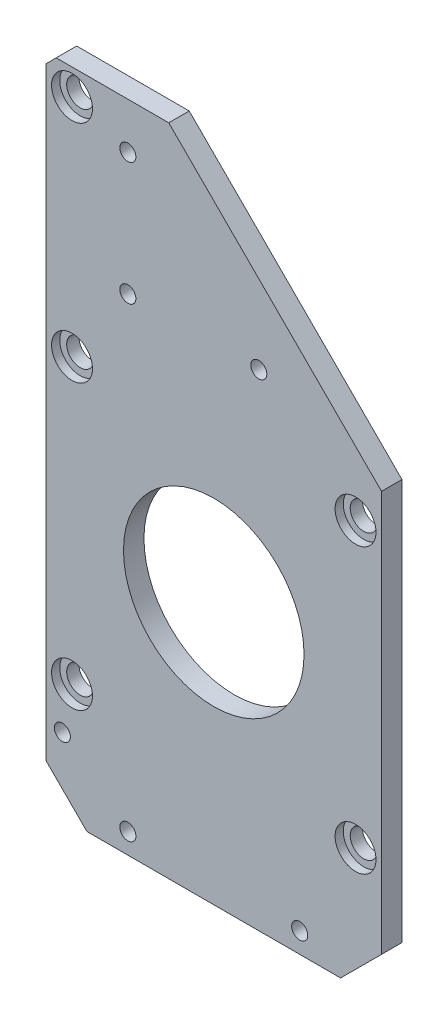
ISO-10303-21;
HEADER;
FILE_DESCRIPTION(('STEP AP214'),'2;1');
FILE_NAME('part.step','',(''),(''),'','','');
FILE_SCHEMA(('AUTOMOTIVE_DESIGN { 1 0 10303 214 1 1 1 1 }'));
ENDSEC;
DATA;
#1=APPLICATION_CONTEXT('core data for automotive mechanical design processes');
#2=APPLICATION_PROTOCOL_DEFINITION('international standard','automotive_design',2000,#1);
#3=PRODUCT_CONTEXT('',#1,'mechanical');
#4=PRODUCT('Part','Part','',(#3));
#5=PRODUCT_RELATED_PRODUCT_CATEGORY('part','',(#4));
#6=PRODUCT_DEFINITION_FORMATION('','',#4);
#7=PRODUCT_DEFINITION_CONTEXT('part definition',#1,'design');
#8=PRODUCT_DEFINITION('design','',#6,#7);
#9=PRODUCT_DEFINITION_SHAPE('','',#8);
#10=(LENGTH_UNIT() NAMED_UNIT(*) SI_UNIT(.MILLI.,.METRE.));
#11=(NAMED_UNIT(*) PLANE_ANGLE_UNIT() SI_UNIT($,.RADIAN.));
#12=(NAMED_UNIT(*) SI_UNIT($,.STERADIAN.) SOLID_ANGLE_UNIT());
#13=UNCERTAINTY_MEASURE_WITH_UNIT(LENGTH_MEASURE(1.E-05),#10,'distance_accuracy_value','');
#14=(GEOMETRIC_REPRESENTATION_CONTEXT(3) GLOBAL_UNCERTAINTY_ASSIGNED_CONTEXT((#13)) GLOBAL_UNIT_ASSIGNED_CONTEXT((#10,
#11,#12)) REPRESENTATION_CONTEXT('',''));
#15=CARTESIAN_POINT('',(0.,0.,0.));
#16=DIRECTION('',(0.,0.,1.));
#17=DIRECTION('',(1.,0.,0.));
#18=AXIS2_PLACEMENT_3D('',#15,#16,#17);
#19=CARTESIAN_POINT('',(-18.8249999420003,2.37849988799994,-0.476250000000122));
#20=DIRECTION('',(0.,0.,0.999999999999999));
#21=DIRECTION('',(-1.,0.,0.));
#22=AXIS2_PLACEMENT_3D('',#19,#20,#21);
#23=PLANE('',#22);
#24=CARTESIAN_POINT('',(-21.999999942,-0.860000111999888,-0.476249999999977));
#25=DIRECTION('',(0.,0.,0.999999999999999));
#26=DIRECTION('',(1.,0.,0.));
#27=AXIS2_PLACEMENT_3D('',#24,#25,#26);
#28=CIRCLE('',#27,2.09550000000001);
#29=CARTESIAN_POINT('',(-19.9044999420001,-0.860000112,-0.476249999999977));
#30=VERTEX_POINT('',#29);
#31=EDGE_CURVE('E187',#30,#30,#28,.T.);
#32=ORIENTED_EDGE('',*,*,#31,.F.);
#33=EDGE_LOOP('',(#32));
#34=FACE_BOUND('',#33,.T.);
#35=CARTESIAN_POINT('',(-21.999999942,-0.860000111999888,-0.476249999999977));
#36=DIRECTION('',(0.,0.,0.999999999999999));
#37=DIRECTION('',(1.,0.,0.));
#38=AXIS2_PLACEMENT_3D('',#35,#36,#37);
#39=CIRCLE('',#38,3.175);
#40=CARTESIAN_POINT('',(-18.8249999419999,-0.860000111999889,-0.476249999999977));
#41=VERTEX_POINT('',#40);
#42=EDGE_CURVE('E105',#41,#41,#39,.F.);
#43=ORIENTED_EDGE('',*,*,#42,.F.);
#44=EDGE_LOOP('',(#43));
#45=FACE_BOUND('',#44,.T.);
#46=ADVANCED_FACE('F30',(#34,#45),#23,.T.);
#47=CARTESIAN_POINT('',(-25.2384998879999,-41.6849999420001,-0.476249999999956));
#48=DIRECTION('',(0.,0.,0.999999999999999));
#49=DIRECTION('',(0.,-1.,0.));
#50=AXIS2_PLACEMENT_3D('',#47,#48,#49);
#51=PLANE('',#50);
#52=CARTESIAN_POINT('',(-21.9999998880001,-44.8599999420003,-0.476250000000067));
#53=DIRECTION('',(0.,0.,0.999999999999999));
#54=DIRECTION('',(1.,0.,0.));
#55=AXIS2_PLACEMENT_3D('',#52,#53,#54);
#56=CIRCLE('',#55,2.09549999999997);
#57=CARTESIAN_POINT('',(-19.9044998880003,-44.8599999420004,-0.476250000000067));
#58=VERTEX_POINT('',#57);
#59=EDGE_CURVE('E184',#58,#58,#56,.T.);
#60=ORIENTED_EDGE('',*,*,#59,.F.);
#61=EDGE_LOOP('',(#60));
#62=FACE_BOUND('',#61,.T.);
#63=CARTESIAN_POINT('',(-21.9999998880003,-44.859999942,-0.476250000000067));
#64=DIRECTION('',(0.,0.,0.999999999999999));
#65=DIRECTION('',(1.,0.,0.));
#66=AXIS2_PLACEMENT_3D('',#63,#64,#65);
#67=CIRCLE('',#66,3.17499999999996);
#68=CARTESIAN_POINT('',(-18.8249998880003,-44.859999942,-0.476250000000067));
#69=VERTEX_POINT('',#68);
#70=EDGE_CURVE('E204',#69,#69,#67,.F.);
#71=ORIENTED_EDGE('',*,*,#70,.F.);
#72=EDGE_LOOP('',(#71));
#73=FACE_BOUND('',#72,.T.);
#74=ADVANCED_FACE('F530',(#62,#73),#51,.T.);
#75=CARTESIAN_POINT('',(18.8249999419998,-48.0984998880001,-0.476249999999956));
#76=DIRECTION('',(0.,0.,0.999999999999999));
#77=DIRECTION('',(1.,0.,0.));
#78=AXIS2_PLACEMENT_3D('',#75,#76,#77);
#79=PLANE('',#78);
#80=CARTESIAN_POINT('',(21.9999999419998,-44.8599998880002,-0.476250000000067));
#81=DIRECTION('',(0.,0.,0.999999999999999));
#82=DIRECTION('',(1.,0.,0.));
#83=AXIS2_PLACEMENT_3D('',#80,#81,#82);
#84=CIRCLE('',#83,2.09550000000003);
#85=CARTESIAN_POINT('',(24.0954999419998,-44.8599998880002,-0.476250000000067));
#86=VERTEX_POINT('',#85);
#87=EDGE_CURVE('E181',#86,#86,#84,.T.);
#88=ORIENTED_EDGE('',*,*,#87,.F.);
#89=EDGE_LOOP('',(#88));
#90=FACE_BOUND('',#89,.T.);
#91=CARTESIAN_POINT('',(21.9999999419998,-44.8599998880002,-0.476250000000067));
#92=DIRECTION('',(0.,0.,0.999999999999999));
#93=DIRECTION('',(1.,0.,0.));
#94=AXIS2_PLACEMENT_3D('',#91,#92,#93);
#95=CIRCLE('',#94,3.17500000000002);
#96=CARTESIAN_POINT('',(25.1749999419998,-44.8599998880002,-0.476250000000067));
#97=VERTEX_POINT('',#96);
#98=EDGE_CURVE('E207',#97,#97,#95,.F.);
#99=ORIENTED_EDGE('',*,*,#98,.F.);
#100=EDGE_LOOP('',(#99));
#101=FACE_BOUND('',#100,.T.);
#102=ADVANCED_FACE('F393',(#90,#101),#79,.T.);
#103=CARTESIAN_POINT('',(25.238499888,-4.03500005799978,-0.476249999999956));
#104=DIRECTION('',(0.,0.,0.999999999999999));
#105=DIRECTION('',(0.,1.,0.));
#106=AXIS2_PLACEMENT_3D('',#103,#104,#105);
#107=PLANE('',#106);
#108=CARTESIAN_POINT('',(21.9999998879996,-0.860000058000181,-0.476250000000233));
#109=DIRECTION('',(0.,0.,0.999999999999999));
#110=DIRECTION('',(1.,0.,0.));
#111=AXIS2_PLACEMENT_3D('',#108,#109,#110);
#112=CIRCLE('',#111,2.09549999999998);
#113=CARTESIAN_POINT('',(24.0954998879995,-0.860000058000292,-0.476250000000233));
#114=VERTEX_POINT('',#113);
#115=EDGE_CURVE('E178',#114,#114,#112,.T.);
#116=ORIENTED_EDGE('',*,*,#115,.F.);
#117=EDGE_LOOP('',(#116));
#118=FACE_BOUND('',#117,.T.);
#119=CARTESIAN_POINT('',(21.9999998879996,-0.860000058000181,-0.476250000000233));
#120=DIRECTION('',(0.,0.,0.999999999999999));
#121=DIRECTION('',(1.,0.,0.));
#122=AXIS2_PLACEMENT_3D('',#119,#120,#121);
#123=CIRCLE('',#122,3.175);
#124=CARTESIAN_POINT('',(25.1749998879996,-0.860000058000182,-0.476250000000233));
#125=VERTEX_POINT('',#124);
#126=EDGE_CURVE('E209',#125,#125,#123,.F.);
#127=ORIENTED_EDGE('',*,*,#126,.F.);
#128=EDGE_LOOP('',(#127));
#129=FACE_BOUND('',#128,.T.);
#130=ADVANCED_FACE('F384',(#118,#129),#107,.T.);
#131=CARTESIAN_POINT('',(-18.8249999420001,37.3034998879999,-0.476249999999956));
#132=DIRECTION('',(0.,0.,0.999999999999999));
#133=DIRECTION('',(-1.,0.,0.));
#134=AXIS2_PLACEMENT_3D('',#131,#132,#133);
#135=PLANE('',#134);
#136=CARTESIAN_POINT('',(-21.999999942,34.0649998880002,-0.476250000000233));
#137=DIRECTION('',(0.,0.,0.999999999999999));
#138=DIRECTION('',(1.,0.,0.));
#139=AXIS2_PLACEMENT_3D('',#136,#137,#138);
#140=CIRCLE('',#139,2.0955);
#141=CARTESIAN_POINT('',(-19.904499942,34.0649998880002,-0.476250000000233));
#142=VERTEX_POINT('',#141);
#143=EDGE_CURVE('E175',#142,#142,#140,.T.);
#144=ORIENTED_EDGE('',*,*,#143,.F.);
#145=EDGE_LOOP('',(#144));
#146=FACE_BOUND('',#145,.T.);
#147=CARTESIAN_POINT('',(-21.999999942,34.0649998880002,-0.476250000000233));
#148=DIRECTION('',(0.,0.,0.999999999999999));
#149=DIRECTION('',(1.,0.,0.));
#150=AXIS2_PLACEMENT_3D('',#147,#148,#149);
#151=CIRCLE('',#150,3.175);
#152=CARTESIAN_POINT('',(-18.824999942,34.0649998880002,-0.476250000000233));
#153=VERTEX_POINT('',#152);
#154=EDGE_CURVE('E34',#153,#153,#151,.F.);
#155=ORIENTED_EDGE('',*,*,#154,.F.);
#156=EDGE_LOOP('',(#155));
#157=FACE_BOUND('',#156,.T.);
#158=ADVANCED_FACE('F380',(#146,#157),#135,.T.);
#159=CARTESIAN_POINT('',(-21.999999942,34.0649998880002,-0.476250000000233));
#160=DIRECTION('',(0.,0.,0.999999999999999));
#161=DIRECTION('',(1.,0.,0.));
#162=AXIS2_PLACEMENT_3D('',#159,#160,#161);
#163=CYLINDRICAL_SURFACE('',#162,3.175);
#164=CARTESIAN_POINT('',(-21.9999999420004,34.0649998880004,0.793749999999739));
#165=DIRECTION('',(0.,0.,0.999999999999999));
#166=DIRECTION('',(1.,0.,0.));
#167=AXIS2_PLACEMENT_3D('',#164,#165,#166);
#168=CIRCLE('',#167,3.175);
#169=CARTESIAN_POINT('',(-18.824999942,34.0649998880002,0.793749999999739));
#170=VERTEX_POINT('',#169);
#171=EDGE_CURVE('E142',#170,#170,#168,.T.);
#172=CARTESIAN_POINT('',(-18.824999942,34.0649998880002,0.793749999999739));
#173=CARTESIAN_POINT('',(-18.824999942,34.0649998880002,0.780520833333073));
#174=CARTESIAN_POINT('',(-18.824999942,34.0649998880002,0.767291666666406));
#175=CARTESIAN_POINT('',(-18.824999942,34.0649998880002,0.740833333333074));
#176=CARTESIAN_POINT('',(-18.824999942,34.0649998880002,0.727604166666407));
#177=CARTESIAN_POINT('',(-18.824999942,34.0649998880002,0.701145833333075));
#178=CARTESIAN_POINT('',(-18.824999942,34.0649998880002,0.687916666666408));
#179=CARTESIAN_POINT('',(-18.824999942,34.0649998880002,0.661458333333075));
#180=CARTESIAN_POINT('',(-18.824999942,34.0649998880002,0.648229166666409));
#181=CARTESIAN_POINT('',(-18.824999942,34.0649998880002,0.621770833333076));
#182=CARTESIAN_POINT('',(-18.824999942,34.0649998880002,0.60854166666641));
#183=CARTESIAN_POINT('',(-18.824999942,34.0649998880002,0.582083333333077));
#184=CARTESIAN_POINT('',(-18.824999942,34.0649998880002,0.568854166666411));
#185=CARTESIAN_POINT('',(-18.824999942,34.0649998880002,0.542395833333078));
#186=CARTESIAN_POINT('',(-18.824999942,34.0649998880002,0.529166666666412));
#187=CARTESIAN_POINT('',(-18.824999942,34.0649998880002,0.502708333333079));
#188=CARTESIAN_POINT('',(-18.824999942,34.0649998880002,0.489479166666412));
#189=CARTESIAN_POINT('',(-18.824999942,34.0649998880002,0.46302083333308));
#190=CARTESIAN_POINT('',(-18.824999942,34.0649998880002,0.449791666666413));
#191=CARTESIAN_POINT('',(-18.824999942,34.0649998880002,0.42333333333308));
#192=CARTESIAN_POINT('',(-18.824999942,34.0649998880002,0.410104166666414));
#193=CARTESIAN_POINT('',(-18.824999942,34.0649998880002,0.383645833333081));
#194=CARTESIAN_POINT('',(-18.824999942,34.0649998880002,0.370416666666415));
#195=CARTESIAN_POINT('',(-18.824999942,34.0649998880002,0.343958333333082));
#196=CARTESIAN_POINT('',(-18.824999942,34.0649998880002,0.330729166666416));
#197=CARTESIAN_POINT('',(-18.824999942,34.0649998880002,0.304270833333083));
#198=CARTESIAN_POINT('',(-18.824999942,34.0649998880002,0.291041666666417));
#199=CARTESIAN_POINT('',(-18.824999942,34.0649998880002,0.264583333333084));
#200=CARTESIAN_POINT('',(-18.824999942,34.0649998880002,0.251354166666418));
#201=CARTESIAN_POINT('',(-18.824999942,34.0649998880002,0.224895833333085));
#202=CARTESIAN_POINT('',(-18.824999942,34.0649998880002,0.211666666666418));
#203=CARTESIAN_POINT('',(-18.824999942,34.0649998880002,0.185208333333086));
#204=CARTESIAN_POINT('',(-18.824999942,34.0649998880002,0.171979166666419));
#205=CARTESIAN_POINT('',(-18.824999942,34.0649998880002,0.145520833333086));
#206=CARTESIAN_POINT('',(-18.824999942,34.0649998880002,0.13229166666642));
#207=CARTESIAN_POINT('',(-18.824999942,34.0649998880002,0.105833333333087));
#208=CARTESIAN_POINT('',(-18.824999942,34.0649998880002,0.092604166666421));
#209=CARTESIAN_POINT('',(-18.824999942,34.0649998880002,0.0661458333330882));
#210=CARTESIAN_POINT('',(-18.824999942,34.0649998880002,0.0529166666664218));
#211=CARTESIAN_POINT('',(-18.824999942,34.0649998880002,0.026458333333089));
#212=CARTESIAN_POINT('',(-18.824999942,34.0649998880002,0.0132291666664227));
#213=CARTESIAN_POINT('',(-18.824999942,34.0649998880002,-0.0132291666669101));
#214=CARTESIAN_POINT('',(-18.824999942,34.0649998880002,-0.0264583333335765));
#215=CARTESIAN_POINT('',(-18.824999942,34.0649998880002,-0.0529166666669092));
#216=CARTESIAN_POINT('',(-18.824999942,34.0649998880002,-0.0661458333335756));
#217=CARTESIAN_POINT('',(-18.824999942,34.0649998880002,-0.0926041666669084));
#218=CARTESIAN_POINT('',(-18.824999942,34.0649998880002,-0.105833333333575));
#219=CARTESIAN_POINT('',(-18.824999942,34.0649998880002,-0.132291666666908));
#220=CARTESIAN_POINT('',(-18.824999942,34.0649998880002,-0.145520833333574));
#221=CARTESIAN_POINT('',(-18.824999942,34.0649998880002,-0.171979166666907));
#222=CARTESIAN_POINT('',(-18.824999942,34.0649998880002,-0.185208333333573));
#223=CARTESIAN_POINT('',(-18.824999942,34.0649998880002,-0.211666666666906));
#224=CARTESIAN_POINT('',(-18.824999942,34.0649998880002,-0.224895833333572));
#225=CARTESIAN_POINT('',(-18.824999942,34.0649998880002,-0.251354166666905));
#226=CARTESIAN_POINT('',(-18.824999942,34.0649998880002,-0.264583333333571));
#227=CARTESIAN_POINT('',(-18.824999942,34.0649998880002,-0.291041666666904));
#228=CARTESIAN_POINT('',(-18.824999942,34.0649998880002,-0.30427083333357));
#229=CARTESIAN_POINT('',(-18.824999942,34.0649998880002,-0.330729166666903));
#230=CARTESIAN_POINT('',(-18.824999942,34.0649998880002,-0.34395833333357));
#231=CARTESIAN_POINT('',(-18.824999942,34.0649998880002,-0.370416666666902));
#232=CARTESIAN_POINT('',(-18.824999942,34.0649998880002,-0.383645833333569));
#233=CARTESIAN_POINT('',(-18.824999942,34.0649998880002,-0.410104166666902));
#234=CARTESIAN_POINT('',(-18.824999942,34.0649998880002,-0.423333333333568));
#235=CARTESIAN_POINT('',(-18.824999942,34.0649998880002,-0.449791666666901));
#236=CARTESIAN_POINT('',(-18.824999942,34.0649998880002,-0.463020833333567));
#237=CARTESIAN_POINT('',(-18.824999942,34.0649998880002,-0.476250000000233));
#238=B_SPLINE_CURVE_WITH_KNOTS('',3,(#172,#173,#174,#175,#176,#177,#178,#179,#180,#181,#182,
#183,#184,#185,#186,#187,#188,#189,#190,#191,#192,#193,#194,#195,#196,#197,#198,#199,#200,#201,
#202,#203,#204,#205,#206,#207,#208,#209,#210,#211,#212,#213,#214,#215,#216,#217,#218,#219,#220,
#221,#222,#223,#224,#225,#226,#227,#228,#229,#230,#231,#232,#233,#234,#235,#236,#237),
.UNSPECIFIED.,.F.,.F.,(4,2,2,2,2,2,2,2,2,2,2,2,2,2,2,2,2,2,2,2,2,2,2,2,2,2,2,2,2,2,2,2,4),(0.,
0.0396874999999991,0.0793749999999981,0.119062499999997,0.158749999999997,0.198437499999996,
0.238124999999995,0.277812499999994,0.317499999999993,0.357187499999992,0.396874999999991,
0.436562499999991,0.47624999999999,0.515937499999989,0.555624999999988,0.595312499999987,
0.634999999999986,0.674687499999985,0.714374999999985,0.754062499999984,0.793749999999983,
0.833437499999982,0.873124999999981,0.91281249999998,0.952499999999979,0.992187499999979,
1.03187499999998,1.07156249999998,1.11124999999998,1.15093749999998,1.19062499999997,
1.23031249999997,1.26999999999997),.UNSPECIFIED.);
#239=EDGE_CURVE('BSEAM383',#170,#153,#238,.T.);
#240=ORIENTED_EDGE('',*,*,#171,.T.);
#241=ORIENTED_EDGE('',*,*,#154,.T.);
#242=ORIENTED_EDGE('',*,*,#239,.T.);
#243=ORIENTED_EDGE('',*,*,#239,.F.);
#244=EDGE_LOOP('',(#240,#242,#241,#243));
#245=FACE_BOUND('',#244,.T.);
#246=ADVANCED_FACE('F383',(#245),#163,.F.);
#247=CARTESIAN_POINT('',(21.9999998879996,-0.860000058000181,-0.476250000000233));
#248=DIRECTION('',(0.,0.,0.999999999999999));
#249=DIRECTION('',(1.,0.,0.));
#250=AXIS2_PLACEMENT_3D('',#247,#248,#249);
#251=CYLINDRICAL_SURFACE('',#250,3.175);
#252=CARTESIAN_POINT('',(21.9999998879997,-0.860000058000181,0.79374999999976));
#253=DIRECTION('',(0.,0.,0.999999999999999));
#254=DIRECTION('',(1.,0.,0.));
#255=AXIS2_PLACEMENT_3D('',#252,#253,#254);
#256=CIRCLE('',#255,3.175);
#257=CARTESIAN_POINT('',(25.1749998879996,-0.860000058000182,0.79374999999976));
#258=VERTEX_POINT('',#257);
#259=EDGE_CURVE('E139',#258,#258,#256,.T.);
#260=CARTESIAN_POINT('',(25.1749998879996,-0.860000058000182,0.79374999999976));
#261=CARTESIAN_POINT('',(25.1749998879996,-0.860000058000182,0.780520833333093));
#262=CARTESIAN_POINT('',(25.1749998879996,-0.860000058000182,0.767291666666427));
#263=CARTESIAN_POINT('',(25.1749998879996,-0.860000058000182,0.740833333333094));
#264=CARTESIAN_POINT('',(25.1749998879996,-0.860000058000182,0.727604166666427));
#265=CARTESIAN_POINT('',(25.1749998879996,-0.860000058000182,0.701145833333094));
#266=CARTESIAN_POINT('',(25.1749998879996,-0.860000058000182,0.687916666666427));
#267=CARTESIAN_POINT('',(25.1749998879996,-0.860000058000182,0.661458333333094));
#268=CARTESIAN_POINT('',(25.1749998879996,-0.860000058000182,0.648229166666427));
#269=CARTESIAN_POINT('',(25.1749998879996,-0.860000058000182,0.621770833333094));
#270=CARTESIAN_POINT('',(25.1749998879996,-0.860000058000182,0.608541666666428));
#271=CARTESIAN_POINT('',(25.1749998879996,-0.860000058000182,0.582083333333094));
#272=CARTESIAN_POINT('',(25.1749998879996,-0.860000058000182,0.568854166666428));
#273=CARTESIAN_POINT('',(25.1749998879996,-0.860000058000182,0.542395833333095));
#274=CARTESIAN_POINT('',(25.1749998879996,-0.860000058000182,0.529166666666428));
#275=CARTESIAN_POINT('',(25.1749998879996,-0.860000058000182,0.502708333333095));
#276=CARTESIAN_POINT('',(25.1749998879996,-0.860000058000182,0.489479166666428));
#277=CARTESIAN_POINT('',(25.1749998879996,-0.860000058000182,0.463020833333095));
#278=CARTESIAN_POINT('',(25.1749998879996,-0.860000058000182,0.449791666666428));
#279=CARTESIAN_POINT('',(25.1749998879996,-0.860000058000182,0.423333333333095));
#280=CARTESIAN_POINT('',(25.1749998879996,-0.860000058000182,0.410104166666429));
#281=CARTESIAN_POINT('',(25.1749998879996,-0.860000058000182,0.383645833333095));
#282=CARTESIAN_POINT('',(25.1749998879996,-0.860000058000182,0.370416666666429));
#283=CARTESIAN_POINT('',(25.1749998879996,-0.860000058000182,0.343958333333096));
#284=CARTESIAN_POINT('',(25.1749998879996,-0.860000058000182,0.330729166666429));
#285=CARTESIAN_POINT('',(25.1749998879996,-0.860000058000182,0.304270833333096));
#286=CARTESIAN_POINT('',(25.1749998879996,-0.860000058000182,0.291041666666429));
#287=CARTESIAN_POINT('',(25.1749998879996,-0.860000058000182,0.264583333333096));
#288=CARTESIAN_POINT('',(25.1749998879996,-0.860000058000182,0.251354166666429));
#289=CARTESIAN_POINT('',(25.1749998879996,-0.860000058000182,0.224895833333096));
#290=CARTESIAN_POINT('',(25.1749998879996,-0.860000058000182,0.21166666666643));
#291=CARTESIAN_POINT('',(25.1749998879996,-0.860000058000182,0.185208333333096));
#292=CARTESIAN_POINT('',(25.1749998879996,-0.860000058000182,0.17197916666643));
#293=CARTESIAN_POINT('',(25.1749998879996,-0.860000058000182,0.145520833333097));
#294=CARTESIAN_POINT('',(25.1749998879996,-0.860000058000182,0.13229166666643));
#295=CARTESIAN_POINT('',(25.1749998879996,-0.860000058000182,0.105833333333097));
#296=CARTESIAN_POINT('',(25.1749998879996,-0.860000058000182,0.0926041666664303));
#297=CARTESIAN_POINT('',(25.1749998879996,-0.860000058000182,0.0661458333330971));
#298=CARTESIAN_POINT('',(25.1749998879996,-0.860000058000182,0.0529166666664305));
#299=CARTESIAN_POINT('',(25.1749998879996,-0.860000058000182,0.0264583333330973));
#300=CARTESIAN_POINT('',(25.1749998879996,-0.860000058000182,0.0132291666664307));
#301=CARTESIAN_POINT('',(25.1749998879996,-0.860000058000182,-0.0132291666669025));
#302=CARTESIAN_POINT('',(25.1749998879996,-0.860000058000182,-0.0264583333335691));
#303=CARTESIAN_POINT('',(25.1749998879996,-0.860000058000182,-0.0529166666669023));
#304=CARTESIAN_POINT('',(25.1749998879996,-0.860000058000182,-0.0661458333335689));
#305=CARTESIAN_POINT('',(25.1749998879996,-0.860000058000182,-0.0926041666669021));
#306=CARTESIAN_POINT('',(25.1749998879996,-0.860000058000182,-0.105833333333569));
#307=CARTESIAN_POINT('',(25.1749998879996,-0.860000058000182,-0.132291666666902));
#308=CARTESIAN_POINT('',(25.1749998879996,-0.860000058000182,-0.145520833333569));
#309=CARTESIAN_POINT('',(25.1749998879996,-0.860000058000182,-0.171979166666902));
#310=CARTESIAN_POINT('',(25.1749998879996,-0.860000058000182,-0.185208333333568));
#311=CARTESIAN_POINT('',(25.1749998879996,-0.860000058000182,-0.211666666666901));
#312=CARTESIAN_POINT('',(25.1749998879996,-0.860000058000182,-0.224895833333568));
#313=CARTESIAN_POINT('',(25.1749998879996,-0.860000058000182,-0.251354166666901));
#314=CARTESIAN_POINT('',(25.1749998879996,-0.860000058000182,-0.264583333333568));
#315=CARTESIAN_POINT('',(25.1749998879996,-0.860000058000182,-0.291041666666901));
#316=CARTESIAN_POINT('',(25.1749998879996,-0.860000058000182,-0.304270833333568));
#317=CARTESIAN_POINT('',(25.1749998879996,-0.860000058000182,-0.330729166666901));
#318=CARTESIAN_POINT('',(25.1749998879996,-0.860000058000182,-0.343958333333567));
#319=CARTESIAN_POINT('',(25.1749998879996,-0.860000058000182,-0.370416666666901));
#320=CARTESIAN_POINT('',(25.1749998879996,-0.860000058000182,-0.383645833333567));
#321=CARTESIAN_POINT('',(25.1749998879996,-0.860000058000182,-0.410104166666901));
#322=CARTESIAN_POINT('',(25.1749998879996,-0.860000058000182,-0.423333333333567));
#323=CARTESIAN_POINT('',(25.1749998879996,-0.860000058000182,-0.4497916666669));
#324=CARTESIAN_POINT('',(25.1749998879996,-0.860000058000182,-0.463020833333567));
#325=CARTESIAN_POINT('',(25.1749998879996,-0.860000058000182,-0.476250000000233));
#326=B_SPLINE_CURVE_WITH_KNOTS('',3,(#260,#261,#262,#263,#264,#265,#266,#267,#268,#269,#270,
#271,#272,#273,#274,#275,#276,#277,#278,#279,#280,#281,#282,#283,#284,#285,#286,#287,#288,#289,
#290,#291,#292,#293,#294,#295,#296,#297,#298,#299,#300,#301,#302,#303,#304,#305,#306,#307,#308,
#309,#310,#311,#312,#313,#314,#315,#316,#317,#318,#319,#320,#321,#322,#323,#324,#325),
.UNSPECIFIED.,.F.,.F.,(4,2,2,2,2,2,2,2,2,2,2,2,2,2,2,2,2,2,2,2,2,2,2,2,2,2,2,2,2,2,2,2,4),(0.,
0.0396874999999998,0.0793749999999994,0.119062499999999,0.158749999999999,0.198437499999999,
0.238124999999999,0.277812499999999,0.317499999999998,0.357187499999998,0.396874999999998,
0.436562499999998,0.476249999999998,0.515937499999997,0.555624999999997,0.595312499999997,
0.634999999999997,0.674687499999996,0.714374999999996,0.754062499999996,0.793749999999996,
0.833437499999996,0.873124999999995,0.912812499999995,0.952499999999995,0.992187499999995,
1.03187499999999,1.07156249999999,1.11124999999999,1.15093749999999,1.19062499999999,
1.23031249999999,1.26999999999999),.UNSPECIFIED.);
#327=EDGE_CURVE('BSEAM390',#258,#125,#326,.T.);
#328=ORIENTED_EDGE('',*,*,#259,.T.);
#329=ORIENTED_EDGE('',*,*,#126,.T.);
#330=ORIENTED_EDGE('',*,*,#327,.T.);
#331=ORIENTED_EDGE('',*,*,#327,.F.);
#332=EDGE_LOOP('',(#328,#330,#329,#331));
#333=FACE_BOUND('',#332,.T.);
#334=ADVANCED_FACE('F390',(#333),#251,.F.);
#335=CARTESIAN_POINT('',(21.9999999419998,-44.8599998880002,-0.476250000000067));
#336=DIRECTION('',(0.,0.,0.999999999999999));
#337=DIRECTION('',(1.,0.,0.));
#338=AXIS2_PLACEMENT_3D('',#335,#336,#337);
#339=CYLINDRICAL_SURFACE('',#338,3.17500000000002);
#340=CARTESIAN_POINT('',(21.9999999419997,-44.8599998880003,0.793749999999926));
#341=DIRECTION('',(0.,0.,0.999999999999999));
#342=DIRECTION('',(1.,0.,0.));
#343=AXIS2_PLACEMENT_3D('',#340,#341,#342);
#344=CIRCLE('',#343,3.17500000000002);
#345=CARTESIAN_POINT('',(25.1749999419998,-44.8599998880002,0.793749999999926));
#346=VERTEX_POINT('',#345);
#347=EDGE_CURVE('E136',#346,#346,#344,.T.);
#348=CARTESIAN_POINT('',(25.1749999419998,-44.8599998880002,0.793749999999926));
#349=CARTESIAN_POINT('',(25.1749999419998,-44.8599998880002,0.78052083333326));
#350=CARTESIAN_POINT('',(25.1749999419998,-44.8599998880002,0.767291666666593));
#351=CARTESIAN_POINT('',(25.1749999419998,-44.8599998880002,0.74083333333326));
#352=CARTESIAN_POINT('',(25.1749999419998,-44.8599998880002,0.727604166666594));
#353=CARTESIAN_POINT('',(25.1749999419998,-44.8599998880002,0.70114583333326));
#354=CARTESIAN_POINT('',(25.1749999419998,-44.8599998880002,0.687916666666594));
#355=CARTESIAN_POINT('',(25.1749999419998,-44.8599998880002,0.66145833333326));
#356=CARTESIAN_POINT('',(25.1749999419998,-44.8599998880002,0.648229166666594));
#357=CARTESIAN_POINT('',(25.1749999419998,-44.8599998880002,0.621770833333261));
#358=CARTESIAN_POINT('',(25.1749999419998,-44.8599998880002,0.608541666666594));
#359=CARTESIAN_POINT('',(25.1749999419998,-44.8599998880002,0.582083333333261));
#360=CARTESIAN_POINT('',(25.1749999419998,-44.8599998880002,0.568854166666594));
#361=CARTESIAN_POINT('',(25.1749999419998,-44.8599998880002,0.542395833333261));
#362=CARTESIAN_POINT('',(25.1749999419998,-44.8599998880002,0.529166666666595));
#363=CARTESIAN_POINT('',(25.1749999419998,-44.8599998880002,0.502708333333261));
#364=CARTESIAN_POINT('',(25.1749999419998,-44.8599998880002,0.489479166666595));
#365=CARTESIAN_POINT('',(25.1749999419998,-44.8599998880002,0.463020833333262));
#366=CARTESIAN_POINT('',(25.1749999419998,-44.8599998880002,0.449791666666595));
#367=CARTESIAN_POINT('',(25.1749999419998,-44.8599998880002,0.423333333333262));
#368=CARTESIAN_POINT('',(25.1749999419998,-44.8599998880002,0.410104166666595));
#369=CARTESIAN_POINT('',(25.1749999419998,-44.8599998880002,0.383645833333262));
#370=CARTESIAN_POINT('',(25.1749999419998,-44.8599998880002,0.370416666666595));
#371=CARTESIAN_POINT('',(25.1749999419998,-44.8599998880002,0.343958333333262));
#372=CARTESIAN_POINT('',(25.1749999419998,-44.8599998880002,0.330729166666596));
#373=CARTESIAN_POINT('',(25.1749999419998,-44.8599998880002,0.304270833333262));
#374=CARTESIAN_POINT('',(25.1749999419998,-44.8599998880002,0.291041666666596));
#375=CARTESIAN_POINT('',(25.1749999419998,-44.8599998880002,0.264583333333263));
#376=CARTESIAN_POINT('',(25.1749999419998,-44.8599998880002,0.251354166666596));
#377=CARTESIAN_POINT('',(25.1749999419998,-44.8599998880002,0.224895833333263));
#378=CARTESIAN_POINT('',(25.1749999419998,-44.8599998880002,0.211666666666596));
#379=CARTESIAN_POINT('',(25.1749999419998,-44.8599998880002,0.185208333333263));
#380=CARTESIAN_POINT('',(25.1749999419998,-44.8599998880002,0.171979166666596));
#381=CARTESIAN_POINT('',(25.1749999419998,-44.8599998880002,0.145520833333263));
#382=CARTESIAN_POINT('',(25.1749999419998,-44.8599998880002,0.132291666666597));
#383=CARTESIAN_POINT('',(25.1749999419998,-44.8599998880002,0.105833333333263));
#384=CARTESIAN_POINT('',(25.1749999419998,-44.8599998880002,0.0926041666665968));
#385=CARTESIAN_POINT('',(25.1749999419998,-44.8599998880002,0.0661458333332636));
#386=CARTESIAN_POINT('',(25.1749999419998,-44.8599998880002,0.052916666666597));
#387=CARTESIAN_POINT('',(25.1749999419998,-44.8599998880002,0.0264583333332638));
#388=CARTESIAN_POINT('',(25.1749999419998,-44.8599998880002,0.0132291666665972));
#389=CARTESIAN_POINT('',(25.1749999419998,-44.8599998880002,-0.013229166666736));
#390=CARTESIAN_POINT('',(25.1749999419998,-44.8599998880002,-0.0264583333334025));
#391=CARTESIAN_POINT('',(25.1749999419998,-44.8599998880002,-0.0529166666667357));
#392=CARTESIAN_POINT('',(25.1749999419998,-44.8599998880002,-0.0661458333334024));
#393=CARTESIAN_POINT('',(25.1749999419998,-44.8599998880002,-0.0926041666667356));
#394=CARTESIAN_POINT('',(25.1749999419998,-44.8599998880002,-0.105833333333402));
#395=CARTESIAN_POINT('',(25.1749999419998,-44.8599998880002,-0.132291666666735));
#396=CARTESIAN_POINT('',(25.1749999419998,-44.8599998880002,-0.145520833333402));
#397=CARTESIAN_POINT('',(25.1749999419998,-44.8599998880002,-0.171979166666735));
#398=CARTESIAN_POINT('',(25.1749999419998,-44.8599998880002,-0.185208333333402));
#399=CARTESIAN_POINT('',(25.1749999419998,-44.8599998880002,-0.211666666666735));
#400=CARTESIAN_POINT('',(25.1749999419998,-44.8599998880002,-0.224895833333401));
#401=CARTESIAN_POINT('',(25.1749999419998,-44.8599998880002,-0.251354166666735));
#402=CARTESIAN_POINT('',(25.1749999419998,-44.8599998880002,-0.264583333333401));
#403=CARTESIAN_POINT('',(25.1749999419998,-44.8599998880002,-0.291041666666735));
#404=CARTESIAN_POINT('',(25.1749999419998,-44.8599998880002,-0.304270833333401));
#405=CARTESIAN_POINT('',(25.1749999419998,-44.8599998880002,-0.330729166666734));
#406=CARTESIAN_POINT('',(25.1749999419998,-44.8599998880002,-0.343958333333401));
#407=CARTESIAN_POINT('',(25.1749999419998,-44.8599998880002,-0.370416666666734));
#408=CARTESIAN_POINT('',(25.1749999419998,-44.8599998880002,-0.383645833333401));
#409=CARTESIAN_POINT('',(25.1749999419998,-44.8599998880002,-0.410104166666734));
#410=CARTESIAN_POINT('',(25.1749999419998,-44.8599998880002,-0.423333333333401));
#411=CARTESIAN_POINT('',(25.1749999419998,-44.8599998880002,-0.449791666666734));
#412=CARTESIAN_POINT('',(25.1749999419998,-44.8599998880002,-0.4630208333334));
#413=CARTESIAN_POINT('',(25.1749999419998,-44.8599998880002,-0.476250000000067));
#414=B_SPLINE_CURVE_WITH_KNOTS('',3,(#348,#349,#350,#351,#352,#353,#354,#355,#356,#357,#358,
#359,#360,#361,#362,#363,#364,#365,#366,#367,#368,#369,#370,#371,#372,#373,#374,#375,#376,#377,
#378,#379,#380,#381,#382,#383,#384,#385,#386,#387,#388,#389,#390,#391,#392,#393,#394,#395,#396,
#397,#398,#399,#400,#401,#402,#403,#404,#405,#406,#407,#408,#409,#410,#411,#412,#413),
.UNSPECIFIED.,.F.,.F.,(4,2,2,2,2,2,2,2,2,2,2,2,2,2,2,2,2,2,2,2,2,2,2,2,2,2,2,2,2,2,2,2,4),(0.,
0.0396874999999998,0.0793749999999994,0.119062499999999,0.158749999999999,0.198437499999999,
0.238124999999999,0.277812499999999,0.317499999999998,0.357187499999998,0.396874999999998,
0.436562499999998,0.476249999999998,0.515937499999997,0.555624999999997,0.595312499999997,
0.634999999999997,0.674687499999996,0.714374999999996,0.754062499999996,0.793749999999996,
0.833437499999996,0.873124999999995,0.912812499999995,0.952499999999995,0.992187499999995,
1.03187499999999,1.07156249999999,1.11124999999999,1.15093749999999,1.19062499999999,
1.23031249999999,1.26999999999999),.UNSPECIFIED.);
#415=EDGE_CURVE('BSEAM400',#346,#97,#414,.T.);
#416=ORIENTED_EDGE('',*,*,#347,.T.);
#417=ORIENTED_EDGE('',*,*,#98,.T.);
#418=ORIENTED_EDGE('',*,*,#415,.T.);
#419=ORIENTED_EDGE('',*,*,#415,.F.);
#420=EDGE_LOOP('',(#416,#418,#417,#419));
#421=FACE_BOUND('',#420,.T.);
#422=ADVANCED_FACE('F400',(#421),#339,.F.);
#423=CARTESIAN_POINT('',(-21.9999998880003,-44.859999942,-0.476250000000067));
#424=DIRECTION('',(0.,0.,0.999999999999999));
#425=DIRECTION('',(1.,0.,0.));
#426=AXIS2_PLACEMENT_3D('',#423,#424,#425);
#427=CYLINDRICAL_SURFACE('',#426,3.17499999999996);
#428=CARTESIAN_POINT('',(-21.9999998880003,-44.8599999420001,0.793749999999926));
#429=DIRECTION('',(0.,0.,0.999999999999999));
#430=DIRECTION('',(1.,0.,0.));
#431=AXIS2_PLACEMENT_3D('',#428,#429,#430);
#432=CIRCLE('',#431,3.17499999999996);
#433=CARTESIAN_POINT('',(-18.8249998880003,-44.859999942,0.793749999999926));
#434=VERTEX_POINT('',#433);
#435=EDGE_CURVE('E133',#434,#434,#432,.T.);
#436=CARTESIAN_POINT('',(-18.8249998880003,-44.859999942,0.793749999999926));
#437=CARTESIAN_POINT('',(-18.8249998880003,-44.859999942,0.78052083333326));
#438=CARTESIAN_POINT('',(-18.8249998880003,-44.859999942,0.767291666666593));
#439=CARTESIAN_POINT('',(-18.8249998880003,-44.859999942,0.74083333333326));
#440=CARTESIAN_POINT('',(-18.8249998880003,-44.859999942,0.727604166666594));
#441=CARTESIAN_POINT('',(-18.8249998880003,-44.859999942,0.70114583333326));
#442=CARTESIAN_POINT('',(-18.8249998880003,-44.859999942,0.687916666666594));
#443=CARTESIAN_POINT('',(-18.8249998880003,-44.859999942,0.66145833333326));
#444=CARTESIAN_POINT('',(-18.8249998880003,-44.859999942,0.648229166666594));
#445=CARTESIAN_POINT('',(-18.8249998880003,-44.859999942,0.621770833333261));
#446=CARTESIAN_POINT('',(-18.8249998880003,-44.859999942,0.608541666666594));
#447=CARTESIAN_POINT('',(-18.8249998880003,-44.859999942,0.582083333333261));
#448=CARTESIAN_POINT('',(-18.8249998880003,-44.859999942,0.568854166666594));
#449=CARTESIAN_POINT('',(-18.8249998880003,-44.859999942,0.542395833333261));
#450=CARTESIAN_POINT('',(-18.8249998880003,-44.859999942,0.529166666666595));
#451=CARTESIAN_POINT('',(-18.8249998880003,-44.859999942,0.502708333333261));
#452=CARTESIAN_POINT('',(-18.8249998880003,-44.859999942,0.489479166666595));
#453=CARTESIAN_POINT('',(-18.8249998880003,-44.859999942,0.463020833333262));
#454=CARTESIAN_POINT('',(-18.8249998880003,-44.859999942,0.449791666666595));
#455=CARTESIAN_POINT('',(-18.8249998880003,-44.859999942,0.423333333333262));
#456=CARTESIAN_POINT('',(-18.8249998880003,-44.859999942,0.410104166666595));
#457=CARTESIAN_POINT('',(-18.8249998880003,-44.859999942,0.383645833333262));
#458=CARTESIAN_POINT('',(-18.8249998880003,-44.859999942,0.370416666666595));
#459=CARTESIAN_POINT('',(-18.8249998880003,-44.859999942,0.343958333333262));
#460=CARTESIAN_POINT('',(-18.8249998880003,-44.859999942,0.330729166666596));
#461=CARTESIAN_POINT('',(-18.8249998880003,-44.859999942,0.304270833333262));
#462=CARTESIAN_POINT('',(-18.8249998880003,-44.859999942,0.291041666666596));
#463=CARTESIAN_POINT('',(-18.8249998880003,-44.859999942,0.264583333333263));
#464=CARTESIAN_POINT('',(-18.8249998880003,-44.859999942,0.251354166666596));
#465=CARTESIAN_POINT('',(-18.8249998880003,-44.859999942,0.224895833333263));
#466=CARTESIAN_POINT('',(-18.8249998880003,-44.859999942,0.211666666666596));
#467=CARTESIAN_POINT('',(-18.8249998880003,-44.859999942,0.185208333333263));
#468=CARTESIAN_POINT('',(-18.8249998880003,-44.859999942,0.171979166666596));
#469=CARTESIAN_POINT('',(-18.8249998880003,-44.859999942,0.145520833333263));
#470=CARTESIAN_POINT('',(-18.8249998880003,-44.859999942,0.132291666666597));
#471=CARTESIAN_POINT('',(-18.8249998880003,-44.859999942,0.105833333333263));
#472=CARTESIAN_POINT('',(-18.8249998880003,-44.859999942,0.0926041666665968));
#473=CARTESIAN_POINT('',(-18.8249998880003,-44.859999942,0.0661458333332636));
#474=CARTESIAN_POINT('',(-18.8249998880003,-44.859999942,0.052916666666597));
#475=CARTESIAN_POINT('',(-18.8249998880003,-44.859999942,0.0264583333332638));
#476=CARTESIAN_POINT('',(-18.8249998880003,-44.859999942,0.0132291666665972));
#477=CARTESIAN_POINT('',(-18.8249998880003,-44.859999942,-0.013229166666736));
#478=CARTESIAN_POINT('',(-18.8249998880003,-44.859999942,-0.0264583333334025));
#479=CARTESIAN_POINT('',(-18.8249998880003,-44.859999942,-0.0529166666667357));
#480=CARTESIAN_POINT('',(-18.8249998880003,-44.859999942,-0.0661458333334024));
#481=CARTESIAN_POINT('',(-18.8249998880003,-44.859999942,-0.0926041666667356));
#482=CARTESIAN_POINT('',(-18.8249998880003,-44.859999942,-0.105833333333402));
#483=CARTESIAN_POINT('',(-18.8249998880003,-44.859999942,-0.132291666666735));
#484=CARTESIAN_POINT('',(-18.8249998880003,-44.859999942,-0.145520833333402));
#485=CARTESIAN_POINT('',(-18.8249998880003,-44.859999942,-0.171979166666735));
#486=CARTESIAN_POINT('',(-18.8249998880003,-44.859999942,-0.185208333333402));
#487=CARTESIAN_POINT('',(-18.8249998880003,-44.859999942,-0.211666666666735));
#488=CARTESIAN_POINT('',(-18.8249998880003,-44.859999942,-0.224895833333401));
#489=CARTESIAN_POINT('',(-18.8249998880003,-44.859999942,-0.251354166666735));
#490=CARTESIAN_POINT('',(-18.8249998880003,-44.859999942,-0.264583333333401));
#491=CARTESIAN_POINT('',(-18.8249998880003,-44.859999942,-0.291041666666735));
#492=CARTESIAN_POINT('',(-18.8249998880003,-44.859999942,-0.304270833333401));
#493=CARTESIAN_POINT('',(-18.8249998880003,-44.859999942,-0.330729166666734));
#494=CARTESIAN_POINT('',(-18.8249998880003,-44.859999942,-0.343958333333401));
#495=CARTESIAN_POINT('',(-18.8249998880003,-44.859999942,-0.370416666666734));
#496=CARTESIAN_POINT('',(-18.8249998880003,-44.859999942,-0.383645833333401));
#497=CARTESIAN_POINT('',(-18.8249998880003,-44.859999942,-0.410104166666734));
#498=CARTESIAN_POINT('',(-18.8249998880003,-44.859999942,-0.423333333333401));
#499=CARTESIAN_POINT('',(-18.8249998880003,-44.859999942,-0.449791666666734));
#500=CARTESIAN_POINT('',(-18.8249998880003,-44.859999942,-0.4630208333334));
#501=CARTESIAN_POINT('',(-18.8249998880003,-44.859999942,-0.476250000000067));
#502=B_SPLINE_CURVE_WITH_KNOTS('',3,(#436,#437,#438,#439,#440,#441,#442,#443,#444,#445,#446,
#447,#448,#449,#450,#451,#452,#453,#454,#455,#456,#457,#458,#459,#460,#461,#462,#463,#464,#465,
#466,#467,#468,#469,#470,#471,#472,#473,#474,#475,#476,#477,#478,#479,#480,#481,#482,#483,#484,
#485,#486,#487,#488,#489,#490,#491,#492,#493,#494,#495,#496,#497,#498,#499,#500,#501),
.UNSPECIFIED.,.F.,.F.,(4,2,2,2,2,2,2,2,2,2,2,2,2,2,2,2,2,2,2,2,2,2,2,2,2,2,2,2,2,2,2,2,4),(0.,
0.0396874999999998,0.0793749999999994,0.119062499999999,0.158749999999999,0.198437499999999,
0.238124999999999,0.277812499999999,0.317499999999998,0.357187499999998,0.396874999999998,
0.436562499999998,0.476249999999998,0.515937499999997,0.555624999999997,0.595312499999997,
0.634999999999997,0.674687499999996,0.714374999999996,0.754062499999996,0.793749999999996,
0.833437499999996,0.873124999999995,0.912812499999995,0.952499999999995,0.992187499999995,
1.03187499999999,1.07156249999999,1.11124999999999,1.15093749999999,1.19062499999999,
1.23031249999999,1.26999999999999),.UNSPECIFIED.);
#503=EDGE_CURVE('BSEAM404',#434,#69,#502,.T.);
#504=ORIENTED_EDGE('',*,*,#435,.T.);
#505=ORIENTED_EDGE('',*,*,#70,.T.);
#506=ORIENTED_EDGE('',*,*,#503,.T.);
#507=ORIENTED_EDGE('',*,*,#503,.F.);
#508=EDGE_LOOP('',(#504,#506,#505,#507));
#509=FACE_BOUND('',#508,.T.);
#510=ADVANCED_FACE('F404',(#509),#427,.F.);
#511=CARTESIAN_POINT('',(-21.999999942,-0.860000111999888,-0.476249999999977));
#512=DIRECTION('',(0.,0.,0.999999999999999));
#513=DIRECTION('',(1.,0.,0.));
#514=AXIS2_PLACEMENT_3D('',#511,#512,#513);
#515=CYLINDRICAL_SURFACE('',#514,3.175);
#516=CARTESIAN_POINT('',(-21.999999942,-0.860000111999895,0.793750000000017));
#517=DIRECTION('',(0.,0.,0.999999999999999));
#518=DIRECTION('',(1.,0.,0.));
#519=AXIS2_PLACEMENT_3D('',#516,#517,#518);
#520=CIRCLE('',#519,3.175);
#521=CARTESIAN_POINT('',(-18.8249999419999,-0.860000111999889,0.793750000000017));
#522=VERTEX_POINT('',#521);
#523=EDGE_CURVE('E130',#522,#522,#520,.T.);
#524=CARTESIAN_POINT('',(-18.8249999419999,-0.860000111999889,0.793750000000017));
#525=CARTESIAN_POINT('',(-18.8249999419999,-0.860000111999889,0.78052083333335));
#526=CARTESIAN_POINT('',(-18.8249999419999,-0.860000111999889,0.767291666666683));
#527=CARTESIAN_POINT('',(-18.8249999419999,-0.860000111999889,0.74083333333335));
#528=CARTESIAN_POINT('',(-18.8249999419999,-0.860000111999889,0.727604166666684));
#529=CARTESIAN_POINT('',(-18.8249999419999,-0.860000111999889,0.701145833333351));
#530=CARTESIAN_POINT('',(-18.8249999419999,-0.860000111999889,0.687916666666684));
#531=CARTESIAN_POINT('',(-18.8249999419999,-0.860000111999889,0.661458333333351));
#532=CARTESIAN_POINT('',(-18.8249999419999,-0.860000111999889,0.648229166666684));
#533=CARTESIAN_POINT('',(-18.8249999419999,-0.860000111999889,0.621770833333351));
#534=CARTESIAN_POINT('',(-18.8249999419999,-0.860000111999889,0.608541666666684));
#535=CARTESIAN_POINT('',(-18.8249999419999,-0.860000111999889,0.582083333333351));
#536=CARTESIAN_POINT('',(-18.8249999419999,-0.860000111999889,0.568854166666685));
#537=CARTESIAN_POINT('',(-18.8249999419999,-0.860000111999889,0.542395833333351));
#538=CARTESIAN_POINT('',(-18.8249999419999,-0.860000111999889,0.529166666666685));
#539=CARTESIAN_POINT('',(-18.8249999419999,-0.860000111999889,0.502708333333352));
#540=CARTESIAN_POINT('',(-18.8249999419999,-0.860000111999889,0.489479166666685));
#541=CARTESIAN_POINT('',(-18.8249999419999,-0.860000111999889,0.463020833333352));
#542=CARTESIAN_POINT('',(-18.8249999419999,-0.860000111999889,0.449791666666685));
#543=CARTESIAN_POINT('',(-18.8249999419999,-0.860000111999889,0.423333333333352));
#544=CARTESIAN_POINT('',(-18.8249999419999,-0.860000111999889,0.410104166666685));
#545=CARTESIAN_POINT('',(-18.8249999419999,-0.860000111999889,0.383645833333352));
#546=CARTESIAN_POINT('',(-18.8249999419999,-0.860000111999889,0.370416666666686));
#547=CARTESIAN_POINT('',(-18.8249999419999,-0.860000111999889,0.343958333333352));
#548=CARTESIAN_POINT('',(-18.8249999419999,-0.860000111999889,0.330729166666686));
#549=CARTESIAN_POINT('',(-18.8249999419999,-0.860000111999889,0.304270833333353));
#550=CARTESIAN_POINT('',(-18.8249999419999,-0.860000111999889,0.291041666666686));
#551=CARTESIAN_POINT('',(-18.8249999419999,-0.860000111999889,0.264583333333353));
#552=CARTESIAN_POINT('',(-18.8249999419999,-0.860000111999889,0.251354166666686));
#553=CARTESIAN_POINT('',(-18.8249999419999,-0.860000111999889,0.224895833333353));
#554=CARTESIAN_POINT('',(-18.8249999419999,-0.860000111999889,0.211666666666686));
#555=CARTESIAN_POINT('',(-18.8249999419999,-0.860000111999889,0.185208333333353));
#556=CARTESIAN_POINT('',(-18.8249999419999,-0.860000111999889,0.171979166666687));
#557=CARTESIAN_POINT('',(-18.8249999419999,-0.860000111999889,0.145520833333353));
#558=CARTESIAN_POINT('',(-18.8249999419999,-0.860000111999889,0.132291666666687));
#559=CARTESIAN_POINT('',(-18.8249999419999,-0.860000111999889,0.105833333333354));
#560=CARTESIAN_POINT('',(-18.8249999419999,-0.860000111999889,0.092604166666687));
#561=CARTESIAN_POINT('',(-18.8249999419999,-0.860000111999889,0.0661458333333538));
#562=CARTESIAN_POINT('',(-18.8249999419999,-0.860000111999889,0.0529166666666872));
#563=CARTESIAN_POINT('',(-18.8249999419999,-0.860000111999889,0.026458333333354));
#564=CARTESIAN_POINT('',(-18.8249999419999,-0.860000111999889,0.0132291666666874));
#565=CARTESIAN_POINT('',(-18.8249999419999,-0.860000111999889,-0.0132291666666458));
#566=CARTESIAN_POINT('',(-18.8249999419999,-0.860000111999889,-0.0264583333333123));
#567=CARTESIAN_POINT('',(-18.8249999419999,-0.860000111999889,-0.0529166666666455));
#568=CARTESIAN_POINT('',(-18.8249999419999,-0.860000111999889,-0.0661458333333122));
#569=CARTESIAN_POINT('',(-18.8249999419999,-0.860000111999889,-0.0926041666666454));
#570=CARTESIAN_POINT('',(-18.8249999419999,-0.860000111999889,-0.105833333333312));
#571=CARTESIAN_POINT('',(-18.8249999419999,-0.860000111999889,-0.132291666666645));
#572=CARTESIAN_POINT('',(-18.8249999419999,-0.860000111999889,-0.145520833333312));
#573=CARTESIAN_POINT('',(-18.8249999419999,-0.860000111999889,-0.171979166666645));
#574=CARTESIAN_POINT('',(-18.8249999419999,-0.860000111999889,-0.185208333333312));
#575=CARTESIAN_POINT('',(-18.8249999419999,-0.860000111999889,-0.211666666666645));
#576=CARTESIAN_POINT('',(-18.8249999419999,-0.860000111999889,-0.224895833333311));
#577=CARTESIAN_POINT('',(-18.8249999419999,-0.860000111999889,-0.251354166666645));
#578=CARTESIAN_POINT('',(-18.8249999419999,-0.860000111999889,-0.264583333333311));
#579=CARTESIAN_POINT('',(-18.8249999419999,-0.860000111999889,-0.291041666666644));
#580=CARTESIAN_POINT('',(-18.8249999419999,-0.860000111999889,-0.304270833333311));
#581=CARTESIAN_POINT('',(-18.8249999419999,-0.860000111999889,-0.330729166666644));
#582=CARTESIAN_POINT('',(-18.8249999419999,-0.860000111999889,-0.343958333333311));
#583=CARTESIAN_POINT('',(-18.8249999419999,-0.860000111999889,-0.370416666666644));
#584=CARTESIAN_POINT('',(-18.8249999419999,-0.860000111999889,-0.383645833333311));
#585=CARTESIAN_POINT('',(-18.8249999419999,-0.860000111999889,-0.410104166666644));
#586=CARTESIAN_POINT('',(-18.8249999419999,-0.860000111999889,-0.42333333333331));
#587=CARTESIAN_POINT('',(-18.8249999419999,-0.860000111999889,-0.449791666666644));
#588=CARTESIAN_POINT('',(-18.8249999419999,-0.860000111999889,-0.46302083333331));
#589=CARTESIAN_POINT('',(-18.8249999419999,-0.860000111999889,-0.476249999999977));
#590=B_SPLINE_CURVE_WITH_KNOTS('',3,(#524,#525,#526,#527,#528,#529,#530,#531,#532,#533,#534,
#535,#536,#537,#538,#539,#540,#541,#542,#543,#544,#545,#546,#547,#548,#549,#550,#551,#552,#553,
#554,#555,#556,#557,#558,#559,#560,#561,#562,#563,#564,#565,#566,#567,#568,#569,#570,#571,#572,
#573,#574,#575,#576,#577,#578,#579,#580,#581,#582,#583,#584,#585,#586,#587,#588,#589),
.UNSPECIFIED.,.F.,.F.,(4,2,2,2,2,2,2,2,2,2,2,2,2,2,2,2,2,2,2,2,2,2,2,2,2,2,2,2,2,2,2,2,4),(0.,
0.0396874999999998,0.0793749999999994,0.119062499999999,0.158749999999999,0.198437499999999,
0.238124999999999,0.277812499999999,0.317499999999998,0.357187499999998,0.396874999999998,
0.436562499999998,0.476249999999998,0.515937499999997,0.555624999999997,0.595312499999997,
0.634999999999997,0.674687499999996,0.714374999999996,0.754062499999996,0.793749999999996,
0.833437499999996,0.873124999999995,0.912812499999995,0.952499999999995,0.992187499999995,
1.03187499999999,1.07156249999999,1.11124999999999,1.15093749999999,1.19062499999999,
1.23031249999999,1.26999999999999),.UNSPECIFIED.);
#591=EDGE_CURVE('BSEAM408',#522,#41,#590,.T.);
#592=ORIENTED_EDGE('',*,*,#523,.T.);
#593=ORIENTED_EDGE('',*,*,#42,.T.);
#594=ORIENTED_EDGE('',*,*,#591,.T.);
#595=ORIENTED_EDGE('',*,*,#591,.F.);
#596=EDGE_LOOP('',(#592,#594,#593,#595));
#597=FACE_BOUND('',#596,.T.);
#598=ADVANCED_FACE('F408',(#597),#515,.F.);
#599=CARTESIAN_POINT('',(-26.035,36.5124999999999,-2.38125));
#600=DIRECTION('',(-0.707106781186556,0.707106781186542,0.));
#601=DIRECTION('',(0.,0.,0.999999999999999));
#602=AXIS2_PLACEMENT_3D('',#599,#600,#601);
#603=PLANE('',#602);
#604=DIRECTION('',(0.707106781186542,0.707106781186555,0.));
#605=VECTOR('',#604,1.);
#606=CARTESIAN_POINT('',(-26.035,36.5124999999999,-2.38125));
#607=LINE('',#606,#605);
#608=CARTESIAN_POINT('',(-26.035,36.5124999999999,-2.38125));
#609=VERTEX_POINT('',#608);
#610=CARTESIAN_POINT('',(-24.4475000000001,38.0999999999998,-2.38125000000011));
#611=VERTEX_POINT('',#610);
#612=EDGE_CURVE('E97',#609,#611,#607,.T.);
#613=ORIENTED_EDGE('',*,*,#612,.F.);
#614=DIRECTION('',(0.,0.,0.999999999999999));
#615=VECTOR('',#614,1.);
#616=CARTESIAN_POINT('',(-26.035,36.5124999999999,-2.38125));
#617=LINE('',#616,#615);
#618=CARTESIAN_POINT('',(-26.0349999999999,36.5124999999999,0.793749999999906));
#619=VERTEX_POINT('',#618);
#620=EDGE_CURVE('E191',#619,#609,#617,.F.);
#621=ORIENTED_EDGE('',*,*,#620,.F.);
#622=DIRECTION('',(-0.707106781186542,-0.707106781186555,0.));
#623=VECTOR('',#622,1.);
#624=CARTESIAN_POINT('',(-24.4475000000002,38.1000000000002,0.793749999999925));
#625=LINE('',#624,#623);
#626=CARTESIAN_POINT('',(-24.4475000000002,38.1000000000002,0.793749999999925));
#627=VERTEX_POINT('',#626);
#628=EDGE_CURVE('E100',#627,#619,#625,.T.);
#629=ORIENTED_EDGE('',*,*,#628,.F.);
#630=DIRECTION('',(0.,0.,0.999999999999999));
#631=VECTOR('',#630,1.);
#632=CARTESIAN_POINT('',(-24.4475000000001,38.0999999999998,-2.38125000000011));
#633=LINE('',#632,#631);
#634=EDGE_CURVE('E93',#611,#627,#633,.T.);
#635=ORIENTED_EDGE('',*,*,#634,.F.);
#636=EDGE_LOOP('',(#613,#621,#629,#635));
#637=FACE_BOUND('',#636,.T.);
#638=ADVANCED_FACE('F95',(#637),#603,.T.);
#639=CARTESIAN_POINT('',(-24.4475000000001,38.0999999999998,-2.38125000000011));
#640=DIRECTION('',(0.,1.,0.));
#641=DIRECTION('',(0.,0.,0.999999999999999));
#642=AXIS2_PLACEMENT_3D('',#639,#640,#641);
#643=PLANE('',#642);
#644=DIRECTION('',(0.,0.,-0.999999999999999));
#645=VECTOR('',#644,1.);
#646=CARTESIAN_POINT('',(-6.98500000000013,38.0999999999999,0.793749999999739));
#647=LINE('',#646,#645);
#648=CARTESIAN_POINT('',(-6.98500000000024,38.0999999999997,-2.38125000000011));
#649=VERTEX_POINT('',#648);
#650=CARTESIAN_POINT('',(-6.98500000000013,38.0999999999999,0.793749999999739));
#651=VERTEX_POINT('',#650);
#652=EDGE_CURVE('E104',#649,#651,#647,.F.);
#653=ORIENTED_EDGE('',*,*,#652,.F.);
#654=DIRECTION('',(1.,0.,0.));
#655=VECTOR('',#654,1.);
#656=CARTESIAN_POINT('',(-26.0350000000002,38.0999999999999,-2.38125000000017));
#657=LINE('',#656,#655);
#658=EDGE_CURVE('E108',#611,#649,#657,.T.);
#659=ORIENTED_EDGE('',*,*,#658,.F.);
#660=ORIENTED_EDGE('',*,*,#634,.T.);
#661=DIRECTION('',(-1.,0.,0.));
#662=VECTOR('',#661,1.);
#663=CARTESIAN_POINT('',(26.0350000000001,38.1000000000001,0.793749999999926));
#664=LINE('',#663,#662);
#665=EDGE_CURVE('E154',#651,#627,#664,.T.);
#666=ORIENTED_EDGE('',*,*,#665,.F.);
#667=EDGE_LOOP('',(#653,#659,#660,#666));
#668=FACE_BOUND('',#667,.T.);
#669=ADVANCED_FACE('F109',(#668),#643,.T.);
#670=CARTESIAN_POINT('',(26.0349999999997,5.07999999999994,0.793749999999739));
#671=DIRECTION('',(0.707106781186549,0.707106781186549,0.));
#672=DIRECTION('',(0.,0.,-0.999999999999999));
#673=AXIS2_PLACEMENT_3D('',#670,#671,#672);
#674=PLANE('',#673);
#675=DIRECTION('',(0.70710678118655,-0.707106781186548,0.));
#676=VECTOR('',#675,1.);
#677=CARTESIAN_POINT('',(-6.98500000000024,38.0999999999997,-2.38125000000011));
#678=LINE('',#677,#676);
#679=CARTESIAN_POINT('',(26.0349999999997,5.07999999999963,-2.38125000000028));
#680=VERTEX_POINT('',#679);
#681=EDGE_CURVE('E113',#649,#680,#678,.T.);
#682=ORIENTED_EDGE('',*,*,#681,.F.);
#683=ORIENTED_EDGE('',*,*,#652,.T.);
#684=DIRECTION('',(-0.707106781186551,0.707106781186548,0.));
#685=VECTOR('',#684,1.);
#686=CARTESIAN_POINT('',(26.0349999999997,5.07999999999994,0.793749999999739));
#687=LINE('',#686,#685);
#688=CARTESIAN_POINT('',(26.0349999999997,5.07999999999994,0.793749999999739));
#689=VERTEX_POINT('',#688);
#690=EDGE_CURVE('E156',#689,#651,#687,.T.);
#691=ORIENTED_EDGE('',*,*,#690,.F.);
#692=DIRECTION('',(0.,0.,-0.999999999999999));
#693=VECTOR('',#692,1.);
#694=CARTESIAN_POINT('',(26.0349999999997,5.07999999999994,0.793749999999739));
#695=LINE('',#694,#693);
#696=EDGE_CURVE('E199',#680,#689,#695,.F.);
#697=ORIENTED_EDGE('',*,*,#696,.F.);
#698=EDGE_LOOP('',(#682,#683,#691,#697));
#699=FACE_BOUND('',#698,.T.);
#700=ADVANCED_FACE('F267',(#699),#674,.T.);
#701=CARTESIAN_POINT('',(26.0349999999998,-57.1500000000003,0.793749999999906));
#702=DIRECTION('',(1.,0.,0.));
#703=DIRECTION('',(0.,0.,-0.999999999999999));
#704=AXIS2_PLACEMENT_3D('',#701,#702,#703);
#705=PLANE('',#704);
#706=ORIENTED_EDGE('',*,*,#696,.T.);
#707=DIRECTION('',(0.,-1.,0.));
#708=VECTOR('',#707,1.);
#709=CARTESIAN_POINT('',(26.0350000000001,38.1000000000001,0.793749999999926));
#710=LINE('',#709,#708);
#711=CARTESIAN_POINT('',(26.0349999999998,-57.1500000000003,0.793749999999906));
#712=VERTEX_POINT('',#711);
#713=EDGE_CURVE('E159',#712,#689,#710,.F.);
#714=ORIENTED_EDGE('',*,*,#713,.F.);
#715=DIRECTION('',(0.,0.,-0.999999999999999));
#716=VECTOR('',#715,1.);
#717=CARTESIAN_POINT('',(26.0349999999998,-57.1500000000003,0.793749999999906));
#718=LINE('',#717,#716);
#719=CARTESIAN_POINT('',(26.0349999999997,-57.1500000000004,-2.38125));
#720=VERTEX_POINT('',#719);
#721=EDGE_CURVE('E197',#720,#712,#718,.F.);
#722=ORIENTED_EDGE('',*,*,#721,.F.);
#723=DIRECTION('',(0.,-1.,0.));
#724=VECTOR('',#723,1.);
#725=CARTESIAN_POINT('',(26.0349999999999,38.0999999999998,-2.38125000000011));
#726=LINE('',#725,#724);
#727=EDGE_CURVE('E263',#680,#720,#726,.T.);
#728=ORIENTED_EDGE('',*,*,#727,.F.);
#729=EDGE_LOOP('',(#706,#714,#722,#728));
#730=FACE_BOUND('',#729,.T.);
#731=ADVANCED_FACE('F271',(#730),#705,.T.);
#732=CARTESIAN_POINT('',(19.6850000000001,-63.5,0.79374999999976));
#733=DIRECTION('',(0.707106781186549,-0.70710678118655,0.));
#734=DIRECTION('',(0.,0.,-0.999999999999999));
#735=AXIS2_PLACEMENT_3D('',#732,#733,#734);
#736=PLANE('',#735);
#737=DIRECTION('',(-0.70710678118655,-0.707106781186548,0.));
#738=VECTOR('',#737,1.);
#739=CARTESIAN_POINT('',(26.0349999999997,-57.1500000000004,-2.38125));
#740=LINE('',#739,#738);
#741=CARTESIAN_POINT('',(19.6850000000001,-63.5,-2.38125000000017));
#742=VERTEX_POINT('',#741);
#743=EDGE_CURVE('E260',#720,#742,#740,.T.);
#744=ORIENTED_EDGE('',*,*,#743,.F.);
#745=ORIENTED_EDGE('',*,*,#721,.T.);
#746=DIRECTION('',(0.70710678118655,0.707106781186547,0.));
#747=VECTOR('',#746,1.);
#748=CARTESIAN_POINT('',(19.6849999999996,-63.5000000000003,0.79374999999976));
#749=LINE('',#748,#747);
#750=CARTESIAN_POINT('',(19.6850000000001,-63.5,0.79374999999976));
#751=VERTEX_POINT('',#750);
#752=EDGE_CURVE('E162',#751,#712,#749,.T.);
#753=ORIENTED_EDGE('',*,*,#752,.F.);
#754=DIRECTION('',(0.,0.,-0.999999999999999));
#755=VECTOR('',#754,1.);
#756=CARTESIAN_POINT('',(19.6850000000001,-63.5,0.79374999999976));
#757=LINE('',#756,#755);
#758=EDGE_CURVE('E195',#742,#751,#757,.F.);
#759=ORIENTED_EDGE('',*,*,#758,.F.);
#760=EDGE_LOOP('',(#744,#745,#753,#759));
#761=FACE_BOUND('',#760,.T.);
#762=ADVANCED_FACE('F275',(#761),#736,.T.);
#763=CARTESIAN_POINT('',(-19.6850000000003,-63.5000000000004,0.793749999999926));
#764=DIRECTION('',(0.,-1.,0.));
#765=DIRECTION('',(0.,0.,-0.999999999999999));
#766=AXIS2_PLACEMENT_3D('',#763,#764,#765);
#767=PLANE('',#766);
#768=DIRECTION('',(0.,0.,0.999999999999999));
#769=VECTOR('',#768,1.);
#770=CARTESIAN_POINT('',(-19.6850000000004,-63.5000000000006,-2.38125000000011));
#771=LINE('',#770,#769);
#772=CARTESIAN_POINT('',(-19.6850000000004,-63.5000000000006,-2.38125000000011));
#773=VERTEX_POINT('',#772);
#774=CARTESIAN_POINT('',(-19.6850000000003,-63.5000000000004,0.793749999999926));
#775=VERTEX_POINT('',#774);
#776=EDGE_CURVE('E193',#773,#775,#771,.T.);
#777=ORIENTED_EDGE('',*,*,#776,.F.);
#778=DIRECTION('',(1.,0.,0.));
#779=VECTOR('',#778,1.);
#780=CARTESIAN_POINT('',(-26.0350000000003,-63.5,-2.38125000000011));
#781=LINE('',#780,#779);
#782=EDGE_CURVE('E257',#742,#773,#781,.F.);
#783=ORIENTED_EDGE('',*,*,#782,.F.);
#784=ORIENTED_EDGE('',*,*,#758,.T.);
#785=DIRECTION('',(-1.,0.,0.));
#786=VECTOR('',#785,1.);
#787=CARTESIAN_POINT('',(26.035,-63.4999999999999,0.793749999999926));
#788=LINE('',#787,#786);
#789=EDGE_CURVE('E165',#775,#751,#788,.F.);
#790=ORIENTED_EDGE('',*,*,#789,.F.);
#791=EDGE_LOOP('',(#777,#783,#784,#790));
#792=FACE_BOUND('',#791,.T.);
#793=ADVANCED_FACE('F278',(#792),#767,.T.);
#794=CARTESIAN_POINT('',(-19.6850000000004,-63.5000000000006,-2.38125000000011));
#795=DIRECTION('',(-0.707106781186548,-0.70710678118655,0.));
#796=DIRECTION('',(0.,0.,0.999999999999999));
#797=AXIS2_PLACEMENT_3D('',#794,#795,#796);
#798=PLANE('',#797);
#799=DIRECTION('',(-0.70710678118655,0.707106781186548,0.));
#800=VECTOR('',#799,1.);
#801=CARTESIAN_POINT('',(-19.6850000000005,-63.5000000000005,-2.38125000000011));
#802=LINE('',#801,#800);
#803=CARTESIAN_POINT('',(-26.0350000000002,-57.1500000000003,-2.38125000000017));
#804=VERTEX_POINT('',#803);
#805=EDGE_CURVE('E255',#773,#804,#802,.T.);
#806=ORIENTED_EDGE('',*,*,#805,.F.);
#807=ORIENTED_EDGE('',*,*,#776,.T.);
#808=DIRECTION('',(0.70710678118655,-0.707106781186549,0.));
#809=VECTOR('',#808,1.);
#810=CARTESIAN_POINT('',(-26.0350000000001,-57.1500000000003,0.793749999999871));
#811=LINE('',#810,#809);
#812=CARTESIAN_POINT('',(-26.0350000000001,-57.1500000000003,0.793749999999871));
#813=VERTEX_POINT('',#812);
#814=EDGE_CURVE('E168',#813,#775,#811,.T.);
#815=ORIENTED_EDGE('',*,*,#814,.F.);
#816=DIRECTION('',(0.,0.,0.999999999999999));
#817=VECTOR('',#816,1.);
#818=CARTESIAN_POINT('',(-26.0350000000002,-57.1500000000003,-2.38125000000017));
#819=LINE('',#818,#817);
#820=EDGE_CURVE('E49',#804,#813,#819,.T.);
#821=ORIENTED_EDGE('',*,*,#820,.F.);
#822=EDGE_LOOP('',(#806,#807,#815,#821));
#823=FACE_BOUND('',#822,.T.);
#824=ADVANCED_FACE('F280',(#823),#798,.T.);
#825=CARTESIAN_POINT('',(-26.0350000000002,-57.1500000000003,-2.38125000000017));
#826=DIRECTION('',(-1.,0.,0.));
#827=DIRECTION('',(0.,0.,0.999999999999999));
#828=AXIS2_PLACEMENT_3D('',#825,#826,#827);
#829=PLANE('',#828);
#830=ORIENTED_EDGE('',*,*,#820,.T.);
#831=DIRECTION('',(0.,-1.,0.));
#832=VECTOR('',#831,1.);
#833=CARTESIAN_POINT('',(-26.0349999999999,38.1000000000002,0.793749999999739));
#834=LINE('',#833,#832);
#835=EDGE_CURVE('E171',#619,#813,#834,.T.);
#836=ORIENTED_EDGE('',*,*,#835,.F.);
#837=ORIENTED_EDGE('',*,*,#620,.T.);
#838=DIRECTION('',(0.,-1.,0.));
#839=VECTOR('',#838,1.);
#840=CARTESIAN_POINT('',(-26.0350000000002,38.0999999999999,-2.38125000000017));
#841=LINE('',#840,#839);
#842=EDGE_CURVE('E117',#804,#609,#841,.F.);
#843=ORIENTED_EDGE('',*,*,#842,.F.);
#844=EDGE_LOOP('',(#830,#836,#837,#843));
#845=FACE_BOUND('',#844,.T.);
#846=ADVANCED_FACE('F282',(#845),#829,.T.);
#847=CARTESIAN_POINT('',(6.9849999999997,11.9125999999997,-2.38125000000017));
#848=DIRECTION('',(0.,0.,0.999999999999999));
#849=DIRECTION('',(1.,0.,0.));
#850=AXIS2_PLACEMENT_3D('',#847,#848,#849);
#851=CYLINDRICAL_SURFACE('',#850,1.2446);
#852=CARTESIAN_POINT('',(6.9849999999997,11.9125999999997,-2.38125000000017));
#853=DIRECTION('',(0.,0.,0.999999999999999));
#854=DIRECTION('',(1.,0.,0.));
#855=AXIS2_PLACEMENT_3D('',#852,#853,#854);
#856=CIRCLE('',#855,1.2446);
#857=CARTESIAN_POINT('',(8.2295999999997,11.9125999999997,-2.38125000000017));
#858=VERTEX_POINT('',#857);
#859=EDGE_CURVE('E251',#858,#858,#856,.F.);
#860=CARTESIAN_POINT('',(6.98499999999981,11.9125999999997,0.793749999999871));
#861=DIRECTION('',(0.,0.,0.999999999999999));
#862=DIRECTION('',(1.,0.,0.));
#863=AXIS2_PLACEMENT_3D('',#860,#861,#862);
#864=CIRCLE('',#863,1.2446);
#865=CARTESIAN_POINT('',(8.2295999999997,11.9125999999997,0.793749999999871));
#866=VERTEX_POINT('',#865);
#867=EDGE_CURVE('E151',#866,#866,#864,.T.);
#868=CARTESIAN_POINT('',(8.2295999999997,11.9125999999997,-2.38125000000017));
#869=CARTESIAN_POINT('',(8.2295999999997,11.9125999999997,-2.3481770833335));
#870=CARTESIAN_POINT('',(8.2295999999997,11.9125999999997,-2.31510416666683));
#871=CARTESIAN_POINT('',(8.2295999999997,11.9125999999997,-2.2489583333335));
#872=CARTESIAN_POINT('',(8.2295999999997,11.9125999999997,-2.21588541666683));
#873=CARTESIAN_POINT('',(8.2295999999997,11.9125999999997,-2.1497395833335));
#874=CARTESIAN_POINT('',(8.2295999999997,11.9125999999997,-2.11666666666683));
#875=CARTESIAN_POINT('',(8.2295999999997,11.9125999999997,-2.0505208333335));
#876=CARTESIAN_POINT('',(8.2295999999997,11.9125999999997,-2.01744791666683));
#877=CARTESIAN_POINT('',(8.2295999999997,11.9125999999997,-1.9513020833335));
#878=CARTESIAN_POINT('',(8.2295999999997,11.9125999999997,-1.91822916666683));
#879=CARTESIAN_POINT('',(8.2295999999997,11.9125999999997,-1.8520833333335));
#880=CARTESIAN_POINT('',(8.2295999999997,11.9125999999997,-1.81901041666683));
#881=CARTESIAN_POINT('',(8.2295999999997,11.9125999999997,-1.75286458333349));
#882=CARTESIAN_POINT('',(8.2295999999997,11.9125999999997,-1.71979166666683));
#883=CARTESIAN_POINT('',(8.2295999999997,11.9125999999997,-1.65364583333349));
#884=CARTESIAN_POINT('',(8.2295999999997,11.9125999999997,-1.62057291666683));
#885=CARTESIAN_POINT('',(8.2295999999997,11.9125999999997,-1.55442708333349));
#886=CARTESIAN_POINT('',(8.2295999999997,11.9125999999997,-1.52135416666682));
#887=CARTESIAN_POINT('',(8.2295999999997,11.9125999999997,-1.45520833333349));
#888=CARTESIAN_POINT('',(8.2295999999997,11.9125999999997,-1.42213541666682));
#889=CARTESIAN_POINT('',(8.2295999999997,11.9125999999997,-1.35598958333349));
#890=CARTESIAN_POINT('',(8.2295999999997,11.9125999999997,-1.32291666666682));
#891=CARTESIAN_POINT('',(8.2295999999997,11.9125999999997,-1.25677083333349));
#892=CARTESIAN_POINT('',(8.2295999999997,11.9125999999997,-1.22369791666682));
#893=CARTESIAN_POINT('',(8.2295999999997,11.9125999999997,-1.15755208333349));
#894=CARTESIAN_POINT('',(8.2295999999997,11.9125999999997,-1.12447916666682));
#895=CARTESIAN_POINT('',(8.2295999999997,11.9125999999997,-1.05833333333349));
#896=CARTESIAN_POINT('',(8.2295999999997,11.9125999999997,-1.02526041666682));
#897=CARTESIAN_POINT('',(8.2295999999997,11.9125999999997,-0.959114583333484));
#898=CARTESIAN_POINT('',(8.2295999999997,11.9125999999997,-0.926041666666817));
#899=CARTESIAN_POINT('',(8.2295999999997,11.9125999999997,-0.859895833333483));
#900=CARTESIAN_POINT('',(8.2295999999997,11.9125999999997,-0.826822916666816));
#901=CARTESIAN_POINT('',(8.2295999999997,11.9125999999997,-0.760677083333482));
#902=CARTESIAN_POINT('',(8.2295999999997,11.9125999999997,-0.727604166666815));
#903=CARTESIAN_POINT('',(8.2295999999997,11.9125999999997,-0.66145833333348));
#904=CARTESIAN_POINT('',(8.2295999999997,11.9125999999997,-0.628385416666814));
#905=CARTESIAN_POINT('',(8.2295999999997,11.9125999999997,-0.562239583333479));
#906=CARTESIAN_POINT('',(8.2295999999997,11.9125999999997,-0.529166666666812));
#907=CARTESIAN_POINT('',(8.2295999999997,11.9125999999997,-0.463020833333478));
#908=CARTESIAN_POINT('',(8.2295999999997,11.9125999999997,-0.429947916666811));
#909=CARTESIAN_POINT('',(8.2295999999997,11.9125999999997,-0.363802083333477));
#910=CARTESIAN_POINT('',(8.2295999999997,11.9125999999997,-0.330729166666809));
#911=CARTESIAN_POINT('',(8.2295999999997,11.9125999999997,-0.264583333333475));
#912=CARTESIAN_POINT('',(8.2295999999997,11.9125999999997,-0.231510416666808));
#913=CARTESIAN_POINT('',(8.2295999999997,11.9125999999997,-0.165364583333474));
#914=CARTESIAN_POINT('',(8.2295999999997,11.9125999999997,-0.132291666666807));
#915=CARTESIAN_POINT('',(8.2295999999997,11.9125999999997,-0.0661458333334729));
#916=CARTESIAN_POINT('',(8.2295999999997,11.9125999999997,-0.0330729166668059));
#917=CARTESIAN_POINT('',(8.2295999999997,11.9125999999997,0.0330729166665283));
#918=CARTESIAN_POINT('',(8.2295999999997,11.9125999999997,0.0661458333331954));
#919=CARTESIAN_POINT('',(8.2295999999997,11.9125999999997,0.13229166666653));
#920=CARTESIAN_POINT('',(8.2295999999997,11.9125999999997,0.165364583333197));
#921=CARTESIAN_POINT('',(8.2295999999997,11.9125999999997,0.231510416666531));
#922=CARTESIAN_POINT('',(8.2295999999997,11.9125999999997,0.264583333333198));
#923=CARTESIAN_POINT('',(8.2295999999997,11.9125999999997,0.330729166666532));
#924=CARTESIAN_POINT('',(8.2295999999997,11.9125999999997,0.363802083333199));
#925=CARTESIAN_POINT('',(8.2295999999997,11.9125999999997,0.429947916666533));
#926=CARTESIAN_POINT('',(8.2295999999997,11.9125999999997,0.4630208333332));
#927=CARTESIAN_POINT('',(8.2295999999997,11.9125999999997,0.529166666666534));
#928=CARTESIAN_POINT('',(8.2295999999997,11.9125999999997,0.562239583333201));
#929=CARTESIAN_POINT('',(8.2295999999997,11.9125999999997,0.628385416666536));
#930=CARTESIAN_POINT('',(8.2295999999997,11.9125999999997,0.661458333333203));
#931=CARTESIAN_POINT('',(8.2295999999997,11.9125999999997,0.727604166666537));
#932=CARTESIAN_POINT('',(8.2295999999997,11.9125999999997,0.760677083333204));
#933=CARTESIAN_POINT('',(8.2295999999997,11.9125999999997,0.793749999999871));
#934=B_SPLINE_CURVE_WITH_KNOTS('',3,(#868,#869,#870,#871,#872,#873,#874,#875,#876,#877,#878,
#879,#880,#881,#882,#883,#884,#885,#886,#887,#888,#889,#890,#891,#892,#893,#894,#895,#896,#897,
#898,#899,#900,#901,#902,#903,#904,#905,#906,#907,#908,#909,#910,#911,#912,#913,#914,#915,#916,
#917,#918,#919,#920,#921,#922,#923,#924,#925,#926,#927,#928,#929,#930,#931,#932,#933),
.UNSPECIFIED.,.F.,.F.,(4,2,2,2,2,2,2,2,2,2,2,2,2,2,2,2,2,2,2,2,2,2,2,2,2,2,2,2,2,2,2,2,4),(0.,
0.0992187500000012,0.198437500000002,0.297656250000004,0.396875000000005,0.496093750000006,
0.595312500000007,0.694531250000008,0.79375000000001,0.892968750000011,0.992187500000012,
1.09140625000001,1.19062500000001,1.28984375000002,1.38906250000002,1.48828125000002,
1.58750000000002,1.68671875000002,1.78593750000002,1.88515625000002,1.98437500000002,
2.08359375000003,2.18281250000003,2.28203125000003,2.38125000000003,2.48046875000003,
2.57968750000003,2.67890625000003,2.77812500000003,2.87734375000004,2.97656250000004,
3.07578125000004,3.17500000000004),.UNSPECIFIED.);
#935=EDGE_CURVE('BSEAM288',#858,#866,#934,.T.);
#936=ORIENTED_EDGE('',*,*,#859,.T.);
#937=ORIENTED_EDGE('',*,*,#867,.T.);
#938=ORIENTED_EDGE('',*,*,#935,.T.);
#939=ORIENTED_EDGE('',*,*,#935,.F.);
#940=EDGE_LOOP('',(#936,#938,#937,#939));
#941=FACE_BOUND('',#940,.T.);
#942=ADVANCED_FACE('F288',(#941),#851,.F.);
#943=CARTESIAN_POINT('',(-13.3350000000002,11.9125999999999,-2.38125));
#944=DIRECTION('',(0.,0.,0.999999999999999));
#945=DIRECTION('',(1.,0.,0.));
#946=AXIS2_PLACEMENT_3D('',#943,#944,#945);
#947=CYLINDRICAL_SURFACE('',#946,1.24460000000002);
#948=CARTESIAN_POINT('',(-13.3350000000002,11.9125999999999,-2.38125));
#949=DIRECTION('',(0.,0.,0.999999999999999));
#950=DIRECTION('',(1.,0.,0.));
#951=AXIS2_PLACEMENT_3D('',#948,#949,#950);
#952=CIRCLE('',#951,1.24460000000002);
#953=CARTESIAN_POINT('',(-12.0904000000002,11.9125999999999,-2.38125));
#954=VERTEX_POINT('',#953);
#955=EDGE_CURVE('E248',#954,#954,#952,.F.);
#956=CARTESIAN_POINT('',(-13.3350000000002,11.9125999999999,0.793749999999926));
#957=DIRECTION('',(0.,0.,0.999999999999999));
#958=DIRECTION('',(1.,0.,0.));
#959=AXIS2_PLACEMENT_3D('',#956,#957,#958);
#960=CIRCLE('',#959,1.24460000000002);
#961=CARTESIAN_POINT('',(-12.0904000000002,11.9125999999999,0.793749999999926));
#962=VERTEX_POINT('',#961);
#963=EDGE_CURVE('E148',#962,#962,#960,.T.);
#964=CARTESIAN_POINT('',(-12.0904000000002,11.9125999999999,-2.38125));
#965=CARTESIAN_POINT('',(-12.0904000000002,11.9125999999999,-2.34817708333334));
#966=CARTESIAN_POINT('',(-12.0904000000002,11.9125999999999,-2.31510416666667));
#967=CARTESIAN_POINT('',(-12.0904000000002,11.9125999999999,-2.24895833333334));
#968=CARTESIAN_POINT('',(-12.0904000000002,11.9125999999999,-2.21588541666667));
#969=CARTESIAN_POINT('',(-12.0904000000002,11.9125999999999,-2.14973958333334));
#970=CARTESIAN_POINT('',(-12.0904000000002,11.9125999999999,-2.11666666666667));
#971=CARTESIAN_POINT('',(-12.0904000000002,11.9125999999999,-2.05052083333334));
#972=CARTESIAN_POINT('',(-12.0904000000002,11.9125999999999,-2.01744791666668));
#973=CARTESIAN_POINT('',(-12.0904000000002,11.9125999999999,-1.95130208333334));
#974=CARTESIAN_POINT('',(-12.0904000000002,11.9125999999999,-1.91822916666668));
#975=CARTESIAN_POINT('',(-12.0904000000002,11.9125999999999,-1.85208333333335));
#976=CARTESIAN_POINT('',(-12.0904000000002,11.9125999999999,-1.81901041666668));
#977=CARTESIAN_POINT('',(-12.0904000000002,11.9125999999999,-1.75286458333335));
#978=CARTESIAN_POINT('',(-12.0904000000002,11.9125999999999,-1.71979166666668));
#979=CARTESIAN_POINT('',(-12.0904000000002,11.9125999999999,-1.65364583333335));
#980=CARTESIAN_POINT('',(-12.0904000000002,11.9125999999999,-1.62057291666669));
#981=CARTESIAN_POINT('',(-12.0904000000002,11.9125999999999,-1.55442708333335));
#982=CARTESIAN_POINT('',(-12.0904000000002,11.9125999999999,-1.52135416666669));
#983=CARTESIAN_POINT('',(-12.0904000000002,11.9125999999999,-1.45520833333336));
#984=CARTESIAN_POINT('',(-12.0904000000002,11.9125999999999,-1.42213541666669));
#985=CARTESIAN_POINT('',(-12.0904000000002,11.9125999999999,-1.35598958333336));
#986=CARTESIAN_POINT('',(-12.0904000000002,11.9125999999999,-1.32291666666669));
#987=CARTESIAN_POINT('',(-12.0904000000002,11.9125999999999,-1.25677083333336));
#988=CARTESIAN_POINT('',(-12.0904000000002,11.9125999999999,-1.22369791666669));
#989=CARTESIAN_POINT('',(-12.0904000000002,11.9125999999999,-1.15755208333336));
#990=CARTESIAN_POINT('',(-12.0904000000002,11.9125999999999,-1.1244791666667));
#991=CARTESIAN_POINT('',(-12.0904000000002,11.9125999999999,-1.05833333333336));
#992=CARTESIAN_POINT('',(-12.0904000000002,11.9125999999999,-1.0252604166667));
#993=CARTESIAN_POINT('',(-12.0904000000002,11.9125999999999,-0.959114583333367));
#994=CARTESIAN_POINT('',(-12.0904000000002,11.9125999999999,-0.926041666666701));
#995=CARTESIAN_POINT('',(-12.0904000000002,11.9125999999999,-0.859895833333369));
#996=CARTESIAN_POINT('',(-12.0904000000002,11.9125999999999,-0.826822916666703));
#997=CARTESIAN_POINT('',(-12.0904000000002,11.9125999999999,-0.760677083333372));
#998=CARTESIAN_POINT('',(-12.0904000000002,11.9125999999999,-0.727604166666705));
#999=CARTESIAN_POINT('',(-12.0904000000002,11.9125999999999,-0.661458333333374));
#1000=CARTESIAN_POINT('',(-12.0904000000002,11.9125999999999,-0.628385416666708));
#1001=CARTESIAN_POINT('',(-12.0904000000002,11.9125999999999,-0.562239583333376));
#1002=CARTESIAN_POINT('',(-12.0904000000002,11.9125999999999,-0.52916666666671));
#1003=CARTESIAN_POINT('',(-12.0904000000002,11.9125999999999,-0.463020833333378));
#1004=CARTESIAN_POINT('',(-12.0904000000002,11.9125999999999,-0.429947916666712));
#1005=CARTESIAN_POINT('',(-12.0904000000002,11.9125999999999,-0.36380208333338));
#1006=CARTESIAN_POINT('',(-12.0904000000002,11.9125999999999,-0.330729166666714));
#1007=CARTESIAN_POINT('',(-12.0904000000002,11.9125999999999,-0.264583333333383));
#1008=CARTESIAN_POINT('',(-12.0904000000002,11.9125999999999,-0.231510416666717));
#1009=CARTESIAN_POINT('',(-12.0904000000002,11.9125999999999,-0.165364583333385));
#1010=CARTESIAN_POINT('',(-12.0904000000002,11.9125999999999,-0.132291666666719));
#1011=CARTESIAN_POINT('',(-12.0904000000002,11.9125999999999,-0.0661458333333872));
#1012=CARTESIAN_POINT('',(-12.0904000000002,11.9125999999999,-0.0330729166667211));
#1013=CARTESIAN_POINT('',(-12.0904000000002,11.9125999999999,0.0330729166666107));
#1014=CARTESIAN_POINT('',(-12.0904000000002,11.9125999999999,0.0661458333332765));
#1015=CARTESIAN_POINT('',(-12.0904000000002,11.9125999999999,0.132291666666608));
#1016=CARTESIAN_POINT('',(-12.0904000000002,11.9125999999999,0.165364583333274));
#1017=CARTESIAN_POINT('',(-12.0904000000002,11.9125999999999,0.231510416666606));
#1018=CARTESIAN_POINT('',(-12.0904000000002,11.9125999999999,0.264583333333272));
#1019=CARTESIAN_POINT('',(-12.0904000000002,11.9125999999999,0.330729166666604));
#1020=CARTESIAN_POINT('',(-12.0904000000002,11.9125999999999,0.36380208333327));
#1021=CARTESIAN_POINT('',(-12.0904000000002,11.9125999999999,0.429947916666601));
#1022=CARTESIAN_POINT('',(-12.0904000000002,11.9125999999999,0.463020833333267));
#1023=CARTESIAN_POINT('',(-12.0904000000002,11.9125999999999,0.529166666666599));
#1024=CARTESIAN_POINT('',(-12.0904000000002,11.9125999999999,0.562239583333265));
#1025=CARTESIAN_POINT('',(-12.0904000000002,11.9125999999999,0.628385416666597));
#1026=CARTESIAN_POINT('',(-12.0904000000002,11.9125999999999,0.661458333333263));
#1027=CARTESIAN_POINT('',(-12.0904000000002,11.9125999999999,0.727604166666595));
#1028=CARTESIAN_POINT('',(-12.0904000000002,11.9125999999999,0.760677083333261));
#1029=CARTESIAN_POINT('',(-12.0904000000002,11.9125999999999,0.793749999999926));
#1030=B_SPLINE_CURVE_WITH_KNOTS('',3,(#964,#965,#966,#967,#968,#969,#970,#971,#972,#973,#974,
#975,#976,#977,#978,#979,#980,#981,#982,#983,#984,#985,#986,#987,#988,#989,#990,#991,#992,#993,
#994,#995,#996,#997,#998,#999,#1000,#1001,#1002,#1003,#1004,#1005,#1006,#1007,#1008,#1009,#1010,
#1011,#1012,#1013,#1014,#1015,#1016,#1017,#1018,#1019,#1020,#1021,#1022,#1023,#1024,#1025,#1026,
#1027,#1028,#1029),.UNSPECIFIED.,.F.,.F.,(4,2,2,2,2,2,2,2,2,2,2,2,2,2,2,2,2,2,2,2,2,2,2,2,2,2,2,
2,2,2,2,2,4),(0.,0.0992187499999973,0.198437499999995,0.297656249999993,0.396874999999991,
0.496093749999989,0.595312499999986,0.694531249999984,0.793749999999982,0.892968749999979,
0.992187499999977,1.09140624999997,1.19062499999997,1.28984374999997,1.38906249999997,
1.48828124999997,1.58749999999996,1.68671874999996,1.78593749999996,1.88515624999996,
1.98437499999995,2.08359374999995,2.18281249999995,2.28203124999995,2.38124999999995,
2.48046874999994,2.57968749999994,2.67890624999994,2.77812499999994,2.87734374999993,
2.97656249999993,3.07578124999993,3.17499999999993),.UNSPECIFIED.);
#1031=EDGE_CURVE('BSEAM329',#954,#962,#1030,.T.);
#1032=ORIENTED_EDGE('',*,*,#955,.T.);
#1033=ORIENTED_EDGE('',*,*,#963,.T.);
#1034=ORIENTED_EDGE('',*,*,#1031,.T.);
#1035=ORIENTED_EDGE('',*,*,#1031,.F.);
#1036=EDGE_LOOP('',(#1032,#1034,#1033,#1035));
#1037=FACE_BOUND('',#1036,.T.);
#1038=ADVANCED_FACE('F329',(#1037),#947,.F.);
#1039=CARTESIAN_POINT('',(-13.3350000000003,30.9625999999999,-2.38125));
#1040=DIRECTION('',(0.,0.,0.999999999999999));
#1041=DIRECTION('',(1.,0.,0.));
#1042=AXIS2_PLACEMENT_3D('',#1039,#1040,#1041);
#1043=CYLINDRICAL_SURFACE('',#1042,1.24460000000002);
#1044=CARTESIAN_POINT('',(-13.3350000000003,30.9625999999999,-2.38125));
#1045=DIRECTION('',(0.,0.,0.999999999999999));
#1046=DIRECTION('',(1.,0.,0.));
#1047=AXIS2_PLACEMENT_3D('',#1044,#1045,#1046);
#1048=CIRCLE('',#1047,1.24460000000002);
#1049=CARTESIAN_POINT('',(-12.0904000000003,30.9625999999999,-2.38125));
#1050=VERTEX_POINT('',#1049);
#1051=EDGE_CURVE('E245',#1050,#1050,#1048,.F.);
#1052=CARTESIAN_POINT('',(-13.3350000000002,30.9626000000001,0.793750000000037));
#1053=DIRECTION('',(0.,0.,0.999999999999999));
#1054=DIRECTION('',(1.,0.,0.));
#1055=AXIS2_PLACEMENT_3D('',#1052,#1053,#1054);
#1056=CIRCLE('',#1055,1.24460000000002);
#1057=CARTESIAN_POINT('',(-12.0904000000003,30.9625999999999,0.793750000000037));
#1058=VERTEX_POINT('',#1057);
#1059=EDGE_CURVE('E145',#1058,#1058,#1056,.T.);
#1060=CARTESIAN_POINT('',(-12.0904000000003,30.9625999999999,-2.38125));
#1061=CARTESIAN_POINT('',(-12.0904000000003,30.9625999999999,-2.34817708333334));
#1062=CARTESIAN_POINT('',(-12.0904000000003,30.9625999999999,-2.31510416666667));
#1063=CARTESIAN_POINT('',(-12.0904000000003,30.9625999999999,-2.24895833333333));
#1064=CARTESIAN_POINT('',(-12.0904000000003,30.9625999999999,-2.21588541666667));
#1065=CARTESIAN_POINT('',(-12.0904000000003,30.9625999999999,-2.14973958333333));
#1066=CARTESIAN_POINT('',(-12.0904000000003,30.9625999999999,-2.11666666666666));
#1067=CARTESIAN_POINT('',(-12.0904000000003,30.9625999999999,-2.05052083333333));
#1068=CARTESIAN_POINT('',(-12.0904000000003,30.9625999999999,-2.01744791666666));
#1069=CARTESIAN_POINT('',(-12.0904000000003,30.9625999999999,-1.95130208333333));
#1070=CARTESIAN_POINT('',(-12.0904000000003,30.9625999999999,-1.91822916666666));
#1071=CARTESIAN_POINT('',(-12.0904000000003,30.9625999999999,-1.85208333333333));
#1072=CARTESIAN_POINT('',(-12.0904000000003,30.9625999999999,-1.81901041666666));
#1073=CARTESIAN_POINT('',(-12.0904000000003,30.9625999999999,-1.75286458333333));
#1074=CARTESIAN_POINT('',(-12.0904000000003,30.9625999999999,-1.71979166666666));
#1075=CARTESIAN_POINT('',(-12.0904000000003,30.9625999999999,-1.65364583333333));
#1076=CARTESIAN_POINT('',(-12.0904000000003,30.9625999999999,-1.62057291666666));
#1077=CARTESIAN_POINT('',(-12.0904000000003,30.9625999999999,-1.55442708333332));
#1078=CARTESIAN_POINT('',(-12.0904000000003,30.9625999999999,-1.52135416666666));
#1079=CARTESIAN_POINT('',(-12.0904000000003,30.9625999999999,-1.45520833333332));
#1080=CARTESIAN_POINT('',(-12.0904000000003,30.9625999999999,-1.42213541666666));
#1081=CARTESIAN_POINT('',(-12.0904000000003,30.9625999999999,-1.35598958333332));
#1082=CARTESIAN_POINT('',(-12.0904000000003,30.9625999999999,-1.32291666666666));
#1083=CARTESIAN_POINT('',(-12.0904000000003,30.9625999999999,-1.25677083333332));
#1084=CARTESIAN_POINT('',(-12.0904000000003,30.9625999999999,-1.22369791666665));
#1085=CARTESIAN_POINT('',(-12.0904000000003,30.9625999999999,-1.15755208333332));
#1086=CARTESIAN_POINT('',(-12.0904000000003,30.9625999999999,-1.12447916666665));
#1087=CARTESIAN_POINT('',(-12.0904000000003,30.9625999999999,-1.05833333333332));
#1088=CARTESIAN_POINT('',(-12.0904000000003,30.9625999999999,-1.02526041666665));
#1089=CARTESIAN_POINT('',(-12.0904000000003,30.9625999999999,-0.959114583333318));
#1090=CARTESIAN_POINT('',(-12.0904000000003,30.9625999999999,-0.926041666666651));
#1091=CARTESIAN_POINT('',(-12.0904000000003,30.9625999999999,-0.859895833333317));
#1092=CARTESIAN_POINT('',(-12.0904000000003,30.9625999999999,-0.826822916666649));
#1093=CARTESIAN_POINT('',(-12.0904000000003,30.9625999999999,-0.760677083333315));
#1094=CARTESIAN_POINT('',(-12.0904000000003,30.9625999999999,-0.727604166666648));
#1095=CARTESIAN_POINT('',(-12.0904000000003,30.9625999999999,-0.661458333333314));
#1096=CARTESIAN_POINT('',(-12.0904000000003,30.9625999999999,-0.628385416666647));
#1097=CARTESIAN_POINT('',(-12.0904000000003,30.9625999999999,-0.562239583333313));
#1098=CARTESIAN_POINT('',(-12.0904000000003,30.9625999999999,-0.529166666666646));
#1099=CARTESIAN_POINT('',(-12.0904000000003,30.9625999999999,-0.463020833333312));
#1100=CARTESIAN_POINT('',(-12.0904000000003,30.9625999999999,-0.429947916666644));
#1101=CARTESIAN_POINT('',(-12.0904000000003,30.9625999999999,-0.36380208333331));
#1102=CARTESIAN_POINT('',(-12.0904000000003,30.9625999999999,-0.330729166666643));
#1103=CARTESIAN_POINT('',(-12.0904000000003,30.9625999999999,-0.264583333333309));
#1104=CARTESIAN_POINT('',(-12.0904000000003,30.9625999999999,-0.231510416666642));
#1105=CARTESIAN_POINT('',(-12.0904000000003,30.9625999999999,-0.165364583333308));
#1106=CARTESIAN_POINT('',(-12.0904000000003,30.9625999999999,-0.132291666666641));
#1107=CARTESIAN_POINT('',(-12.0904000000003,30.9625999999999,-0.0661458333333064));
#1108=CARTESIAN_POINT('',(-12.0904000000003,30.9625999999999,-0.0330729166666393));
#1109=CARTESIAN_POINT('',(-12.0904000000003,30.9625999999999,0.0330729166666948));
#1110=CARTESIAN_POINT('',(-12.0904000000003,30.9625999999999,0.0661458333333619));
#1111=CARTESIAN_POINT('',(-12.0904000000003,30.9625999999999,0.132291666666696));
#1112=CARTESIAN_POINT('',(-12.0904000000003,30.9625999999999,0.165364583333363));
#1113=CARTESIAN_POINT('',(-12.0904000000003,30.9625999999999,0.231510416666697));
#1114=CARTESIAN_POINT('',(-12.0904000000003,30.9625999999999,0.264583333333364));
#1115=CARTESIAN_POINT('',(-12.0904000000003,30.9625999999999,0.330729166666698));
#1116=CARTESIAN_POINT('',(-12.0904000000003,30.9625999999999,0.363802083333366));
#1117=CARTESIAN_POINT('',(-12.0904000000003,30.9625999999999,0.4299479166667));
#1118=CARTESIAN_POINT('',(-12.0904000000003,30.9625999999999,0.463020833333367));
#1119=CARTESIAN_POINT('',(-12.0904000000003,30.9625999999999,0.529166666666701));
#1120=CARTESIAN_POINT('',(-12.0904000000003,30.9625999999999,0.562239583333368));
#1121=CARTESIAN_POINT('',(-12.0904000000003,30.9625999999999,0.628385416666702));
#1122=CARTESIAN_POINT('',(-12.0904000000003,30.9625999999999,0.661458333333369));
#1123=CARTESIAN_POINT('',(-12.0904000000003,30.9625999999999,0.727604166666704));
#1124=CARTESIAN_POINT('',(-12.0904000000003,30.9625999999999,0.760677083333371));
#1125=CARTESIAN_POINT('',(-12.0904000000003,30.9625999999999,0.793750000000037));
#1126=B_SPLINE_CURVE_WITH_KNOTS('',3,(#1060,#1061,#1062,#1063,#1064,#1065,#1066,#1067,#1068,
#1069,#1070,#1071,#1072,#1073,#1074,#1075,#1076,#1077,#1078,#1079,#1080,#1081,#1082,#1083,#1084,
#1085,#1086,#1087,#1088,#1089,#1090,#1091,#1092,#1093,#1094,#1095,#1096,#1097,#1098,#1099,#1100,
#1101,#1102,#1103,#1104,#1105,#1106,#1107,#1108,#1109,#1110,#1111,#1112,#1113,#1114,#1115,#1116,
#1117,#1118,#1119,#1120,#1121,#1122,#1123,#1124,#1125),.UNSPECIFIED.,.F.,.F.,(4,2,2,2,2,2,2,2,2,
2,2,2,2,2,2,2,2,2,2,2,2,2,2,2,2,2,2,2,2,2,2,2,4),(0.,0.0992187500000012,0.198437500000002,
0.297656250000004,0.396875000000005,0.496093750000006,0.595312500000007,0.694531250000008,
0.79375000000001,0.892968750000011,0.992187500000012,1.09140625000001,1.19062500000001,
1.28984375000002,1.38906250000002,1.48828125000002,1.58750000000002,1.68671875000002,
1.78593750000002,1.88515625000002,1.98437500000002,2.08359375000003,2.18281250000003,
2.28203125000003,2.38125000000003,2.48046875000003,2.57968750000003,2.67890625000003,
2.77812500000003,2.87734375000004,2.97656250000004,3.07578125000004,3.17500000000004),.UNSPECIFIED.);
#1127=EDGE_CURVE('BSEAM338',#1050,#1058,#1126,.T.);
#1128=ORIENTED_EDGE('',*,*,#1051,.T.);
#1129=ORIENTED_EDGE('',*,*,#1059,.T.);
#1130=ORIENTED_EDGE('',*,*,#1127,.T.);
#1131=ORIENTED_EDGE('',*,*,#1127,.F.);
#1132=EDGE_LOOP('',(#1128,#1130,#1129,#1131));
#1133=FACE_BOUND('',#1132,.T.);
#1134=ADVANCED_FACE('F338',(#1133),#1043,.F.);
#1135=CARTESIAN_POINT('',(-13.3349999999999,-60.3250000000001,0.793750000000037));
#1136=DIRECTION('',(0.,0.,-0.999999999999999));
#1137=DIRECTION('',(-1.,0.,0.));
#1138=AXIS2_PLACEMENT_3D('',#1135,#1136,#1137);
#1139=CYLINDRICAL_SURFACE('',#1138,1.25000000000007);
#1140=CARTESIAN_POINT('',(-13.3350000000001,-60.3250000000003,-2.38125));
#1141=DIRECTION('',(0.,0.,-0.999999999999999));
#1142=DIRECTION('',(-1.,0.,0.));
#1143=AXIS2_PLACEMENT_3D('',#1140,#1141,#1142);
#1144=CIRCLE('',#1143,1.25000000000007);
#1145=CARTESIAN_POINT('',(-14.5849999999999,-60.3250000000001,-2.38125));
#1146=VERTEX_POINT('',#1145);
#1147=EDGE_CURVE('E242',#1146,#1146,#1144,.T.);
#1148=CARTESIAN_POINT('',(-13.3349999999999,-60.3250000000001,0.793750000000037));
#1149=DIRECTION('',(0.,0.,-0.999999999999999));
#1150=DIRECTION('',(-1.,0.,0.));
#1151=AXIS2_PLACEMENT_3D('',#1148,#1149,#1150);
#1152=CIRCLE('',#1151,1.25000000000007);
#1153=CARTESIAN_POINT('',(-14.5849999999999,-60.3250000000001,0.793750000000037));
#1154=VERTEX_POINT('',#1153);
#1155=EDGE_CURVE('E118',#1154,#1154,#1152,.F.);
#1156=CARTESIAN_POINT('',(-14.5849999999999,-60.3250000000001,-2.38125));
#1157=CARTESIAN_POINT('',(-14.5849999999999,-60.3250000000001,-2.34817708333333));
#1158=CARTESIAN_POINT('',(-14.5849999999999,-60.3250000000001,-2.31510416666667));
#1159=CARTESIAN_POINT('',(-14.5849999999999,-60.3250000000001,-2.24895833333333));
#1160=CARTESIAN_POINT('',(-14.5849999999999,-60.3250000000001,-2.21588541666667));
#1161=CARTESIAN_POINT('',(-14.5849999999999,-60.3250000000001,-2.14973958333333));
#1162=CARTESIAN_POINT('',(-14.5849999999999,-60.3250000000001,-2.11666666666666));
#1163=CARTESIAN_POINT('',(-14.5849999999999,-60.3250000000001,-2.05052083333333));
#1164=CARTESIAN_POINT('',(-14.5849999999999,-60.3250000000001,-2.01744791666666));
#1165=CARTESIAN_POINT('',(-14.5849999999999,-60.3250000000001,-1.95130208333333));
#1166=CARTESIAN_POINT('',(-14.5849999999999,-60.3250000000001,-1.91822916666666));
#1167=CARTESIAN_POINT('',(-14.5849999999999,-60.3250000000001,-1.85208333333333));
#1168=CARTESIAN_POINT('',(-14.5849999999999,-60.3250000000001,-1.81901041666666));
#1169=CARTESIAN_POINT('',(-14.5849999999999,-60.3250000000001,-1.75286458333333));
#1170=CARTESIAN_POINT('',(-14.5849999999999,-60.3250000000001,-1.71979166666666));
#1171=CARTESIAN_POINT('',(-14.5849999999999,-60.3250000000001,-1.65364583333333));
#1172=CARTESIAN_POINT('',(-14.5849999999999,-60.3250000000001,-1.62057291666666));
#1173=CARTESIAN_POINT('',(-14.5849999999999,-60.3250000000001,-1.55442708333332));
#1174=CARTESIAN_POINT('',(-14.5849999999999,-60.3250000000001,-1.52135416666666));
#1175=CARTESIAN_POINT('',(-14.5849999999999,-60.3250000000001,-1.45520833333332));
#1176=CARTESIAN_POINT('',(-14.5849999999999,-60.3250000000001,-1.42213541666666));
#1177=CARTESIAN_POINT('',(-14.5849999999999,-60.3250000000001,-1.35598958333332));
#1178=CARTESIAN_POINT('',(-14.5849999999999,-60.3250000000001,-1.32291666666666));
#1179=CARTESIAN_POINT('',(-14.5849999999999,-60.3250000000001,-1.25677083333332));
#1180=CARTESIAN_POINT('',(-14.5849999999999,-60.3250000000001,-1.22369791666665));
#1181=CARTESIAN_POINT('',(-14.5849999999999,-60.3250000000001,-1.15755208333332));
#1182=CARTESIAN_POINT('',(-14.5849999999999,-60.3250000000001,-1.12447916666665));
#1183=CARTESIAN_POINT('',(-14.5849999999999,-60.3250000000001,-1.05833333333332));
#1184=CARTESIAN_POINT('',(-14.5849999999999,-60.3250000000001,-1.02526041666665));
#1185=CARTESIAN_POINT('',(-14.5849999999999,-60.3250000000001,-0.959114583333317));
#1186=CARTESIAN_POINT('',(-14.5849999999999,-60.3250000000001,-0.92604166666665));
#1187=CARTESIAN_POINT('',(-14.5849999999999,-60.3250000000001,-0.859895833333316));
#1188=CARTESIAN_POINT('',(-14.5849999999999,-60.3250000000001,-0.826822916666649));
#1189=CARTESIAN_POINT('',(-14.5849999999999,-60.3250000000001,-0.760677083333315));
#1190=CARTESIAN_POINT('',(-14.5849999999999,-60.3250000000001,-0.727604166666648));
#1191=CARTESIAN_POINT('',(-14.5849999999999,-60.3250000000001,-0.661458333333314));
#1192=CARTESIAN_POINT('',(-14.5849999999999,-60.3250000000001,-0.628385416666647));
#1193=CARTESIAN_POINT('',(-14.5849999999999,-60.3250000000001,-0.562239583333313));
#1194=CARTESIAN_POINT('',(-14.5849999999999,-60.3250000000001,-0.529166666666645));
#1195=CARTESIAN_POINT('',(-14.5849999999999,-60.3250000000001,-0.463020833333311));
#1196=CARTESIAN_POINT('',(-14.5849999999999,-60.3250000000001,-0.429947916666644));
#1197=CARTESIAN_POINT('',(-14.5849999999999,-60.3250000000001,-0.36380208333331));
#1198=CARTESIAN_POINT('',(-14.5849999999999,-60.3250000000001,-0.330729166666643));
#1199=CARTESIAN_POINT('',(-14.5849999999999,-60.3250000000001,-0.264583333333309));
#1200=CARTESIAN_POINT('',(-14.5849999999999,-60.3250000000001,-0.231510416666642));
#1201=CARTESIAN_POINT('',(-14.5849999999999,-60.3250000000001,-0.165364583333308));
#1202=CARTESIAN_POINT('',(-14.5849999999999,-60.3250000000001,-0.132291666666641));
#1203=CARTESIAN_POINT('',(-14.5849999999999,-60.3250000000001,-0.0661458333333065));
#1204=CARTESIAN_POINT('',(-14.5849999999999,-60.3250000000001,-0.0330729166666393));
#1205=CARTESIAN_POINT('',(-14.5849999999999,-60.3250000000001,0.0330729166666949));
#1206=CARTESIAN_POINT('',(-14.5849999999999,-60.3250000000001,0.0661458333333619));
#1207=CARTESIAN_POINT('',(-14.5849999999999,-60.3250000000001,0.132291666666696));
#1208=CARTESIAN_POINT('',(-14.5849999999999,-60.3250000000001,0.165364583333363));
#1209=CARTESIAN_POINT('',(-14.5849999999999,-60.3250000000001,0.231510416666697));
#1210=CARTESIAN_POINT('',(-14.5849999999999,-60.3250000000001,0.264583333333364));
#1211=CARTESIAN_POINT('',(-14.5849999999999,-60.3250000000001,0.330729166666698));
#1212=CARTESIAN_POINT('',(-14.5849999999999,-60.3250000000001,0.363802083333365));
#1213=CARTESIAN_POINT('',(-14.5849999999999,-60.3250000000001,0.4299479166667));
#1214=CARTESIAN_POINT('',(-14.5849999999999,-60.3250000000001,0.463020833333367));
#1215=CARTESIAN_POINT('',(-14.5849999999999,-60.3250000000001,0.529166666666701));
#1216=CARTESIAN_POINT('',(-14.5849999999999,-60.3250000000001,0.562239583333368));
#1217=CARTESIAN_POINT('',(-14.5849999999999,-60.3250000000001,0.628385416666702));
#1218=CARTESIAN_POINT('',(-14.5849999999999,-60.3250000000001,0.661458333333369));
#1219=CARTESIAN_POINT('',(-14.5849999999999,-60.3250000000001,0.727604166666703));
#1220=CARTESIAN_POINT('',(-14.5849999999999,-60.3250000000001,0.76067708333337));
#1221=CARTESIAN_POINT('',(-14.5849999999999,-60.3250000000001,0.793750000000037));
#1222=B_SPLINE_CURVE_WITH_KNOTS('',3,(#1156,#1157,#1158,#1159,#1160,#1161,#1162,#1163,#1164,
#1165,#1166,#1167,#1168,#1169,#1170,#1171,#1172,#1173,#1174,#1175,#1176,#1177,#1178,#1179,#1180,
#1181,#1182,#1183,#1184,#1185,#1186,#1187,#1188,#1189,#1190,#1191,#1192,#1193,#1194,#1195,#1196,
#1197,#1198,#1199,#1200,#1201,#1202,#1203,#1204,#1205,#1206,#1207,#1208,#1209,#1210,#1211,#1212,
#1213,#1214,#1215,#1216,#1217,#1218,#1219,#1220,#1221),.UNSPECIFIED.,.F.,.F.,(4,2,2,2,2,2,2,2,2,
2,2,2,2,2,2,2,2,2,2,2,2,2,2,2,2,2,2,2,2,2,2,2,4),(0.,0.0992187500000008,0.198437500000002,
0.297656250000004,0.396875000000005,0.496093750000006,0.595312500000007,0.694531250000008,
0.793750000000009,0.892968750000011,0.992187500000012,1.09140625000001,1.19062500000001,
1.28984375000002,1.38906250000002,1.48828125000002,1.58750000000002,1.68671875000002,
1.78593750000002,1.88515625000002,1.98437500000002,2.08359375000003,2.18281250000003,
2.28203125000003,2.38125000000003,2.48046875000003,2.57968750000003,2.67890625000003,
2.77812500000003,2.87734375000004,2.97656250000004,3.07578125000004,3.17500000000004),.UNSPECIFIED.);
#1223=EDGE_CURVE('BSEAM344',#1146,#1154,#1222,.T.);
#1224=ORIENTED_EDGE('',*,*,#1147,.T.);
#1225=ORIENTED_EDGE('',*,*,#1155,.T.);
#1226=ORIENTED_EDGE('',*,*,#1223,.T.);
#1227=ORIENTED_EDGE('',*,*,#1223,.F.);
#1228=EDGE_LOOP('',(#1224,#1226,#1225,#1227));
#1229=FACE_BOUND('',#1228,.T.);
#1230=ADVANCED_FACE('F344',(#1229),#1139,.F.);
#1231=CARTESIAN_POINT('',(13.3349999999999,-60.3249999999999,0.79374999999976));
#1232=DIRECTION('',(0.,0.,-0.999999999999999));
#1233=DIRECTION('',(-1.,0.,0.));
#1234=AXIS2_PLACEMENT_3D('',#1231,#1232,#1233);
#1235=CYLINDRICAL_SURFACE('',#1234,1.25000000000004);
#1236=CARTESIAN_POINT('',(13.3349999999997,-60.3250000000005,-2.38125000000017));
#1237=DIRECTION('',(0.,0.,-0.999999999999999));
#1238=DIRECTION('',(-1.,0.,0.));
#1239=AXIS2_PLACEMENT_3D('',#1236,#1237,#1238);
#1240=CIRCLE('',#1239,1.25000000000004);
#1241=CARTESIAN_POINT('',(12.0849999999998,-60.3249999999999,-2.38125000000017));
#1242=VERTEX_POINT('',#1241);
#1243=EDGE_CURVE('E239',#1242,#1242,#1240,.T.);
#1244=CARTESIAN_POINT('',(13.3349999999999,-60.3249999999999,0.79374999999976));
#1245=DIRECTION('',(0.,0.,-0.999999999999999));
#1246=DIRECTION('',(-1.,0.,0.));
#1247=AXIS2_PLACEMENT_3D('',#1244,#1245,#1246);
#1248=CIRCLE('',#1247,1.25000000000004);
#1249=CARTESIAN_POINT('',(12.0849999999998,-60.3249999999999,0.79374999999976));
#1250=VERTEX_POINT('',#1249);
#1251=EDGE_CURVE('E121',#1250,#1250,#1248,.F.);
#1252=CARTESIAN_POINT('',(12.0849999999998,-60.3249999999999,-2.38125000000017));
#1253=CARTESIAN_POINT('',(12.0849999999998,-60.3249999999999,-2.3481770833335));
#1254=CARTESIAN_POINT('',(12.0849999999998,-60.3249999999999,-2.31510416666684));
#1255=CARTESIAN_POINT('',(12.0849999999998,-60.3249999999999,-2.2489583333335));
#1256=CARTESIAN_POINT('',(12.0849999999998,-60.3249999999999,-2.21588541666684));
#1257=CARTESIAN_POINT('',(12.0849999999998,-60.3249999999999,-2.14973958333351));
#1258=CARTESIAN_POINT('',(12.0849999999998,-60.3249999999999,-2.11666666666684));
#1259=CARTESIAN_POINT('',(12.0849999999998,-60.3249999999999,-2.05052083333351));
#1260=CARTESIAN_POINT('',(12.0849999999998,-60.3249999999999,-2.01744791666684));
#1261=CARTESIAN_POINT('',(12.0849999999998,-60.3249999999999,-1.95130208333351));
#1262=CARTESIAN_POINT('',(12.0849999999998,-60.3249999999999,-1.91822916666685));
#1263=CARTESIAN_POINT('',(12.0849999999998,-60.3249999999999,-1.85208333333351));
#1264=CARTESIAN_POINT('',(12.0849999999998,-60.3249999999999,-1.81901041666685));
#1265=CARTESIAN_POINT('',(12.0849999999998,-60.3249999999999,-1.75286458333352));
#1266=CARTESIAN_POINT('',(12.0849999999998,-60.3249999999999,-1.71979166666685));
#1267=CARTESIAN_POINT('',(12.0849999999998,-60.3249999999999,-1.65364583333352));
#1268=CARTESIAN_POINT('',(12.0849999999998,-60.3249999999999,-1.62057291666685));
#1269=CARTESIAN_POINT('',(12.0849999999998,-60.3249999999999,-1.55442708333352));
#1270=CARTESIAN_POINT('',(12.0849999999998,-60.3249999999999,-1.52135416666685));
#1271=CARTESIAN_POINT('',(12.0849999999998,-60.3249999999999,-1.45520833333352));
#1272=CARTESIAN_POINT('',(12.0849999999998,-60.3249999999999,-1.42213541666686));
#1273=CARTESIAN_POINT('',(12.0849999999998,-60.3249999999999,-1.35598958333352));
#1274=CARTESIAN_POINT('',(12.0849999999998,-60.3249999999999,-1.32291666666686));
#1275=CARTESIAN_POINT('',(12.0849999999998,-60.3249999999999,-1.25677083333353));
#1276=CARTESIAN_POINT('',(12.0849999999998,-60.3249999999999,-1.22369791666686));
#1277=CARTESIAN_POINT('',(12.0849999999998,-60.3249999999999,-1.15755208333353));
#1278=CARTESIAN_POINT('',(12.0849999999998,-60.3249999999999,-1.12447916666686));
#1279=CARTESIAN_POINT('',(12.0849999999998,-60.3249999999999,-1.05833333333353));
#1280=CARTESIAN_POINT('',(12.0849999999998,-60.3249999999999,-1.02526041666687));
#1281=CARTESIAN_POINT('',(12.0849999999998,-60.3249999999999,-0.959114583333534));
#1282=CARTESIAN_POINT('',(12.0849999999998,-60.3249999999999,-0.926041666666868));
#1283=CARTESIAN_POINT('',(12.0849999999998,-60.3249999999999,-0.859895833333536));
#1284=CARTESIAN_POINT('',(12.0849999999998,-60.3249999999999,-0.82682291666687));
#1285=CARTESIAN_POINT('',(12.0849999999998,-60.3249999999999,-0.760677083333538));
#1286=CARTESIAN_POINT('',(12.0849999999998,-60.3249999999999,-0.727604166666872));
#1287=CARTESIAN_POINT('',(12.0849999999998,-60.3249999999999,-0.66145833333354));
#1288=CARTESIAN_POINT('',(12.0849999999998,-60.3249999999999,-0.628385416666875));
#1289=CARTESIAN_POINT('',(12.0849999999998,-60.3249999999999,-0.562239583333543));
#1290=CARTESIAN_POINT('',(12.0849999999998,-60.3249999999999,-0.529166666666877));
#1291=CARTESIAN_POINT('',(12.0849999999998,-60.3249999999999,-0.463020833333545));
#1292=CARTESIAN_POINT('',(12.0849999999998,-60.3249999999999,-0.429947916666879));
#1293=CARTESIAN_POINT('',(12.0849999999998,-60.3249999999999,-0.363802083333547));
#1294=CARTESIAN_POINT('',(12.0849999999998,-60.3249999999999,-0.330729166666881));
#1295=CARTESIAN_POINT('',(12.0849999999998,-60.3249999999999,-0.264583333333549));
#1296=CARTESIAN_POINT('',(12.0849999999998,-60.3249999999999,-0.231510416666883));
#1297=CARTESIAN_POINT('',(12.0849999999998,-60.3249999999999,-0.165364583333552));
#1298=CARTESIAN_POINT('',(12.0849999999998,-60.3249999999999,-0.132291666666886));
#1299=CARTESIAN_POINT('',(12.0849999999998,-60.3249999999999,-0.066145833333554));
#1300=CARTESIAN_POINT('',(12.0849999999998,-60.3249999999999,-0.033072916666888));
#1301=CARTESIAN_POINT('',(12.0849999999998,-60.3249999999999,0.0330729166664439));
#1302=CARTESIAN_POINT('',(12.0849999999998,-60.3249999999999,0.0661458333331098));
#1303=CARTESIAN_POINT('',(12.0849999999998,-60.3249999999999,0.132291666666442));
#1304=CARTESIAN_POINT('',(12.0849999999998,-60.3249999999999,0.165364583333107));
#1305=CARTESIAN_POINT('',(12.0849999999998,-60.3249999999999,0.231510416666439));
#1306=CARTESIAN_POINT('',(12.0849999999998,-60.3249999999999,0.264583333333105));
#1307=CARTESIAN_POINT('',(12.0849999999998,-60.3249999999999,0.330729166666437));
#1308=CARTESIAN_POINT('',(12.0849999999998,-60.3249999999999,0.363802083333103));
#1309=CARTESIAN_POINT('',(12.0849999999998,-60.3249999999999,0.429947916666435));
#1310=CARTESIAN_POINT('',(12.0849999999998,-60.3249999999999,0.463020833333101));
#1311=CARTESIAN_POINT('',(12.0849999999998,-60.3249999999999,0.529166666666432));
#1312=CARTESIAN_POINT('',(12.0849999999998,-60.3249999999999,0.562239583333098));
#1313=CARTESIAN_POINT('',(12.0849999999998,-60.3249999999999,0.62838541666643));
#1314=CARTESIAN_POINT('',(12.0849999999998,-60.3249999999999,0.661458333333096));
#1315=CARTESIAN_POINT('',(12.0849999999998,-60.3249999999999,0.727604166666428));
#1316=CARTESIAN_POINT('',(12.0849999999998,-60.3249999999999,0.760677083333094));
#1317=CARTESIAN_POINT('',(12.0849999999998,-60.3249999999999,0.79374999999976));
#1318=B_SPLINE_CURVE_WITH_KNOTS('',3,(#1252,#1253,#1254,#1255,#1256,#1257,#1258,#1259,#1260,
#1261,#1262,#1263,#1264,#1265,#1266,#1267,#1268,#1269,#1270,#1271,#1272,#1273,#1274,#1275,#1276,
#1277,#1278,#1279,#1280,#1281,#1282,#1283,#1284,#1285,#1286,#1287,#1288,#1289,#1290,#1291,#1292,
#1293,#1294,#1295,#1296,#1297,#1298,#1299,#1300,#1301,#1302,#1303,#1304,#1305,#1306,#1307,#1308,
#1309,#1310,#1311,#1312,#1313,#1314,#1315,#1316,#1317),.UNSPECIFIED.,.F.,.F.,(4,2,2,2,2,2,2,2,2,
2,2,2,2,2,2,2,2,2,2,2,2,2,2,2,2,2,2,2,2,2,2,2,4),(0.,0.0992187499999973,0.198437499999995,
0.297656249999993,0.396874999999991,0.496093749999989,0.595312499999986,0.694531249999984,
0.793749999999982,0.89296874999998,0.992187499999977,1.09140624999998,1.19062499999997,
1.28984374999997,1.38906249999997,1.48828124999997,1.58749999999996,1.68671874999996,
1.78593749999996,1.88515624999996,1.98437499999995,2.08359374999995,2.18281249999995,
2.28203124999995,2.38124999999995,2.48046874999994,2.57968749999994,2.67890624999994,
2.77812499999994,2.87734374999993,2.97656249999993,3.07578124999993,3.17499999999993),.UNSPECIFIED.);
#1319=EDGE_CURVE('BSEAM348',#1242,#1250,#1318,.T.);
#1320=ORIENTED_EDGE('',*,*,#1243,.T.);
#1321=ORIENTED_EDGE('',*,*,#1251,.T.);
#1322=ORIENTED_EDGE('',*,*,#1319,.T.);
#1323=ORIENTED_EDGE('',*,*,#1319,.F.);
#1324=EDGE_LOOP('',(#1320,#1322,#1321,#1323));
#1325=FACE_BOUND('',#1324,.T.);
#1326=ADVANCED_FACE('F348',(#1325),#1235,.F.);
#1327=CARTESIAN_POINT('',(-23.4950000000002,-52.0699999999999,0.793749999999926));
#1328=DIRECTION('',(0.,0.,-0.999999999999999));
#1329=DIRECTION('',(0.,1.,0.));
#1330=AXIS2_PLACEMENT_3D('',#1327,#1328,#1329);
#1331=CYLINDRICAL_SURFACE('',#1330,1.2446);
#1332=CARTESIAN_POINT('',(-23.4950000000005,-52.07,-2.38125));
#1333=DIRECTION('',(0.,0.,-0.999999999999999));
#1334=DIRECTION('',(0.,1.,0.));
#1335=AXIS2_PLACEMENT_3D('',#1332,#1333,#1334);
#1336=CIRCLE('',#1335,1.2446);
#1337=CARTESIAN_POINT('',(-23.4950000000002,-50.8253999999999,-2.38125));
#1338=VERTEX_POINT('',#1337);
#1339=EDGE_CURVE('E236',#1338,#1338,#1336,.T.);
#1340=CARTESIAN_POINT('',(-23.4950000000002,-52.0699999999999,0.793749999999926));
#1341=DIRECTION('',(0.,0.,-0.999999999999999));
#1342=DIRECTION('',(0.,1.,0.));
#1343=AXIS2_PLACEMENT_3D('',#1340,#1341,#1342);
#1344=CIRCLE('',#1343,1.2446);
#1345=CARTESIAN_POINT('',(-23.4950000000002,-50.8253999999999,0.793749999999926));
#1346=VERTEX_POINT('',#1345);
#1347=EDGE_CURVE('E127',#1346,#1346,#1344,.F.);
#1348=CARTESIAN_POINT('',(-23.4950000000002,-50.8253999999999,-2.38125));
#1349=CARTESIAN_POINT('',(-23.4950000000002,-50.8253999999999,-2.34817708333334));
#1350=CARTESIAN_POINT('',(-23.4950000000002,-50.8253999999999,-2.31510416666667));
#1351=CARTESIAN_POINT('',(-23.4950000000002,-50.8253999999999,-2.24895833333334));
#1352=CARTESIAN_POINT('',(-23.4950000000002,-50.8253999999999,-2.21588541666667));
#1353=CARTESIAN_POINT('',(-23.4950000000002,-50.8253999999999,-2.14973958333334));
#1354=CARTESIAN_POINT('',(-23.4950000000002,-50.8253999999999,-2.11666666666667));
#1355=CARTESIAN_POINT('',(-23.4950000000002,-50.8253999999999,-2.05052083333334));
#1356=CARTESIAN_POINT('',(-23.4950000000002,-50.8253999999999,-2.01744791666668));
#1357=CARTESIAN_POINT('',(-23.4950000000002,-50.8253999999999,-1.95130208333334));
#1358=CARTESIAN_POINT('',(-23.4950000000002,-50.8253999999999,-1.91822916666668));
#1359=CARTESIAN_POINT('',(-23.4950000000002,-50.8253999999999,-1.85208333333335));
#1360=CARTESIAN_POINT('',(-23.4950000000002,-50.8253999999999,-1.81901041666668));
#1361=CARTESIAN_POINT('',(-23.4950000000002,-50.8253999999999,-1.75286458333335));
#1362=CARTESIAN_POINT('',(-23.4950000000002,-50.8253999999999,-1.71979166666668));
#1363=CARTESIAN_POINT('',(-23.4950000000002,-50.8253999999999,-1.65364583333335));
#1364=CARTESIAN_POINT('',(-23.4950000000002,-50.8253999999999,-1.62057291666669));
#1365=CARTESIAN_POINT('',(-23.4950000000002,-50.8253999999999,-1.55442708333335));
#1366=CARTESIAN_POINT('',(-23.4950000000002,-50.8253999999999,-1.52135416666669));
#1367=CARTESIAN_POINT('',(-23.4950000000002,-50.8253999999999,-1.45520833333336));
#1368=CARTESIAN_POINT('',(-23.4950000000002,-50.8253999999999,-1.42213541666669));
#1369=CARTESIAN_POINT('',(-23.4950000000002,-50.8253999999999,-1.35598958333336));
#1370=CARTESIAN_POINT('',(-23.4950000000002,-50.8253999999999,-1.32291666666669));
#1371=CARTESIAN_POINT('',(-23.4950000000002,-50.8253999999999,-1.25677083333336));
#1372=CARTESIAN_POINT('',(-23.4950000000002,-50.8253999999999,-1.22369791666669));
#1373=CARTESIAN_POINT('',(-23.4950000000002,-50.8253999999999,-1.15755208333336));
#1374=CARTESIAN_POINT('',(-23.4950000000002,-50.8253999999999,-1.1244791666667));
#1375=CARTESIAN_POINT('',(-23.4950000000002,-50.8253999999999,-1.05833333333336));
#1376=CARTESIAN_POINT('',(-23.4950000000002,-50.8253999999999,-1.0252604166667));
#1377=CARTESIAN_POINT('',(-23.4950000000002,-50.8253999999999,-0.959114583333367));
#1378=CARTESIAN_POINT('',(-23.4950000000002,-50.8253999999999,-0.926041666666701));
#1379=CARTESIAN_POINT('',(-23.4950000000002,-50.8253999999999,-0.85989583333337));
#1380=CARTESIAN_POINT('',(-23.4950000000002,-50.8253999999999,-0.826822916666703));
#1381=CARTESIAN_POINT('',(-23.4950000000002,-50.8253999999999,-0.760677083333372));
#1382=CARTESIAN_POINT('',(-23.4950000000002,-50.8253999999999,-0.727604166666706));
#1383=CARTESIAN_POINT('',(-23.4950000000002,-50.8253999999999,-0.661458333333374));
#1384=CARTESIAN_POINT('',(-23.4950000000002,-50.8253999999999,-0.628385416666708));
#1385=CARTESIAN_POINT('',(-23.4950000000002,-50.8253999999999,-0.562239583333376));
#1386=CARTESIAN_POINT('',(-23.4950000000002,-50.8253999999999,-0.52916666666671));
#1387=CARTESIAN_POINT('',(-23.4950000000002,-50.8253999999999,-0.463020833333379));
#1388=CARTESIAN_POINT('',(-23.4950000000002,-50.8253999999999,-0.429947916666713));
#1389=CARTESIAN_POINT('',(-23.4950000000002,-50.8253999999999,-0.363802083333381));
#1390=CARTESIAN_POINT('',(-23.4950000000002,-50.8253999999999,-0.330729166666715));
#1391=CARTESIAN_POINT('',(-23.4950000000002,-50.8253999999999,-0.264583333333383));
#1392=CARTESIAN_POINT('',(-23.4950000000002,-50.8253999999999,-0.231510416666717));
#1393=CARTESIAN_POINT('',(-23.4950000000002,-50.8253999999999,-0.165364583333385));
#1394=CARTESIAN_POINT('',(-23.4950000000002,-50.8253999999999,-0.132291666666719));
#1395=CARTESIAN_POINT('',(-23.4950000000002,-50.8253999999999,-0.0661458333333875));
#1396=CARTESIAN_POINT('',(-23.4950000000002,-50.8253999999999,-0.0330729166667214));
#1397=CARTESIAN_POINT('',(-23.4950000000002,-50.8253999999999,0.0330729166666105));
#1398=CARTESIAN_POINT('',(-23.4950000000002,-50.8253999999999,0.0661458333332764));
#1399=CARTESIAN_POINT('',(-23.4950000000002,-50.8253999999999,0.132291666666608));
#1400=CARTESIAN_POINT('',(-23.4950000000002,-50.8253999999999,0.165364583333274));
#1401=CARTESIAN_POINT('',(-23.4950000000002,-50.8253999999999,0.231510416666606));
#1402=CARTESIAN_POINT('',(-23.4950000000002,-50.8253999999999,0.264583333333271));
#1403=CARTESIAN_POINT('',(-23.4950000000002,-50.8253999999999,0.330729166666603));
#1404=CARTESIAN_POINT('',(-23.4950000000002,-50.8253999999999,0.363802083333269));
#1405=CARTESIAN_POINT('',(-23.4950000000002,-50.8253999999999,0.429947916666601));
#1406=CARTESIAN_POINT('',(-23.4950000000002,-50.8253999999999,0.463020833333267));
#1407=CARTESIAN_POINT('',(-23.4950000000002,-50.8253999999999,0.529166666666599));
#1408=CARTESIAN_POINT('',(-23.4950000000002,-50.8253999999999,0.562239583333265));
#1409=CARTESIAN_POINT('',(-23.4950000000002,-50.8253999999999,0.628385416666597));
#1410=CARTESIAN_POINT('',(-23.4950000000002,-50.8253999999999,0.661458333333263));
#1411=CARTESIAN_POINT('',(-23.4950000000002,-50.8253999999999,0.727604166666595));
#1412=CARTESIAN_POINT('',(-23.4950000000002,-50.8253999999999,0.760677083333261));
#1413=CARTESIAN_POINT('',(-23.4950000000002,-50.8253999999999,0.793749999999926));
#1414=B_SPLINE_CURVE_WITH_KNOTS('',3,(#1348,#1349,#1350,#1351,#1352,#1353,#1354,#1355,#1356,
#1357,#1358,#1359,#1360,#1361,#1362,#1363,#1364,#1365,#1366,#1367,#1368,#1369,#1370,#1371,#1372,
#1373,#1374,#1375,#1376,#1377,#1378,#1379,#1380,#1381,#1382,#1383,#1384,#1385,#1386,#1387,#1388,
#1389,#1390,#1391,#1392,#1393,#1394,#1395,#1396,#1397,#1398,#1399,#1400,#1401,#1402,#1403,#1404,
#1405,#1406,#1407,#1408,#1409,#1410,#1411,#1412,#1413),.UNSPECIFIED.,.F.,.F.,(4,2,2,2,2,2,2,2,2,
2,2,2,2,2,2,2,2,2,2,2,2,2,2,2,2,2,2,2,2,2,2,2,4),(0.,0.0992187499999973,0.198437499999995,
0.297656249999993,0.396874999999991,0.496093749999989,0.595312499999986,0.694531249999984,
0.793749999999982,0.89296874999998,0.992187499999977,1.09140624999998,1.19062499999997,
1.28984374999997,1.38906249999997,1.48828124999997,1.58749999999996,1.68671874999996,
1.78593749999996,1.88515624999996,1.98437499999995,2.08359374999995,2.18281249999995,
2.28203124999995,2.38124999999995,2.48046874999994,2.57968749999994,2.67890624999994,
2.77812499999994,2.87734374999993,2.97656249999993,3.07578124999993,3.17499999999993),.UNSPECIFIED.);
#1415=EDGE_CURVE('BSEAM352',#1338,#1346,#1414,.T.);
#1416=ORIENTED_EDGE('',*,*,#1339,.T.);
#1417=ORIENTED_EDGE('',*,*,#1347,.T.);
#1418=ORIENTED_EDGE('',*,*,#1415,.T.);
#1419=ORIENTED_EDGE('',*,*,#1415,.F.);
#1420=EDGE_LOOP('',(#1416,#1418,#1417,#1419));
#1421=FACE_BOUND('',#1420,.T.);
#1422=ADVANCED_FACE('F352',(#1421),#1331,.F.);
#1423=CARTESIAN_POINT('',(-21.9999999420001,-0.860000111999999,-2.38125));
#1424=DIRECTION('',(0.,0.,0.999999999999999));
#1425=DIRECTION('',(1.,0.,0.));
#1426=AXIS2_PLACEMENT_3D('',#1423,#1424,#1425);
#1427=CYLINDRICAL_SURFACE('',#1426,2.09550000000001);
#1428=CARTESIAN_POINT('',(-21.9999999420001,-0.860000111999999,-2.38125));
#1429=DIRECTION('',(0.,0.,0.999999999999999));
#1430=DIRECTION('',(1.,0.,0.));
#1431=AXIS2_PLACEMENT_3D('',#1428,#1429,#1430);
#1432=CIRCLE('',#1431,2.09550000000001);
#1433=CARTESIAN_POINT('',(-19.9044999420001,-0.860000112,-2.38125));
#1434=VERTEX_POINT('',#1433);
#1435=EDGE_CURVE('E233',#1434,#1434,#1432,.F.);
#1436=CARTESIAN_POINT('',(-19.9044999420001,-0.860000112,-2.38125));
#1437=CARTESIAN_POINT('',(-19.9044999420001,-0.860000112,-2.36140625));
#1438=CARTESIAN_POINT('',(-19.9044999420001,-0.860000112,-2.3415625));
#1439=CARTESIAN_POINT('',(-19.9044999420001,-0.860000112,-2.301875));
#1440=CARTESIAN_POINT('',(-19.9044999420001,-0.860000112,-2.28203125));
#1441=CARTESIAN_POINT('',(-19.9044999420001,-0.860000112,-2.24234375));
#1442=CARTESIAN_POINT('',(-19.9044999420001,-0.860000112,-2.2225));
#1443=CARTESIAN_POINT('',(-19.9044999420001,-0.860000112,-2.1828125));
#1444=CARTESIAN_POINT('',(-19.9044999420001,-0.860000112,-2.16296875));
#1445=CARTESIAN_POINT('',(-19.9044999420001,-0.860000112,-2.12328125));
#1446=CARTESIAN_POINT('',(-19.9044999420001,-0.860000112,-2.1034375));
#1447=CARTESIAN_POINT('',(-19.9044999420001,-0.860000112,-2.06375));
#1448=CARTESIAN_POINT('',(-19.9044999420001,-0.860000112,-2.04390625));
#1449=CARTESIAN_POINT('',(-19.9044999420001,-0.860000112,-2.00421875));
#1450=CARTESIAN_POINT('',(-19.9044999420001,-0.860000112,-1.984375));
#1451=CARTESIAN_POINT('',(-19.9044999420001,-0.860000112,-1.94468749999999));
#1452=CARTESIAN_POINT('',(-19.9044999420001,-0.860000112,-1.92484374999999));
#1453=CARTESIAN_POINT('',(-19.9044999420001,-0.860000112,-1.88515624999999));
#1454=CARTESIAN_POINT('',(-19.9044999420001,-0.860000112,-1.86531249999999));
#1455=CARTESIAN_POINT('',(-19.9044999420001,-0.860000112,-1.82562499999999));
#1456=CARTESIAN_POINT('',(-19.9044999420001,-0.860000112,-1.80578124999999));
#1457=CARTESIAN_POINT('',(-19.9044999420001,-0.860000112,-1.76609374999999));
#1458=CARTESIAN_POINT('',(-19.9044999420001,-0.860000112,-1.74624999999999));
#1459=CARTESIAN_POINT('',(-19.9044999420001,-0.860000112,-1.70656249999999));
#1460=CARTESIAN_POINT('',(-19.9044999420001,-0.860000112,-1.68671874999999));
#1461=CARTESIAN_POINT('',(-19.9044999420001,-0.860000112,-1.64703124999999));
#1462=CARTESIAN_POINT('',(-19.9044999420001,-0.860000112,-1.62718749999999));
#1463=CARTESIAN_POINT('',(-19.9044999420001,-0.860000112,-1.58749999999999));
#1464=CARTESIAN_POINT('',(-19.9044999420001,-0.860000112,-1.56765624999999));
#1465=CARTESIAN_POINT('',(-19.9044999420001,-0.860000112,-1.52796874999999));
#1466=CARTESIAN_POINT('',(-19.9044999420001,-0.860000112,-1.50812499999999));
#1467=CARTESIAN_POINT('',(-19.9044999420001,-0.860000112,-1.46843749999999));
#1468=CARTESIAN_POINT('',(-19.9044999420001,-0.860000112,-1.44859374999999));
#1469=CARTESIAN_POINT('',(-19.9044999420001,-0.860000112,-1.40890624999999));
#1470=CARTESIAN_POINT('',(-19.9044999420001,-0.860000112,-1.38906249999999));
#1471=CARTESIAN_POINT('',(-19.9044999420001,-0.860000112,-1.34937499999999));
#1472=CARTESIAN_POINT('',(-19.9044999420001,-0.860000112,-1.32953124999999));
#1473=CARTESIAN_POINT('',(-19.9044999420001,-0.860000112,-1.28984374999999));
#1474=CARTESIAN_POINT('',(-19.9044999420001,-0.860000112,-1.26999999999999));
#1475=CARTESIAN_POINT('',(-19.9044999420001,-0.860000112,-1.23031249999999));
#1476=CARTESIAN_POINT('',(-19.9044999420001,-0.860000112,-1.21046874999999));
#1477=CARTESIAN_POINT('',(-19.9044999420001,-0.860000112,-1.17078124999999));
#1478=CARTESIAN_POINT('',(-19.9044999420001,-0.860000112,-1.15093749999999));
#1479=CARTESIAN_POINT('',(-19.9044999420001,-0.860000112,-1.11124999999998));
#1480=CARTESIAN_POINT('',(-19.9044999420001,-0.860000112,-1.09140624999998));
#1481=CARTESIAN_POINT('',(-19.9044999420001,-0.860000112,-1.05171874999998));
#1482=CARTESIAN_POINT('',(-19.9044999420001,-0.860000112,-1.03187499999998));
#1483=CARTESIAN_POINT('',(-19.9044999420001,-0.860000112,-0.992187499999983));
#1484=CARTESIAN_POINT('',(-19.9044999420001,-0.860000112,-0.972343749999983));
#1485=CARTESIAN_POINT('',(-19.9044999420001,-0.860000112,-0.932656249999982));
#1486=CARTESIAN_POINT('',(-19.9044999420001,-0.860000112,-0.912812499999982));
#1487=CARTESIAN_POINT('',(-19.9044999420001,-0.860000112,-0.873124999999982));
#1488=CARTESIAN_POINT('',(-19.9044999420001,-0.860000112,-0.853281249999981));
#1489=CARTESIAN_POINT('',(-19.9044999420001,-0.860000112,-0.813593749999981));
#1490=CARTESIAN_POINT('',(-19.9044999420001,-0.860000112,-0.793749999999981));
#1491=CARTESIAN_POINT('',(-19.9044999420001,-0.860000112,-0.75406249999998));
#1492=CARTESIAN_POINT('',(-19.9044999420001,-0.860000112,-0.73421874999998));
#1493=CARTESIAN_POINT('',(-19.9044999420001,-0.860000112,-0.694531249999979));
#1494=CARTESIAN_POINT('',(-19.9044999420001,-0.860000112,-0.674687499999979));
#1495=CARTESIAN_POINT('',(-19.9044999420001,-0.860000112,-0.634999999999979));
#1496=CARTESIAN_POINT('',(-19.9044999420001,-0.860000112,-0.615156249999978));
#1497=CARTESIAN_POINT('',(-19.9044999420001,-0.860000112,-0.575468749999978));
#1498=CARTESIAN_POINT('',(-19.9044999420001,-0.860000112,-0.555624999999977));
#1499=CARTESIAN_POINT('',(-19.9044999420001,-0.860000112,-0.515937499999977));
#1500=CARTESIAN_POINT('',(-19.9044999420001,-0.860000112,-0.496093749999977));
#1501=CARTESIAN_POINT('',(-19.9044999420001,-0.860000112,-0.476249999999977));
#1502=B_SPLINE_CURVE_WITH_KNOTS('',3,(#1436,#1437,#1438,#1439,#1440,#1441,#1442,#1443,#1444,
#1445,#1446,#1447,#1448,#1449,#1450,#1451,#1452,#1453,#1454,#1455,#1456,#1457,#1458,#1459,#1460,
#1461,#1462,#1463,#1464,#1465,#1466,#1467,#1468,#1469,#1470,#1471,#1472,#1473,#1474,#1475,#1476,
#1477,#1478,#1479,#1480,#1481,#1482,#1483,#1484,#1485,#1486,#1487,#1488,#1489,#1490,#1491,#1492,
#1493,#1494,#1495,#1496,#1497,#1498,#1499,#1500,#1501),.UNSPECIFIED.,.F.,.F.,(4,2,2,2,2,2,2,2,2,
2,2,2,2,2,2,2,2,2,2,2,2,2,2,2,2,2,2,2,2,2,2,2,4),(0.,0.059531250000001,0.119062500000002,
0.178593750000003,0.238125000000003,0.297656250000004,0.357187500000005,0.416718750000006,
0.476250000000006,0.535781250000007,0.595312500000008,0.654843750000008,0.714375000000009,
0.77390625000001,0.833437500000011,0.892968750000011,0.952500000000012,1.01203125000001,
1.07156250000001,1.13109375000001,1.19062500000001,1.25015625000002,1.30968750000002,
1.36921875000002,1.42875000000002,1.48828125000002,1.54781250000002,1.60734375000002,
1.66687500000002,1.72640625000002,1.78593750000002,1.84546875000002,1.90500000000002),.UNSPECIFIED.);
#1503=EDGE_CURVE('BSEAM356',#1434,#30,#1502,.T.);
#1504=ORIENTED_EDGE('',*,*,#1435,.T.);
#1505=ORIENTED_EDGE('',*,*,#31,.T.);
#1506=ORIENTED_EDGE('',*,*,#1503,.T.);
#1507=ORIENTED_EDGE('',*,*,#1503,.F.);
#1508=EDGE_LOOP('',(#1504,#1506,#1505,#1507));
#1509=FACE_BOUND('',#1508,.T.);
#1510=ADVANCED_FACE('F356',(#1509),#1427,.F.);
#1511=CARTESIAN_POINT('',(-21.9999998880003,-44.8599999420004,-2.38125000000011));
#1512=DIRECTION('',(0.,0.,0.999999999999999));
#1513=DIRECTION('',(1.,0.,0.));
#1514=AXIS2_PLACEMENT_3D('',#1511,#1512,#1513);
#1515=CYLINDRICAL_SURFACE('',#1514,2.09549999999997);
#1516=CARTESIAN_POINT('',(-21.9999998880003,-44.8599999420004,-2.38125000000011));
#1517=DIRECTION('',(0.,0.,0.999999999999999));
#1518=DIRECTION('',(1.,0.,0.));
#1519=AXIS2_PLACEMENT_3D('',#1516,#1517,#1518);
#1520=CIRCLE('',#1519,2.09549999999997);
#1521=CARTESIAN_POINT('',(-19.9044998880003,-44.8599999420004,-2.38125000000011));
#1522=VERTEX_POINT('',#1521);
#1523=EDGE_CURVE('E230',#1522,#1522,#1520,.F.);
#1524=CARTESIAN_POINT('',(-19.9044998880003,-44.8599999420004,-2.38125000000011));
#1525=CARTESIAN_POINT('',(-19.9044998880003,-44.8599999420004,-2.36140625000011));
#1526=CARTESIAN_POINT('',(-19.9044998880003,-44.8599999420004,-2.34156250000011));
#1527=CARTESIAN_POINT('',(-19.9044998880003,-44.8599999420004,-2.30187500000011));
#1528=CARTESIAN_POINT('',(-19.9044998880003,-44.8599999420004,-2.28203125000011));
#1529=CARTESIAN_POINT('',(-19.9044998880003,-44.8599999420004,-2.24234375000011));
#1530=CARTESIAN_POINT('',(-19.9044998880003,-44.8599999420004,-2.22250000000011));
#1531=CARTESIAN_POINT('',(-19.9044998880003,-44.8599999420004,-2.18281250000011));
#1532=CARTESIAN_POINT('',(-19.9044998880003,-44.8599999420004,-2.16296875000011));
#1533=CARTESIAN_POINT('',(-19.9044998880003,-44.8599999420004,-2.12328125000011));
#1534=CARTESIAN_POINT('',(-19.9044998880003,-44.8599999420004,-2.10343750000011));
#1535=CARTESIAN_POINT('',(-19.9044998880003,-44.8599999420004,-2.06375000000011));
#1536=CARTESIAN_POINT('',(-19.9044998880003,-44.8599999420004,-2.0439062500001));
#1537=CARTESIAN_POINT('',(-19.9044998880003,-44.8599999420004,-2.0042187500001));
#1538=CARTESIAN_POINT('',(-19.9044998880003,-44.8599999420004,-1.9843750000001));
#1539=CARTESIAN_POINT('',(-19.9044998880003,-44.8599999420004,-1.9446875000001));
#1540=CARTESIAN_POINT('',(-19.9044998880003,-44.8599999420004,-1.9248437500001));
#1541=CARTESIAN_POINT('',(-19.9044998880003,-44.8599999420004,-1.8851562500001));
#1542=CARTESIAN_POINT('',(-19.9044998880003,-44.8599999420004,-1.8653125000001));
#1543=CARTESIAN_POINT('',(-19.9044998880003,-44.8599999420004,-1.8256250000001));
#1544=CARTESIAN_POINT('',(-19.9044998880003,-44.8599999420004,-1.8057812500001));
#1545=CARTESIAN_POINT('',(-19.9044998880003,-44.8599999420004,-1.7660937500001));
#1546=CARTESIAN_POINT('',(-19.9044998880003,-44.8599999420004,-1.7462500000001));
#1547=CARTESIAN_POINT('',(-19.9044998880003,-44.8599999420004,-1.7065625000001));
#1548=CARTESIAN_POINT('',(-19.9044998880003,-44.8599999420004,-1.6867187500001));
#1549=CARTESIAN_POINT('',(-19.9044998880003,-44.8599999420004,-1.64703125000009));
#1550=CARTESIAN_POINT('',(-19.9044998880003,-44.8599999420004,-1.62718750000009));
#1551=CARTESIAN_POINT('',(-19.9044998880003,-44.8599999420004,-1.58750000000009));
#1552=CARTESIAN_POINT('',(-19.9044998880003,-44.8599999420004,-1.56765625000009));
#1553=CARTESIAN_POINT('',(-19.9044998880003,-44.8599999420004,-1.52796875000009));
#1554=CARTESIAN_POINT('',(-19.9044998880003,-44.8599999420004,-1.50812500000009));
#1555=CARTESIAN_POINT('',(-19.9044998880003,-44.8599999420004,-1.46843750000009));
#1556=CARTESIAN_POINT('',(-19.9044998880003,-44.8599999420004,-1.44859375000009));
#1557=CARTESIAN_POINT('',(-19.9044998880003,-44.8599999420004,-1.40890625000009));
#1558=CARTESIAN_POINT('',(-19.9044998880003,-44.8599999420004,-1.38906250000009));
#1559=CARTESIAN_POINT('',(-19.9044998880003,-44.8599999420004,-1.34937500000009));
#1560=CARTESIAN_POINT('',(-19.9044998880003,-44.8599999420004,-1.32953125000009));
#1561=CARTESIAN_POINT('',(-19.9044998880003,-44.8599999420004,-1.28984375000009));
#1562=CARTESIAN_POINT('',(-19.9044998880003,-44.8599999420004,-1.27000000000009));
#1563=CARTESIAN_POINT('',(-19.9044998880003,-44.8599999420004,-1.23031250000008));
#1564=CARTESIAN_POINT('',(-19.9044998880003,-44.8599999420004,-1.21046875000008));
#1565=CARTESIAN_POINT('',(-19.9044998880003,-44.8599999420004,-1.17078125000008));
#1566=CARTESIAN_POINT('',(-19.9044998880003,-44.8599999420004,-1.15093750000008));
#1567=CARTESIAN_POINT('',(-19.9044998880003,-44.8599999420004,-1.11125000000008));
#1568=CARTESIAN_POINT('',(-19.9044998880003,-44.8599999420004,-1.09140625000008));
#1569=CARTESIAN_POINT('',(-19.9044998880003,-44.8599999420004,-1.05171875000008));
#1570=CARTESIAN_POINT('',(-19.9044998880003,-44.8599999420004,-1.03187500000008));
#1571=CARTESIAN_POINT('',(-19.9044998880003,-44.8599999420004,-0.992187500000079));
#1572=CARTESIAN_POINT('',(-19.9044998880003,-44.8599999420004,-0.972343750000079));
#1573=CARTESIAN_POINT('',(-19.9044998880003,-44.8599999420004,-0.932656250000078));
#1574=CARTESIAN_POINT('',(-19.9044998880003,-44.8599999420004,-0.912812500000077));
#1575=CARTESIAN_POINT('',(-19.9044998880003,-44.8599999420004,-0.873125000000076));
#1576=CARTESIAN_POINT('',(-19.9044998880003,-44.8599999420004,-0.853281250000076));
#1577=CARTESIAN_POINT('',(-19.9044998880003,-44.8599999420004,-0.813593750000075));
#1578=CARTESIAN_POINT('',(-19.9044998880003,-44.8599999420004,-0.793750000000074));
#1579=CARTESIAN_POINT('',(-19.9044998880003,-44.8599999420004,-0.754062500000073));
#1580=CARTESIAN_POINT('',(-19.9044998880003,-44.8599999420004,-0.734218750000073));
#1581=CARTESIAN_POINT('',(-19.9044998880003,-44.8599999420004,-0.694531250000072));
#1582=CARTESIAN_POINT('',(-19.9044998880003,-44.8599999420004,-0.674687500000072));
#1583=CARTESIAN_POINT('',(-19.9044998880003,-44.8599999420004,-0.635000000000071));
#1584=CARTESIAN_POINT('',(-19.9044998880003,-44.8599999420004,-0.61515625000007));
#1585=CARTESIAN_POINT('',(-19.9044998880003,-44.8599999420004,-0.575468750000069));
#1586=CARTESIAN_POINT('',(-19.9044998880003,-44.8599999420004,-0.555625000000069));
#1587=CARTESIAN_POINT('',(-19.9044998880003,-44.8599999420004,-0.515937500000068));
#1588=CARTESIAN_POINT('',(-19.9044998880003,-44.8599999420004,-0.496093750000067));
#1589=CARTESIAN_POINT('',(-19.9044998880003,-44.8599999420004,-0.476250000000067));
#1590=B_SPLINE_CURVE_WITH_KNOTS('',3,(#1524,#1525,#1526,#1527,#1528,#1529,#1530,#1531,#1532,
#1533,#1534,#1535,#1536,#1537,#1538,#1539,#1540,#1541,#1542,#1543,#1544,#1545,#1546,#1547,#1548,
#1549,#1550,#1551,#1552,#1553,#1554,#1555,#1556,#1557,#1558,#1559,#1560,#1561,#1562,#1563,#1564,
#1565,#1566,#1567,#1568,#1569,#1570,#1571,#1572,#1573,#1574,#1575,#1576,#1577,#1578,#1579,#1580,
#1581,#1582,#1583,#1584,#1585,#1586,#1587,#1588,#1589),.UNSPECIFIED.,.F.,.F.,(4,2,2,2,2,2,2,2,2,
2,2,2,2,2,2,2,2,2,2,2,2,2,2,2,2,2,2,2,2,2,2,2,4),(0.,0.059531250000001,0.119062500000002,
0.178593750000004,0.238125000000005,0.297656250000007,0.357187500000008,0.41671875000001,
0.476250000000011,0.535781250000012,0.595312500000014,0.654843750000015,0.714375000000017,
0.773906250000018,0.83343750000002,0.892968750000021,0.952500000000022,1.01203125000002,
1.07156250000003,1.13109375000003,1.19062500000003,1.25015625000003,1.30968750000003,
1.36921875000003,1.42875000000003,1.48828125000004,1.54781250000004,1.60734375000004,
1.66687500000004,1.72640625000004,1.78593750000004,1.84546875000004,1.90500000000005),.UNSPECIFIED.);
#1591=EDGE_CURVE('BSEAM360',#1522,#58,#1590,.T.);
#1592=ORIENTED_EDGE('',*,*,#1523,.T.);
#1593=ORIENTED_EDGE('',*,*,#59,.T.);
#1594=ORIENTED_EDGE('',*,*,#1591,.T.);
#1595=ORIENTED_EDGE('',*,*,#1591,.F.);
#1596=EDGE_LOOP('',(#1592,#1594,#1593,#1595));
#1597=FACE_BOUND('',#1596,.T.);
#1598=ADVANCED_FACE('F360',(#1597),#1515,.F.);
#1599=CARTESIAN_POINT('',(21.9999999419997,-44.8599998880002,-2.38125));
#1600=DIRECTION('',(0.,0.,0.999999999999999));
#1601=DIRECTION('',(1.,0.,0.));
#1602=AXIS2_PLACEMENT_3D('',#1599,#1600,#1601);
#1603=CYLINDRICAL_SURFACE('',#1602,2.09550000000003);
#1604=CARTESIAN_POINT('',(21.9999999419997,-44.8599998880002,-2.38125));
#1605=DIRECTION('',(0.,0.,0.999999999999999));
#1606=DIRECTION('',(1.,0.,0.));
#1607=AXIS2_PLACEMENT_3D('',#1604,#1605,#1606);
#1608=CIRCLE('',#1607,2.09550000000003);
#1609=CARTESIAN_POINT('',(24.0954999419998,-44.8599998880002,-2.38125));
#1610=VERTEX_POINT('',#1609);
#1611=EDGE_CURVE('E227',#1610,#1610,#1608,.F.);
#1612=CARTESIAN_POINT('',(24.0954999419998,-44.8599998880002,-2.38125));
#1613=CARTESIAN_POINT('',(24.0954999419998,-44.8599998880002,-2.36140625));
#1614=CARTESIAN_POINT('',(24.0954999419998,-44.8599998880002,-2.3415625));
#1615=CARTESIAN_POINT('',(24.0954999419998,-44.8599998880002,-2.301875));
#1616=CARTESIAN_POINT('',(24.0954999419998,-44.8599998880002,-2.28203125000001));
#1617=CARTESIAN_POINT('',(24.0954999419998,-44.8599998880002,-2.24234375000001));
#1618=CARTESIAN_POINT('',(24.0954999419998,-44.8599998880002,-2.22250000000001));
#1619=CARTESIAN_POINT('',(24.0954999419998,-44.8599998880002,-2.18281250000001));
#1620=CARTESIAN_POINT('',(24.0954999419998,-44.8599998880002,-2.16296875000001));
#1621=CARTESIAN_POINT('',(24.0954999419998,-44.8599998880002,-2.12328125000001));
#1622=CARTESIAN_POINT('',(24.0954999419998,-44.8599998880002,-2.10343750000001));
#1623=CARTESIAN_POINT('',(24.0954999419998,-44.8599998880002,-2.06375000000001));
#1624=CARTESIAN_POINT('',(24.0954999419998,-44.8599998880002,-2.04390625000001));
#1625=CARTESIAN_POINT('',(24.0954999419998,-44.8599998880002,-2.00421875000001));
#1626=CARTESIAN_POINT('',(24.0954999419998,-44.8599998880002,-1.98437500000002));
#1627=CARTESIAN_POINT('',(24.0954999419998,-44.8599998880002,-1.94468750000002));
#1628=CARTESIAN_POINT('',(24.0954999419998,-44.8599998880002,-1.92484375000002));
#1629=CARTESIAN_POINT('',(24.0954999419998,-44.8599998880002,-1.88515625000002));
#1630=CARTESIAN_POINT('',(24.0954999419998,-44.8599998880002,-1.86531250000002));
#1631=CARTESIAN_POINT('',(24.0954999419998,-44.8599998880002,-1.82562500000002));
#1632=CARTESIAN_POINT('',(24.0954999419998,-44.8599998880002,-1.80578125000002));
#1633=CARTESIAN_POINT('',(24.0954999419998,-44.8599998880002,-1.76609375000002));
#1634=CARTESIAN_POINT('',(24.0954999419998,-44.8599998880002,-1.74625000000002));
#1635=CARTESIAN_POINT('',(24.0954999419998,-44.8599998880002,-1.70656250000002));
#1636=CARTESIAN_POINT('',(24.0954999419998,-44.8599998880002,-1.68671875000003));
#1637=CARTESIAN_POINT('',(24.0954999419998,-44.8599998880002,-1.64703125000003));
#1638=CARTESIAN_POINT('',(24.0954999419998,-44.8599998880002,-1.62718750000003));
#1639=CARTESIAN_POINT('',(24.0954999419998,-44.8599998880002,-1.58750000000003));
#1640=CARTESIAN_POINT('',(24.0954999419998,-44.8599998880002,-1.56765625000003));
#1641=CARTESIAN_POINT('',(24.0954999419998,-44.8599998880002,-1.52796875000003));
#1642=CARTESIAN_POINT('',(24.0954999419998,-44.8599998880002,-1.50812500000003));
#1643=CARTESIAN_POINT('',(24.0954999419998,-44.8599998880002,-1.46843750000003));
#1644=CARTESIAN_POINT('',(24.0954999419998,-44.8599998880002,-1.44859375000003));
#1645=CARTESIAN_POINT('',(24.0954999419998,-44.8599998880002,-1.40890625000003));
#1646=CARTESIAN_POINT('',(24.0954999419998,-44.8599998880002,-1.38906250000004));
#1647=CARTESIAN_POINT('',(24.0954999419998,-44.8599998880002,-1.34937500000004));
#1648=CARTESIAN_POINT('',(24.0954999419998,-44.8599998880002,-1.32953125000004));
#1649=CARTESIAN_POINT('',(24.0954999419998,-44.8599998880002,-1.28984375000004));
#1650=CARTESIAN_POINT('',(24.0954999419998,-44.8599998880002,-1.27000000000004));
#1651=CARTESIAN_POINT('',(24.0954999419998,-44.8599998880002,-1.23031250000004));
#1652=CARTESIAN_POINT('',(24.0954999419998,-44.8599998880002,-1.21046875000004));
#1653=CARTESIAN_POINT('',(24.0954999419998,-44.8599998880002,-1.17078125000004));
#1654=CARTESIAN_POINT('',(24.0954999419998,-44.8599998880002,-1.15093750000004));
#1655=CARTESIAN_POINT('',(24.0954999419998,-44.8599998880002,-1.11125000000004));
#1656=CARTESIAN_POINT('',(24.0954999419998,-44.8599998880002,-1.09140625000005));
#1657=CARTESIAN_POINT('',(24.0954999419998,-44.8599998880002,-1.05171875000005));
#1658=CARTESIAN_POINT('',(24.0954999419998,-44.8599998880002,-1.03187500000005));
#1659=CARTESIAN_POINT('',(24.0954999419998,-44.8599998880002,-0.992187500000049));
#1660=CARTESIAN_POINT('',(24.0954999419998,-44.8599998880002,-0.97234375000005));
#1661=CARTESIAN_POINT('',(24.0954999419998,-44.8599998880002,-0.932656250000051));
#1662=CARTESIAN_POINT('',(24.0954999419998,-44.8599998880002,-0.912812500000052));
#1663=CARTESIAN_POINT('',(24.0954999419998,-44.8599998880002,-0.873125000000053));
#1664=CARTESIAN_POINT('',(24.0954999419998,-44.8599998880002,-0.853281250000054));
#1665=CARTESIAN_POINT('',(24.0954999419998,-44.8599998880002,-0.813593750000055));
#1666=CARTESIAN_POINT('',(24.0954999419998,-44.8599998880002,-0.793750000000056));
#1667=CARTESIAN_POINT('',(24.0954999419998,-44.8599998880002,-0.754062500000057));
#1668=CARTESIAN_POINT('',(24.0954999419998,-44.8599998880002,-0.734218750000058));
#1669=CARTESIAN_POINT('',(24.0954999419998,-44.8599998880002,-0.694531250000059));
#1670=CARTESIAN_POINT('',(24.0954999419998,-44.8599998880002,-0.67468750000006));
#1671=CARTESIAN_POINT('',(24.0954999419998,-44.8599998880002,-0.635000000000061));
#1672=CARTESIAN_POINT('',(24.0954999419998,-44.8599998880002,-0.615156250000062));
#1673=CARTESIAN_POINT('',(24.0954999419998,-44.8599998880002,-0.575468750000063));
#1674=CARTESIAN_POINT('',(24.0954999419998,-44.8599998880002,-0.555625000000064));
#1675=CARTESIAN_POINT('',(24.0954999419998,-44.8599998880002,-0.515937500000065));
#1676=CARTESIAN_POINT('',(24.0954999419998,-44.8599998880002,-0.496093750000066));
#1677=CARTESIAN_POINT('',(24.0954999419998,-44.8599998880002,-0.476250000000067));
#1678=B_SPLINE_CURVE_WITH_KNOTS('',3,(#1612,#1613,#1614,#1615,#1616,#1617,#1618,#1619,#1620,
#1621,#1622,#1623,#1624,#1625,#1626,#1627,#1628,#1629,#1630,#1631,#1632,#1633,#1634,#1635,#1636,
#1637,#1638,#1639,#1640,#1641,#1642,#1643,#1644,#1645,#1646,#1647,#1648,#1649,#1650,#1651,#1652,
#1653,#1654,#1655,#1656,#1657,#1658,#1659,#1660,#1661,#1662,#1663,#1664,#1665,#1666,#1667,#1668,
#1669,#1670,#1671,#1672,#1673,#1674,#1675,#1676,#1677),.UNSPECIFIED.,.F.,.F.,(4,2,2,2,2,2,2,2,2,
2,2,2,2,2,2,2,2,2,2,2,2,2,2,2,2,2,2,2,2,2,2,2,4),(0.,0.0595312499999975,0.119062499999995,
0.178593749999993,0.238124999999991,0.297656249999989,0.357187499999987,0.416718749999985,
0.476249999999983,0.535781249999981,0.595312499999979,0.654843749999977,0.714374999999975,
0.773906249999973,0.833437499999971,0.892968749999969,0.952499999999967,1.01203124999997,
1.07156249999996,1.13109374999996,1.19062499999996,1.25015624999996,1.30968749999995,
1.36921874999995,1.42874999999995,1.48828124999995,1.54781249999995,1.60734374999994,
1.66687499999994,1.72640624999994,1.78593749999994,1.84546874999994,1.90499999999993),.UNSPECIFIED.);
#1679=EDGE_CURVE('BSEAM364',#1610,#86,#1678,.T.);
#1680=ORIENTED_EDGE('',*,*,#1611,.T.);
#1681=ORIENTED_EDGE('',*,*,#87,.T.);
#1682=ORIENTED_EDGE('',*,*,#1679,.T.);
#1683=ORIENTED_EDGE('',*,*,#1679,.F.);
#1684=EDGE_LOOP('',(#1680,#1682,#1681,#1683));
#1685=FACE_BOUND('',#1684,.T.);
#1686=ADVANCED_FACE('F364',(#1685),#1603,.F.);
#1687=CARTESIAN_POINT('',(21.9999998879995,-0.860000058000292,-2.38125000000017));
#1688=DIRECTION('',(0.,0.,0.999999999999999));
#1689=DIRECTION('',(1.,0.,0.));
#1690=AXIS2_PLACEMENT_3D('',#1687,#1688,#1689);
#1691=CYLINDRICAL_SURFACE('',#1690,2.09549999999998);
#1692=CARTESIAN_POINT('',(21.9999998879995,-0.860000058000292,-2.38125000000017));
#1693=DIRECTION('',(0.,0.,0.999999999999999));
#1694=DIRECTION('',(1.,0.,0.));
#1695=AXIS2_PLACEMENT_3D('',#1692,#1693,#1694);
#1696=CIRCLE('',#1695,2.09549999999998);
#1697=CARTESIAN_POINT('',(24.0954998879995,-0.860000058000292,-2.38125000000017));
#1698=VERTEX_POINT('',#1697);
#1699=EDGE_CURVE('E40',#1698,#1698,#1696,.F.);
#1700=CARTESIAN_POINT('',(24.0954998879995,-0.860000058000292,-2.38125000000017));
#1701=CARTESIAN_POINT('',(24.0954998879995,-0.860000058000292,-2.36140625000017));
#1702=CARTESIAN_POINT('',(24.0954998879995,-0.860000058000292,-2.34156250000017));
#1703=CARTESIAN_POINT('',(24.0954998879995,-0.860000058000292,-2.30187500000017));
#1704=CARTESIAN_POINT('',(24.0954998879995,-0.860000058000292,-2.28203125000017));
#1705=CARTESIAN_POINT('',(24.0954998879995,-0.860000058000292,-2.24234375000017));
#1706=CARTESIAN_POINT('',(24.0954998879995,-0.860000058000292,-2.22250000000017));
#1707=CARTESIAN_POINT('',(24.0954998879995,-0.860000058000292,-2.18281250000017));
#1708=CARTESIAN_POINT('',(24.0954998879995,-0.860000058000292,-2.16296875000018));
#1709=CARTESIAN_POINT('',(24.0954998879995,-0.860000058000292,-2.12328125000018));
#1710=CARTESIAN_POINT('',(24.0954998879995,-0.860000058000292,-2.10343750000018));
#1711=CARTESIAN_POINT('',(24.0954998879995,-0.860000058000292,-2.06375000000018));
#1712=CARTESIAN_POINT('',(24.0954998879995,-0.860000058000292,-2.04390625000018));
#1713=CARTESIAN_POINT('',(24.0954998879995,-0.860000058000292,-2.00421875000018));
#1714=CARTESIAN_POINT('',(24.0954998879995,-0.860000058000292,-1.98437500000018));
#1715=CARTESIAN_POINT('',(24.0954998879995,-0.860000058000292,-1.94468750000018));
#1716=CARTESIAN_POINT('',(24.0954998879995,-0.860000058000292,-1.92484375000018));
#1717=CARTESIAN_POINT('',(24.0954998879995,-0.860000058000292,-1.88515625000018));
#1718=CARTESIAN_POINT('',(24.0954998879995,-0.860000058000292,-1.86531250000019));
#1719=CARTESIAN_POINT('',(24.0954998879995,-0.860000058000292,-1.82562500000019));
#1720=CARTESIAN_POINT('',(24.0954998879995,-0.860000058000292,-1.80578125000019));
#1721=CARTESIAN_POINT('',(24.0954998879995,-0.860000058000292,-1.76609375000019));
#1722=CARTESIAN_POINT('',(24.0954998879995,-0.860000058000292,-1.74625000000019));
#1723=CARTESIAN_POINT('',(24.0954998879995,-0.860000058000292,-1.70656250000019));
#1724=CARTESIAN_POINT('',(24.0954998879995,-0.860000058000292,-1.68671875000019));
#1725=CARTESIAN_POINT('',(24.0954998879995,-0.860000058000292,-1.64703125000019));
#1726=CARTESIAN_POINT('',(24.0954998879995,-0.860000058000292,-1.62718750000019));
#1727=CARTESIAN_POINT('',(24.0954998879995,-0.860000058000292,-1.5875000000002));
#1728=CARTESIAN_POINT('',(24.0954998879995,-0.860000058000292,-1.5676562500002));
#1729=CARTESIAN_POINT('',(24.0954998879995,-0.860000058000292,-1.5279687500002));
#1730=CARTESIAN_POINT('',(24.0954998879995,-0.860000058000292,-1.5081250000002));
#1731=CARTESIAN_POINT('',(24.0954998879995,-0.860000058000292,-1.4684375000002));
#1732=CARTESIAN_POINT('',(24.0954998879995,-0.860000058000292,-1.4485937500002));
#1733=CARTESIAN_POINT('',(24.0954998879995,-0.860000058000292,-1.4089062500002));
#1734=CARTESIAN_POINT('',(24.0954998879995,-0.860000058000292,-1.3890625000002));
#1735=CARTESIAN_POINT('',(24.0954998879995,-0.860000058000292,-1.3493750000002));
#1736=CARTESIAN_POINT('',(24.0954998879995,-0.860000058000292,-1.3295312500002));
#1737=CARTESIAN_POINT('',(24.0954998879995,-0.860000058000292,-1.28984375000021));
#1738=CARTESIAN_POINT('',(24.0954998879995,-0.860000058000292,-1.27000000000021));
#1739=CARTESIAN_POINT('',(24.0954998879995,-0.860000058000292,-1.23031250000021));
#1740=CARTESIAN_POINT('',(24.0954998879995,-0.860000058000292,-1.21046875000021));
#1741=CARTESIAN_POINT('',(24.0954998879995,-0.860000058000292,-1.17078125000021));
#1742=CARTESIAN_POINT('',(24.0954998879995,-0.860000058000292,-1.15093750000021));
#1743=CARTESIAN_POINT('',(24.0954998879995,-0.860000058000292,-1.11125000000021));
#1744=CARTESIAN_POINT('',(24.0954998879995,-0.860000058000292,-1.09140625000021));
#1745=CARTESIAN_POINT('',(24.0954998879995,-0.860000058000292,-1.05171875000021));
#1746=CARTESIAN_POINT('',(24.0954998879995,-0.860000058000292,-1.03187500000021));
#1747=CARTESIAN_POINT('',(24.0954998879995,-0.860000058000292,-0.992187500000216));
#1748=CARTESIAN_POINT('',(24.0954998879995,-0.860000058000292,-0.972343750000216));
#1749=CARTESIAN_POINT('',(24.0954998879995,-0.860000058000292,-0.932656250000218));
#1750=CARTESIAN_POINT('',(24.0954998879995,-0.860000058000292,-0.912812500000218));
#1751=CARTESIAN_POINT('',(24.0954998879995,-0.860000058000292,-0.87312500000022));
#1752=CARTESIAN_POINT('',(24.0954998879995,-0.860000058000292,-0.85328125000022));
#1753=CARTESIAN_POINT('',(24.0954998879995,-0.860000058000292,-0.813593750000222));
#1754=CARTESIAN_POINT('',(24.0954998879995,-0.860000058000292,-0.793750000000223));
#1755=CARTESIAN_POINT('',(24.0954998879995,-0.860000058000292,-0.754062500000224));
#1756=CARTESIAN_POINT('',(24.0954998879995,-0.860000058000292,-0.734218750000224));
#1757=CARTESIAN_POINT('',(24.0954998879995,-0.860000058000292,-0.694531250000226));
#1758=CARTESIAN_POINT('',(24.0954998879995,-0.860000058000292,-0.674687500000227));
#1759=CARTESIAN_POINT('',(24.0954998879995,-0.860000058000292,-0.635000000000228));
#1760=CARTESIAN_POINT('',(24.0954998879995,-0.860000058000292,-0.615156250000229));
#1761=CARTESIAN_POINT('',(24.0954998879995,-0.860000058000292,-0.57546875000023));
#1762=CARTESIAN_POINT('',(24.0954998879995,-0.860000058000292,-0.555625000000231));
#1763=CARTESIAN_POINT('',(24.0954998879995,-0.860000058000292,-0.515937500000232));
#1764=CARTESIAN_POINT('',(24.0954998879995,-0.860000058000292,-0.496093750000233));
#1765=CARTESIAN_POINT('',(24.0954998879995,-0.860000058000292,-0.476250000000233));
#1766=B_SPLINE_CURVE_WITH_KNOTS('',3,(#1700,#1701,#1702,#1703,#1704,#1705,#1706,#1707,#1708,
#1709,#1710,#1711,#1712,#1713,#1714,#1715,#1716,#1717,#1718,#1719,#1720,#1721,#1722,#1723,#1724,
#1725,#1726,#1727,#1728,#1729,#1730,#1731,#1732,#1733,#1734,#1735,#1736,#1737,#1738,#1739,#1740,
#1741,#1742,#1743,#1744,#1745,#1746,#1747,#1748,#1749,#1750,#1751,#1752,#1753,#1754,#1755,#1756,
#1757,#1758,#1759,#1760,#1761,#1762,#1763,#1764,#1765),.UNSPECIFIED.,.F.,.F.,(4,2,2,2,2,2,2,2,2,
2,2,2,2,2,2,2,2,2,2,2,2,2,2,2,2,2,2,2,2,2,2,2,4),(0.,0.0595312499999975,0.119062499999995,
0.178593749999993,0.238124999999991,0.297656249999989,0.357187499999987,0.416718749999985,
0.476249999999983,0.535781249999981,0.595312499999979,0.654843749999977,0.714374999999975,
0.773906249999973,0.833437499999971,0.892968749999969,0.952499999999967,1.01203124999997,
1.07156249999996,1.13109374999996,1.19062499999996,1.25015624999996,1.30968749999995,
1.36921874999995,1.42874999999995,1.48828124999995,1.54781249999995,1.60734374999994,
1.66687499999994,1.72640624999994,1.78593749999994,1.84546874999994,1.90499999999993),.UNSPECIFIED.);
#1767=EDGE_CURVE('BSEAM368',#1698,#114,#1766,.T.);
#1768=ORIENTED_EDGE('',*,*,#1699,.T.);
#1769=ORIENTED_EDGE('',*,*,#115,.T.);
#1770=ORIENTED_EDGE('',*,*,#1767,.T.);
#1771=ORIENTED_EDGE('',*,*,#1767,.F.);
#1772=EDGE_LOOP('',(#1768,#1770,#1769,#1771));
#1773=FACE_BOUND('',#1772,.T.);
#1774=ADVANCED_FACE('F368',(#1773),#1691,.F.);
#1775=CARTESIAN_POINT('',(-21.999999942,34.0649998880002,-2.38125000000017));
#1776=DIRECTION('',(0.,0.,0.999999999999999));
#1777=DIRECTION('',(1.,0.,0.));
#1778=AXIS2_PLACEMENT_3D('',#1775,#1776,#1777);
#1779=CYLINDRICAL_SURFACE('',#1778,2.0955);
#1780=CARTESIAN_POINT('',(-21.999999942,34.0649998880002,-2.38125000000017));
#1781=DIRECTION('',(0.,0.,0.999999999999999));
#1782=DIRECTION('',(1.,0.,0.));
#1783=AXIS2_PLACEMENT_3D('',#1780,#1781,#1782);
#1784=CIRCLE('',#1783,2.0955);
#1785=CARTESIAN_POINT('',(-19.904499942,34.0649998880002,-2.38125000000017));
#1786=VERTEX_POINT('',#1785);
#1787=EDGE_CURVE('E11',#1786,#1786,#1784,.F.);
#1788=CARTESIAN_POINT('',(-19.904499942,34.0649998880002,-2.38125000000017));
#1789=CARTESIAN_POINT('',(-19.904499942,34.0649998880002,-2.36140625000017));
#1790=CARTESIAN_POINT('',(-19.904499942,34.0649998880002,-2.34156250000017));
#1791=CARTESIAN_POINT('',(-19.904499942,34.0649998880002,-2.30187500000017));
#1792=CARTESIAN_POINT('',(-19.904499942,34.0649998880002,-2.28203125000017));
#1793=CARTESIAN_POINT('',(-19.904499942,34.0649998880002,-2.24234375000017));
#1794=CARTESIAN_POINT('',(-19.904499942,34.0649998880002,-2.22250000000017));
#1795=CARTESIAN_POINT('',(-19.904499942,34.0649998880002,-2.18281250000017));
#1796=CARTESIAN_POINT('',(-19.904499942,34.0649998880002,-2.16296875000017));
#1797=CARTESIAN_POINT('',(-19.904499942,34.0649998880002,-2.12328125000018));
#1798=CARTESIAN_POINT('',(-19.904499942,34.0649998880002,-2.10343750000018));
#1799=CARTESIAN_POINT('',(-19.904499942,34.0649998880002,-2.06375000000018));
#1800=CARTESIAN_POINT('',(-19.904499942,34.0649998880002,-2.04390625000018));
#1801=CARTESIAN_POINT('',(-19.904499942,34.0649998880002,-2.00421875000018));
#1802=CARTESIAN_POINT('',(-19.904499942,34.0649998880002,-1.98437500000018));
#1803=CARTESIAN_POINT('',(-19.904499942,34.0649998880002,-1.94468750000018));
#1804=CARTESIAN_POINT('',(-19.904499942,34.0649998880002,-1.92484375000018));
#1805=CARTESIAN_POINT('',(-19.904499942,34.0649998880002,-1.88515625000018));
#1806=CARTESIAN_POINT('',(-19.904499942,34.0649998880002,-1.86531250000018));
#1807=CARTESIAN_POINT('',(-19.904499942,34.0649998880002,-1.82562500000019));
#1808=CARTESIAN_POINT('',(-19.904499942,34.0649998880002,-1.80578125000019));
#1809=CARTESIAN_POINT('',(-19.904499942,34.0649998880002,-1.76609375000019));
#1810=CARTESIAN_POINT('',(-19.904499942,34.0649998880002,-1.74625000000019));
#1811=CARTESIAN_POINT('',(-19.904499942,34.0649998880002,-1.70656250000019));
#1812=CARTESIAN_POINT('',(-19.904499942,34.0649998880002,-1.68671875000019));
#1813=CARTESIAN_POINT('',(-19.904499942,34.0649998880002,-1.64703125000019));
#1814=CARTESIAN_POINT('',(-19.904499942,34.0649998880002,-1.62718750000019));
#1815=CARTESIAN_POINT('',(-19.904499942,34.0649998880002,-1.58750000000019));
#1816=CARTESIAN_POINT('',(-19.904499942,34.0649998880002,-1.5676562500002));
#1817=CARTESIAN_POINT('',(-19.904499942,34.0649998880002,-1.5279687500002));
#1818=CARTESIAN_POINT('',(-19.904499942,34.0649998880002,-1.5081250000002));
#1819=CARTESIAN_POINT('',(-19.904499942,34.0649998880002,-1.4684375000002));
#1820=CARTESIAN_POINT('',(-19.904499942,34.0649998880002,-1.4485937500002));
#1821=CARTESIAN_POINT('',(-19.904499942,34.0649998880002,-1.4089062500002));
#1822=CARTESIAN_POINT('',(-19.904499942,34.0649998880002,-1.3890625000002));
#1823=CARTESIAN_POINT('',(-19.904499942,34.0649998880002,-1.3493750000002));
#1824=CARTESIAN_POINT('',(-19.904499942,34.0649998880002,-1.3295312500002));
#1825=CARTESIAN_POINT('',(-19.904499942,34.0649998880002,-1.28984375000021));
#1826=CARTESIAN_POINT('',(-19.904499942,34.0649998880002,-1.27000000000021));
#1827=CARTESIAN_POINT('',(-19.904499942,34.0649998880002,-1.23031250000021));
#1828=CARTESIAN_POINT('',(-19.904499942,34.0649998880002,-1.21046875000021));
#1829=CARTESIAN_POINT('',(-19.904499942,34.0649998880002,-1.17078125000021));
#1830=CARTESIAN_POINT('',(-19.904499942,34.0649998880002,-1.15093750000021));
#1831=CARTESIAN_POINT('',(-19.904499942,34.0649998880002,-1.11125000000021));
#1832=CARTESIAN_POINT('',(-19.904499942,34.0649998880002,-1.09140625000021));
#1833=CARTESIAN_POINT('',(-19.904499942,34.0649998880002,-1.05171875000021));
#1834=CARTESIAN_POINT('',(-19.904499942,34.0649998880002,-1.03187500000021));
#1835=CARTESIAN_POINT('',(-19.904499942,34.0649998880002,-0.992187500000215));
#1836=CARTESIAN_POINT('',(-19.904499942,34.0649998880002,-0.972343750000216));
#1837=CARTESIAN_POINT('',(-19.904499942,34.0649998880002,-0.932656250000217));
#1838=CARTESIAN_POINT('',(-19.904499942,34.0649998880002,-0.912812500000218));
#1839=CARTESIAN_POINT('',(-19.904499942,34.0649998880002,-0.87312500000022));
#1840=CARTESIAN_POINT('',(-19.904499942,34.0649998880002,-0.85328125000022));
#1841=CARTESIAN_POINT('',(-19.904499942,34.0649998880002,-0.813593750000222));
#1842=CARTESIAN_POINT('',(-19.904499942,34.0649998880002,-0.793750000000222));
#1843=CARTESIAN_POINT('',(-19.904499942,34.0649998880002,-0.754062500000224));
#1844=CARTESIAN_POINT('',(-19.904499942,34.0649998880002,-0.734218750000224));
#1845=CARTESIAN_POINT('',(-19.904499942,34.0649998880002,-0.694531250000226));
#1846=CARTESIAN_POINT('',(-19.904499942,34.0649998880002,-0.674687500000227));
#1847=CARTESIAN_POINT('',(-19.904499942,34.0649998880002,-0.635000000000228));
#1848=CARTESIAN_POINT('',(-19.904499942,34.0649998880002,-0.615156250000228));
#1849=CARTESIAN_POINT('',(-19.904499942,34.0649998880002,-0.57546875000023));
#1850=CARTESIAN_POINT('',(-19.904499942,34.0649998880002,-0.555625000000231));
#1851=CARTESIAN_POINT('',(-19.904499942,34.0649998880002,-0.515937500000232));
#1852=CARTESIAN_POINT('',(-19.904499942,34.0649998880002,-0.496093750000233));
#1853=CARTESIAN_POINT('',(-19.904499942,34.0649998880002,-0.476250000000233));
#1854=B_SPLINE_CURVE_WITH_KNOTS('',3,(#1788,#1789,#1790,#1791,#1792,#1793,#1794,#1795,#1796,
#1797,#1798,#1799,#1800,#1801,#1802,#1803,#1804,#1805,#1806,#1807,#1808,#1809,#1810,#1811,#1812,
#1813,#1814,#1815,#1816,#1817,#1818,#1819,#1820,#1821,#1822,#1823,#1824,#1825,#1826,#1827,#1828,
#1829,#1830,#1831,#1832,#1833,#1834,#1835,#1836,#1837,#1838,#1839,#1840,#1841,#1842,#1843,#1844,
#1845,#1846,#1847,#1848,#1849,#1850,#1851,#1852,#1853),.UNSPECIFIED.,.F.,.F.,(4,2,2,2,2,2,2,2,2,
2,2,2,2,2,2,2,2,2,2,2,2,2,2,2,2,2,2,2,2,2,2,2,4),(0.,0.0595312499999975,0.119062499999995,
0.178593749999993,0.238124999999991,0.297656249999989,0.357187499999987,0.416718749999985,
0.476249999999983,0.535781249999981,0.595312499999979,0.654843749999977,0.714374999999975,
0.773906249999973,0.833437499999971,0.892968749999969,0.952499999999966,1.01203124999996,
1.07156249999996,1.13109374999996,1.19062499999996,1.25015624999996,1.30968749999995,
1.36921874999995,1.42874999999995,1.48828124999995,1.54781249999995,1.60734374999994,
1.66687499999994,1.72640624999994,1.78593749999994,1.84546874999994,1.90499999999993),.UNSPECIFIED.);
#1855=EDGE_CURVE('BSEAM302',#1786,#142,#1854,.T.);
#1856=ORIENTED_EDGE('',*,*,#1787,.T.);
#1857=ORIENTED_EDGE('',*,*,#143,.T.);
#1858=ORIENTED_EDGE('',*,*,#1855,.T.);
#1859=ORIENTED_EDGE('',*,*,#1855,.F.);
#1860=EDGE_LOOP('',(#1856,#1858,#1857,#1859));
#1861=FACE_BOUND('',#1860,.T.);
#1862=ADVANCED_FACE('F302',(#1861),#1779,.F.);
#1863=CARTESIAN_POINT('',(26.0350000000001,38.1000000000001,0.793749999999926));
#1864=DIRECTION('',(0.,0.,0.999999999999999));
#1865=DIRECTION('',(-1.,0.,0.));
#1866=AXIS2_PLACEMENT_3D('',#1863,#1864,#1865);
#1867=PLANE('',#1866);
#1868=CARTESIAN_POINT('',(1.04083408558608E-13,-22.86,0.793750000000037));
#1869=DIRECTION('',(0.,0.,-0.999999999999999));
#1870=DIRECTION('',(0.,1.,0.));
#1871=AXIS2_PLACEMENT_3D('',#1868,#1869,#1870);
#1872=CIRCLE('',#1871,14.0081);
#1873=CARTESIAN_POINT('',(1.04083409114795E-13,-8.85190000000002,0.793750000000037));
#1874=VERTEX_POINT('',#1873);
#1875=EDGE_CURVE('E214',#1874,#1874,#1872,.T.);
#1876=ORIENTED_EDGE('',*,*,#1875,.T.);
#1877=EDGE_LOOP('',(#1876));
#1878=FACE_BOUND('',#1877,.T.);
#1879=ORIENTED_EDGE('',*,*,#1155,.F.);
#1880=EDGE_LOOP('',(#1879));
#1881=FACE_BOUND('',#1880,.T.);
#1882=ORIENTED_EDGE('',*,*,#1251,.F.);
#1883=EDGE_LOOP('',(#1882));
#1884=FACE_BOUND('',#1883,.T.);
#1885=ORIENTED_EDGE('',*,*,#1347,.F.);
#1886=EDGE_LOOP('',(#1885));
#1887=FACE_BOUND('',#1886,.T.);
#1888=ORIENTED_EDGE('',*,*,#523,.F.);
#1889=EDGE_LOOP('',(#1888));
#1890=FACE_BOUND('',#1889,.T.);
#1891=ORIENTED_EDGE('',*,*,#435,.F.);
#1892=EDGE_LOOP('',(#1891));
#1893=FACE_BOUND('',#1892,.T.);
#1894=ORIENTED_EDGE('',*,*,#347,.F.);
#1895=EDGE_LOOP('',(#1894));
#1896=FACE_BOUND('',#1895,.T.);
#1897=ORIENTED_EDGE('',*,*,#259,.F.);
#1898=EDGE_LOOP('',(#1897));
#1899=FACE_BOUND('',#1898,.T.);
#1900=ORIENTED_EDGE('',*,*,#171,.F.);
#1901=EDGE_LOOP('',(#1900));
#1902=FACE_BOUND('',#1901,.T.);
#1903=ORIENTED_EDGE('',*,*,#1059,.F.);
#1904=EDGE_LOOP('',(#1903));
#1905=FACE_BOUND('',#1904,.T.);
#1906=ORIENTED_EDGE('',*,*,#963,.F.);
#1907=EDGE_LOOP('',(#1906));
#1908=FACE_BOUND('',#1907,.T.);
#1909=ORIENTED_EDGE('',*,*,#867,.F.);
#1910=EDGE_LOOP('',(#1909));
#1911=FACE_BOUND('',#1910,.T.);
#1912=ORIENTED_EDGE('',*,*,#690,.T.);
#1913=ORIENTED_EDGE('',*,*,#665,.T.);
#1914=ORIENTED_EDGE('',*,*,#628,.T.);
#1915=ORIENTED_EDGE('',*,*,#835,.T.);
#1916=ORIENTED_EDGE('',*,*,#814,.T.);
#1917=ORIENTED_EDGE('',*,*,#789,.T.);
#1918=ORIENTED_EDGE('',*,*,#752,.T.);
#1919=ORIENTED_EDGE('',*,*,#713,.T.);
#1920=EDGE_LOOP('',(#1912,#1913,#1914,#1915,#1916,#1917,#1918,#1919));
#1921=FACE_BOUND('',#1920,.T.);
#1922=ADVANCED_FACE('F294',(#1878,#1881,#1884,#1887,#1890,#1893,#1896,#1899,#1902,#1905,#1908,
#1911,#1921),#1867,.T.);
#1923=CARTESIAN_POINT('',(-26.0350000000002,38.0999999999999,-2.38125000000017));
#1924=DIRECTION('',(0.,0.,-0.999999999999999));
#1925=DIRECTION('',(1.,0.,0.));
#1926=AXIS2_PLACEMENT_3D('',#1923,#1924,#1925);
#1927=PLANE('',#1926);
#1928=CARTESIAN_POINT('',(1.04083408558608E-13,-22.86,-2.38125000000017));
#1929=DIRECTION('',(0.,0.,-0.999999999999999));
#1930=DIRECTION('',(0.,1.,0.));
#1931=AXIS2_PLACEMENT_3D('',#1928,#1929,#1930);
#1932=CIRCLE('',#1931,14.0081);
#1933=CARTESIAN_POINT('',(1.04083409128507E-13,-8.85190000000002,-2.38125000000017));
#1934=VERTEX_POINT('',#1933);
#1935=EDGE_CURVE('E218',#1934,#1934,#1932,.T.);
#1936=ORIENTED_EDGE('',*,*,#1935,.F.);
#1937=EDGE_LOOP('',(#1936));
#1938=FACE_BOUND('',#1937,.T.);
#1939=ORIENTED_EDGE('',*,*,#1787,.F.);
#1940=EDGE_LOOP('',(#1939));
#1941=FACE_BOUND('',#1940,.T.);
#1942=ORIENTED_EDGE('',*,*,#1699,.F.);
#1943=EDGE_LOOP('',(#1942));
#1944=FACE_BOUND('',#1943,.T.);
#1945=ORIENTED_EDGE('',*,*,#1611,.F.);
#1946=EDGE_LOOP('',(#1945));
#1947=FACE_BOUND('',#1946,.T.);
#1948=ORIENTED_EDGE('',*,*,#1523,.F.);
#1949=EDGE_LOOP('',(#1948));
#1950=FACE_BOUND('',#1949,.T.);
#1951=ORIENTED_EDGE('',*,*,#1435,.F.);
#1952=EDGE_LOOP('',(#1951));
#1953=FACE_BOUND('',#1952,.T.);
#1954=ORIENTED_EDGE('',*,*,#1339,.F.);
#1955=EDGE_LOOP('',(#1954));
#1956=FACE_BOUND('',#1955,.T.);
#1957=ORIENTED_EDGE('',*,*,#1243,.F.);
#1958=EDGE_LOOP('',(#1957));
#1959=FACE_BOUND('',#1958,.T.);
#1960=ORIENTED_EDGE('',*,*,#1147,.F.);
#1961=EDGE_LOOP('',(#1960));
#1962=FACE_BOUND('',#1961,.T.);
#1963=ORIENTED_EDGE('',*,*,#1051,.F.);
#1964=EDGE_LOOP('',(#1963));
#1965=FACE_BOUND('',#1964,.T.);
#1966=ORIENTED_EDGE('',*,*,#955,.F.);
#1967=EDGE_LOOP('',(#1966));
#1968=FACE_BOUND('',#1967,.T.);
#1969=ORIENTED_EDGE('',*,*,#859,.F.);
#1970=EDGE_LOOP('',(#1969));
#1971=FACE_BOUND('',#1970,.T.);
#1972=ORIENTED_EDGE('',*,*,#805,.T.);
#1973=ORIENTED_EDGE('',*,*,#842,.T.);
#1974=ORIENTED_EDGE('',*,*,#612,.T.);
#1975=ORIENTED_EDGE('',*,*,#658,.T.);
#1976=ORIENTED_EDGE('',*,*,#681,.T.);
#1977=ORIENTED_EDGE('',*,*,#727,.T.);
#1978=ORIENTED_EDGE('',*,*,#743,.T.);
#1979=ORIENTED_EDGE('',*,*,#782,.T.);
#1980=EDGE_LOOP('',(#1972,#1973,#1974,#1975,#1976,#1977,#1978,#1979));
#1981=FACE_BOUND('',#1980,.T.);
#1982=ADVANCED_FACE('F32',(#1938,#1941,#1944,#1947,#1950,#1953,#1956,#1959,#1962,#1965,#1968,
#1971,#1981),#1927,.T.);
#1983=CARTESIAN_POINT('',(1.04083408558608E-13,-22.86,0.793750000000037));
#1984=DIRECTION('',(0.,0.,-0.999999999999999));
#1985=DIRECTION('',(0.,1.,0.));
#1986=AXIS2_PLACEMENT_3D('',#1983,#1984,#1985);
#1987=CYLINDRICAL_SURFACE('',#1986,14.0081);
#1988=CARTESIAN_POINT('',(1.04083409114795E-13,-8.85190000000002,0.793750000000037));
#1989=CARTESIAN_POINT('',(1.04083409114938E-13,-8.85190000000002,0.760677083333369));
#1990=CARTESIAN_POINT('',(1.04083409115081E-13,-8.85190000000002,0.7276041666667));
#1991=CARTESIAN_POINT('',(1.04083409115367E-13,-8.85190000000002,0.661458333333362));
#1992=CARTESIAN_POINT('',(1.0408340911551E-13,-8.85190000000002,0.628385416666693));
#1993=CARTESIAN_POINT('',(1.04083409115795E-13,-8.85190000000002,0.562239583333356));
#1994=CARTESIAN_POINT('',(1.04083409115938E-13,-8.85190000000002,0.529166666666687));
#1995=CARTESIAN_POINT('',(1.04083409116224E-13,-8.85190000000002,0.463020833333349));
#1996=CARTESIAN_POINT('',(1.04083409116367E-13,-8.85190000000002,0.42994791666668));
#1997=CARTESIAN_POINT('',(1.04083409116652E-13,-8.85190000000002,0.363802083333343));
#1998=CARTESIAN_POINT('',(1.04083409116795E-13,-8.85190000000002,0.330729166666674));
#1999=CARTESIAN_POINT('',(1.04083409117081E-13,-8.85190000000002,0.264583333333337));
#2000=CARTESIAN_POINT('',(1.04083409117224E-13,-8.85190000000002,0.231510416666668));
#2001=CARTESIAN_POINT('',(1.04083409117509E-13,-8.85190000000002,0.16536458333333));
#2002=CARTESIAN_POINT('',(1.04083409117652E-13,-8.85190000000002,0.132291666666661));
#2003=CARTESIAN_POINT('',(1.04083409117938E-13,-8.85190000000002,0.0661458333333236));
#2004=CARTESIAN_POINT('',(1.04083409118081E-13,-8.85190000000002,0.0330729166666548));
#2005=CARTESIAN_POINT('',(1.04083409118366E-13,-8.85190000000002,-0.0330729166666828));
#2006=CARTESIAN_POINT('',(1.04083409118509E-13,-8.85190000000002,-0.0661458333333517));
#2007=CARTESIAN_POINT('',(1.04083409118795E-13,-8.85190000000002,-0.132291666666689));
#2008=CARTESIAN_POINT('',(1.04083409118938E-13,-8.85190000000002,-0.165364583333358));
#2009=CARTESIAN_POINT('',(1.04083409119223E-13,-8.85190000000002,-0.231510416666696));
#2010=CARTESIAN_POINT('',(1.04083409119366E-13,-8.85190000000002,-0.264583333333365));
#2011=CARTESIAN_POINT('',(1.04083409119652E-13,-8.85190000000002,-0.330729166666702));
#2012=CARTESIAN_POINT('',(1.04083409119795E-13,-8.85190000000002,-0.363802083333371));
#2013=CARTESIAN_POINT('',(1.0408340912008E-13,-8.85190000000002,-0.429947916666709));
#2014=CARTESIAN_POINT('',(1.04083409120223E-13,-8.85190000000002,-0.463020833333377));
#2015=CARTESIAN_POINT('',(1.04083409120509E-13,-8.85190000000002,-0.529166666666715));
#2016=CARTESIAN_POINT('',(1.04083409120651E-13,-8.85190000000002,-0.562239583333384));
#2017=CARTESIAN_POINT('',(1.04083409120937E-13,-8.85190000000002,-0.628385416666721));
#2018=CARTESIAN_POINT('',(1.0408340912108E-13,-8.85190000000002,-0.66145833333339));
#2019=CARTESIAN_POINT('',(1.04083409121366E-13,-8.85190000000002,-0.727604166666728));
#2020=CARTESIAN_POINT('',(1.04083409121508E-13,-8.85190000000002,-0.760677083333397));
#2021=CARTESIAN_POINT('',(1.04083409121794E-13,-8.85190000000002,-0.826822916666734));
#2022=CARTESIAN_POINT('',(1.04083409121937E-13,-8.85190000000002,-0.859895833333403));
#2023=CARTESIAN_POINT('',(1.04083409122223E-13,-8.85190000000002,-0.926041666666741));
#2024=CARTESIAN_POINT('',(1.04083409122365E-13,-8.85190000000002,-0.95911458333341));
#2025=CARTESIAN_POINT('',(1.04083409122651E-13,-8.85190000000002,-1.02526041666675));
#2026=CARTESIAN_POINT('',(1.04083409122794E-13,-8.85190000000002,-1.05833333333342));
#2027=CARTESIAN_POINT('',(1.0408340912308E-13,-8.85190000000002,-1.12447916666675));
#2028=CARTESIAN_POINT('',(1.04083409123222E-13,-8.85190000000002,-1.15755208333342));
#2029=CARTESIAN_POINT('',(1.04083409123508E-13,-8.85190000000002,-1.22369791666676));
#2030=CARTESIAN_POINT('',(1.04083409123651E-13,-8.85190000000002,-1.25677083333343));
#2031=CARTESIAN_POINT('',(1.04083409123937E-13,-8.85190000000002,-1.32291666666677));
#2032=CARTESIAN_POINT('',(1.04083409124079E-13,-8.85190000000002,-1.35598958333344));
#2033=CARTESIAN_POINT('',(1.04083409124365E-13,-8.85190000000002,-1.42213541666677));
#2034=CARTESIAN_POINT('',(1.04083409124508E-13,-8.85190000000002,-1.45520833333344));
#2035=CARTESIAN_POINT('',(1.04083409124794E-13,-8.85190000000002,-1.52135416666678));
#2036=CARTESIAN_POINT('',(1.04083409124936E-13,-8.85190000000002,-1.55442708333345));
#2037=CARTESIAN_POINT('',(1.04083409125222E-13,-8.85190000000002,-1.62057291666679));
#2038=CARTESIAN_POINT('',(1.04083409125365E-13,-8.85190000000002,-1.65364583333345));
#2039=CARTESIAN_POINT('',(1.04083409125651E-13,-8.85190000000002,-1.71979166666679));
#2040=CARTESIAN_POINT('',(1.04083409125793E-13,-8.85190000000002,-1.75286458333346));
#2041=CARTESIAN_POINT('',(1.04083409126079E-13,-8.85190000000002,-1.8190104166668));
#2042=CARTESIAN_POINT('',(1.04083409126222E-13,-8.85190000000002,-1.85208333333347));
#2043=CARTESIAN_POINT('',(1.04083409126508E-13,-8.85190000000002,-1.91822916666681));
#2044=CARTESIAN_POINT('',(1.0408340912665E-13,-8.85190000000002,-1.95130208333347));
#2045=CARTESIAN_POINT('',(1.04083409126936E-13,-8.85190000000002,-2.01744791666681));
#2046=CARTESIAN_POINT('',(1.04083409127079E-13,-8.85190000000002,-2.05052083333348));
#2047=CARTESIAN_POINT('',(1.04083409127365E-13,-8.85190000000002,-2.11666666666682));
#2048=CARTESIAN_POINT('',(1.04083409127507E-13,-8.85190000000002,-2.14973958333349));
#2049=CARTESIAN_POINT('',(1.04083409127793E-13,-8.85190000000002,-2.21588541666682));
#2050=CARTESIAN_POINT('',(1.04083409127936E-13,-8.85190000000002,-2.24895833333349));
#2051=CARTESIAN_POINT('',(1.04083409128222E-13,-8.85190000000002,-2.31510416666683));
#2052=CARTESIAN_POINT('',(1.04083409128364E-13,-8.85190000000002,-2.3481770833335));
#2053=CARTESIAN_POINT('',(1.04083409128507E-13,-8.85190000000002,-2.38125000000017));
#2054=B_SPLINE_CURVE_WITH_KNOTS('',3,(#1988,#1989,#1990,#1991,#1992,#1993,#1994,#1995,#1996,
#1997,#1998,#1999,#2000,#2001,#2002,#2003,#2004,#2005,#2006,#2007,#2008,#2009,#2010,#2011,#2012,
#2013,#2014,#2015,#2016,#2017,#2018,#2019,#2020,#2021,#2022,#2023,#2024,#2025,#2026,#2027,#2028,
#2029,#2030,#2031,#2032,#2033,#2034,#2035,#2036,#2037,#2038,#2039,#2040,#2041,#2042,#2043,#2044,
#2045,#2046,#2047,#2048,#2049,#2050,#2051,#2052,#2053),.UNSPECIFIED.,.F.,.F.,(4,2,2,2,2,2,2,2,2,
2,2,2,2,2,2,2,2,2,2,2,2,2,2,2,2,2,2,2,2,2,2,2,4),(0.,0.0992187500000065,0.198437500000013,
0.297656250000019,0.396875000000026,0.496093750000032,0.595312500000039,0.694531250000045,
0.793750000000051,0.892968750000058,0.992187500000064,1.09140625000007,1.19062500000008,
1.28984375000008,1.38906250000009,1.4882812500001,1.5875000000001,1.68671875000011,
1.78593750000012,1.88515625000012,1.98437500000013,2.08359375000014,2.18281250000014,
2.28203125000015,2.38125000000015,2.48046875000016,2.57968750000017,2.67890625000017,
2.77812500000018,2.87734375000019,2.97656250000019,3.0757812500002,3.17500000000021),.UNSPECIFIED.);
#2055=EDGE_CURVE('BSEAM293',#1874,#1934,#2054,.T.);
#2056=ORIENTED_EDGE('',*,*,#1875,.F.);
#2057=ORIENTED_EDGE('',*,*,#1935,.T.);
#2058=ORIENTED_EDGE('',*,*,#2055,.T.);
#2059=ORIENTED_EDGE('',*,*,#2055,.F.);
#2060=EDGE_LOOP('',(#2056,#2058,#2057,#2059));
#2061=FACE_BOUND('',#2060,.T.);
#2062=ADVANCED_FACE('F293',(#2061),#1987,.F.);
#2063=CLOSED_SHELL('',(#46,#74,#102,#130,#158,#246,#334,#422,#510,#598,#638,#669,#700,#731,#762,
#793,#824,#846,#942,#1038,#1134,#1230,#1326,#1422,#1510,#1598,#1686,#1774,#1862,#1922,#1982,#2062));
#2064=MANIFOLD_SOLID_BREP('B2',#2063);
#2065=ADVANCED_BREP_SHAPE_REPRESENTATION('',(#18,#2064),#14);
#2066=SHAPE_DEFINITION_REPRESENTATION(#9,#2065);
ENDSEC;
END-ISO-10303-21;
